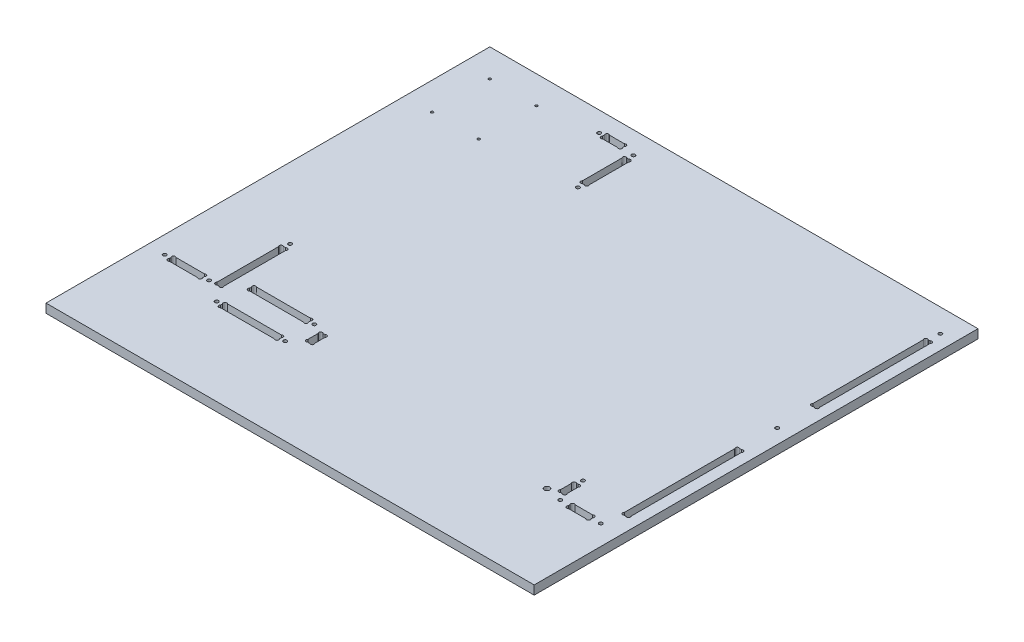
ISO-10303-21;
HEADER;
FILE_DESCRIPTION(('STEP AP214'),'2;1');
FILE_NAME('part.step','',(''),(''),'','','');
FILE_SCHEMA(('AUTOMOTIVE_DESIGN { 1 0 10303 214 1 1 1 1 }'));
ENDSEC;
DATA;
#1=APPLICATION_CONTEXT('core data for automotive mechanical design processes');
#2=APPLICATION_PROTOCOL_DEFINITION('international standard','automotive_design',2000,#1);
#3=PRODUCT_CONTEXT('',#1,'mechanical');
#4=PRODUCT('Part','Part','',(#3));
#5=PRODUCT_RELATED_PRODUCT_CATEGORY('part','',(#4));
#6=PRODUCT_DEFINITION_FORMATION('','',#4);
#7=PRODUCT_DEFINITION_CONTEXT('part definition',#1,'design');
#8=PRODUCT_DEFINITION('design','',#6,#7);
#9=PRODUCT_DEFINITION_SHAPE('','',#8);
#10=(LENGTH_UNIT() NAMED_UNIT(*) SI_UNIT(.MILLI.,.METRE.));
#11=(NAMED_UNIT(*) PLANE_ANGLE_UNIT() SI_UNIT($,.RADIAN.));
#12=(NAMED_UNIT(*) SI_UNIT($,.STERADIAN.) SOLID_ANGLE_UNIT());
#13=UNCERTAINTY_MEASURE_WITH_UNIT(LENGTH_MEASURE(1.E-05),#10,'distance_accuracy_value','');
#14=(GEOMETRIC_REPRESENTATION_CONTEXT(3) GLOBAL_UNCERTAINTY_ASSIGNED_CONTEXT((#13)) GLOBAL_UNIT_ASSIGNED_CONTEXT((#10,
#11,#12)) REPRESENTATION_CONTEXT('',''));
#15=CARTESIAN_POINT('',(0.,0.,0.));
#16=DIRECTION('',(0.,0.,1.));
#17=DIRECTION('',(1.,0.,0.));
#18=AXIS2_PLACEMENT_3D('',#15,#16,#17);
#19=CARTESIAN_POINT('',(-4.99999999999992,8.,-400.));
#20=DIRECTION('',(0.,-1.,0.));
#21=DIRECTION('',(0.,0.,-1.));
#22=AXIS2_PLACEMENT_3D('',#19,#20,#21);
#23=PLANE('',#22);
#24=CARTESIAN_POINT('',(62.0000000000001,8.,-323.));
#25=DIRECTION('',(0.,1.,0.));
#26=DIRECTION('',(0.,0.,1.));
#27=AXIS2_PLACEMENT_3D('',#24,#25,#26);
#28=CIRCLE('',#27,1.09999999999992);
#29=CARTESIAN_POINT('',(62.0000000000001,8.,-321.9));
#30=VERTEX_POINT('',#29);
#31=EDGE_CURVE('E1846',#30,#30,#28,.T.);
#32=ORIENTED_EDGE('',*,*,#31,.F.);
#33=EDGE_LOOP('',(#32));
#34=FACE_BOUND('',#33,.T.);
#35=CARTESIAN_POINT('',(20.,8.,-375.));
#36=DIRECTION('',(0.,1.,0.));
#37=DIRECTION('',(0.,0.,1.));
#38=AXIS2_PLACEMENT_3D('',#35,#36,#37);
#39=CIRCLE('',#38,1.1);
#40=CARTESIAN_POINT('',(20.,8.,-373.9));
#41=VERTEX_POINT('',#40);
#42=EDGE_CURVE('E1858',#41,#41,#39,.T.);
#43=ORIENTED_EDGE('',*,*,#42,.F.);
#44=EDGE_LOOP('',(#43));
#45=FACE_BOUND('',#44,.T.);
#46=CARTESIAN_POINT('',(146.3686291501,8.,-100.068629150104));
#47=DIRECTION('',(0.,1.,0.));
#48=DIRECTION('',(0.,0.,-1.));
#49=AXIS2_PLACEMENT_3D('',#46,#47,#48);
#50=CIRCLE('',#49,1.59999999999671);
#51=CARTESIAN_POINT('',(147.499999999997,8.,-98.9372583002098));
#52=VERTEX_POINT('',#51);
#53=CARTESIAN_POINT('',(145.237258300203,8.,-101.2));
#54=VERTEX_POINT('',#53);
#55=EDGE_CURVE('E586',#52,#54,#50,.T.);
#56=ORIENTED_EDGE('',*,*,#55,.F.);
#57=DIRECTION('',(0.,0.,-1.));
#58=VECTOR('',#57,1.);
#59=CARTESIAN_POINT('',(147.499999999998,8.,-89.6627416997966));
#60=LINE('',#59,#58);
#61=CARTESIAN_POINT('',(147.499999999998,8.,-89.6627416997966));
#62=VERTEX_POINT('',#61);
#63=EDGE_CURVE('E621',#62,#52,#60,.T.);
#64=ORIENTED_EDGE('',*,*,#63,.F.);
#65=CARTESIAN_POINT('',(146.368629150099,8.,-88.5313708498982));
#66=DIRECTION('',(0.,1.,0.));
#67=DIRECTION('',(0.,0.,1.));
#68=AXIS2_PLACEMENT_3D('',#65,#66,#67);
#69=CIRCLE('',#68,1.60000000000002);
#70=CARTESIAN_POINT('',(145.237258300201,8.,-87.3999999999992));
#71=VERTEX_POINT('',#70);
#72=EDGE_CURVE('E619',#71,#62,#69,.T.);
#73=ORIENTED_EDGE('',*,*,#72,.F.);
#74=DIRECTION('',(1.,0.,4.64107741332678E-13));
#75=VECTOR('',#74,1.);
#76=CARTESIAN_POINT('',(143.562741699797,8.,-87.4));
#77=LINE('',#76,#75);
#78=CARTESIAN_POINT('',(143.562741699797,8.,-87.3999999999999));
#79=VERTEX_POINT('',#78);
#80=EDGE_CURVE('E617',#79,#71,#77,.T.);
#81=ORIENTED_EDGE('',*,*,#80,.F.);
#82=CARTESIAN_POINT('',(142.431370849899,8.,-88.5313708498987));
#83=DIRECTION('',(0.,1.,0.));
#84=DIRECTION('',(0.,0.,-1.));
#85=AXIS2_PLACEMENT_3D('',#82,#83,#84);
#86=CIRCLE('',#85,1.60000000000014);
#87=CARTESIAN_POINT('',(141.3,8.,-89.6627416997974));
#88=VERTEX_POINT('',#87);
#89=EDGE_CURVE('E615',#88,#79,#86,.T.);
#90=ORIENTED_EDGE('',*,*,#89,.F.);
#91=DIRECTION('',(0.,0.,1.));
#92=VECTOR('',#91,1.);
#93=CARTESIAN_POINT('',(141.3,8.,-98.9372583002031));
#94=LINE('',#93,#92);
#95=CARTESIAN_POINT('',(141.3,8.,-98.9372583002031));
#96=VERTEX_POINT('',#95);
#97=EDGE_CURVE('E610',#96,#88,#94,.T.);
#98=ORIENTED_EDGE('',*,*,#97,.F.);
#99=CARTESIAN_POINT('',(142.431370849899,8.,-100.068629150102));
#100=DIRECTION('',(0.,1.,0.));
#101=DIRECTION('',(0.,0.,1.));
#102=AXIS2_PLACEMENT_3D('',#99,#100,#101);
#103=CIRCLE('',#102,1.60000000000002);
#104=CARTESIAN_POINT('',(143.562741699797,8.,-101.2));
#105=VERTEX_POINT('',#104);
#106=EDGE_CURVE('E608',#105,#96,#103,.T.);
#107=ORIENTED_EDGE('',*,*,#106,.F.);
#108=DIRECTION('',(-1.,0.,0.));
#109=VECTOR('',#108,1.);
#110=CARTESIAN_POINT('',(145.237258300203,8.,-101.2));
#111=LINE('',#110,#109);
#112=EDGE_CURVE('E594',#54,#105,#111,.T.);
#113=ORIENTED_EDGE('',*,*,#112,.F.);
#114=EDGE_LOOP('',(#56,#64,#73,#81,#90,#98,#107,#113));
#115=FACE_BOUND('',#114,.T.);
#116=CARTESIAN_POINT('',(132.5,8.,-78.1));
#117=DIRECTION('',(0.,1.,0.));
#118=DIRECTION('',(0.,0.,-1.));
#119=AXIS2_PLACEMENT_3D('',#116,#117,#118);
#120=CIRCLE('',#119,1.59999999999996);
#121=CARTESIAN_POINT('',(132.5,8.,-79.7));
#122=VERTEX_POINT('',#121);
#123=EDGE_CURVE('E713',#122,#122,#120,.T.);
#124=ORIENTED_EDGE('',*,*,#123,.F.);
#125=EDGE_LOOP('',(#124));
#126=FACE_BOUND('',#125,.T.);
#127=CARTESIAN_POINT('',(126.968629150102,8.,-106.268629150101));
#128=DIRECTION('',(0.,1.,0.));
#129=DIRECTION('',(0.,0.,1.));
#130=AXIS2_PLACEMENT_3D('',#127,#128,#129);
#131=CIRCLE('',#130,1.60000000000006);
#132=CARTESIAN_POINT('',(128.1,8.,-105.137258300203));
#133=VERTEX_POINT('',#132);
#134=CARTESIAN_POINT('',(125.837258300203,8.,-107.4));
#135=VERTEX_POINT('',#134);
#136=EDGE_CURVE('E725',#133,#135,#131,.T.);
#137=ORIENTED_EDGE('',*,*,#136,.F.);
#138=DIRECTION('',(0.,0.,-1.));
#139=VECTOR('',#138,1.);
#140=CARTESIAN_POINT('',(128.1,8.,-105.137258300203));
#141=LINE('',#140,#139);
#142=CARTESIAN_POINT('',(128.1,8.,-103.462741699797));
#143=VERTEX_POINT('',#142);
#144=EDGE_CURVE('E741',#143,#133,#141,.T.);
#145=ORIENTED_EDGE('',*,*,#144,.F.);
#146=CARTESIAN_POINT('',(126.968629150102,8.,-102.331370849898));
#147=DIRECTION('',(0.,1.,0.));
#148=DIRECTION('',(0.,0.,-1.));
#149=AXIS2_PLACEMENT_3D('',#146,#147,#148);
#150=CIRCLE('',#149,1.59999999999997);
#151=CARTESIAN_POINT('',(125.837258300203,8.,-101.2));
#152=VERTEX_POINT('',#151);
#153=EDGE_CURVE('E738',#152,#143,#150,.T.);
#154=ORIENTED_EDGE('',*,*,#153,.F.);
#155=DIRECTION('',(1.,0.,0.));
#156=VECTOR('',#155,1.);
#157=CARTESIAN_POINT('',(125.837258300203,8.,-101.2));
#158=LINE('',#157,#156);
#159=CARTESIAN_POINT('',(77.4127416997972,8.,-101.2));
#160=VERTEX_POINT('',#159);
#161=EDGE_CURVE('E736',#160,#152,#158,.T.);
#162=ORIENTED_EDGE('',*,*,#161,.F.);
#163=CARTESIAN_POINT('',(76.2813708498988,8.,-102.331370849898));
#164=DIRECTION('',(0.,1.,0.));
#165=DIRECTION('',(0.,0.,1.));
#166=AXIS2_PLACEMENT_3D('',#163,#164,#165);
#167=CIRCLE('',#166,1.59999999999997);
#168=CARTESIAN_POINT('',(75.1500000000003,8.,-103.462741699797));
#169=VERTEX_POINT('',#168);
#170=EDGE_CURVE('E734',#169,#160,#167,.T.);
#171=ORIENTED_EDGE('',*,*,#170,.F.);
#172=DIRECTION('',(0.,0.,1.));
#173=VECTOR('',#172,1.);
#174=CARTESIAN_POINT('',(75.1500000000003,8.,-103.462741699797));
#175=LINE('',#174,#173);
#176=CARTESIAN_POINT('',(75.1500000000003,8.,-105.137258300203));
#177=VERTEX_POINT('',#176);
#178=EDGE_CURVE('E732',#177,#169,#175,.T.);
#179=ORIENTED_EDGE('',*,*,#178,.F.);
#180=CARTESIAN_POINT('',(76.2813708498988,8.,-106.268629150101));
#181=DIRECTION('',(0.,1.,0.));
#182=DIRECTION('',(0.,0.,-1.));
#183=AXIS2_PLACEMENT_3D('',#180,#181,#182);
#184=CIRCLE('',#183,1.59999999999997);
#185=CARTESIAN_POINT('',(77.4127416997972,8.,-107.4));
#186=VERTEX_POINT('',#185);
#187=EDGE_CURVE('E730',#186,#177,#184,.T.);
#188=ORIENTED_EDGE('',*,*,#187,.F.);
#189=DIRECTION('',(-1.,0.,0.));
#190=VECTOR('',#189,1.);
#191=CARTESIAN_POINT('',(77.4127416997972,8.,-107.4));
#192=LINE('',#191,#190);
#193=EDGE_CURVE('E727',#135,#186,#192,.T.);
#194=ORIENTED_EDGE('',*,*,#193,.F.);
#195=EDGE_LOOP('',(#137,#145,#154,#162,#171,#179,#188,#194));
#196=FACE_BOUND('',#195,.T.);
#197=CARTESIAN_POINT('',(56.8813708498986,8.,-92.3313708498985));
#198=DIRECTION('',(0.,1.,0.));
#199=DIRECTION('',(0.,0.,-1.));
#200=AXIS2_PLACEMENT_3D('',#197,#198,#199);
#201=CIRCLE('',#200,1.60000000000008);
#202=CARTESIAN_POINT('',(55.7500000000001,8.,-93.4627416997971));
#203=VERTEX_POINT('',#202);
#204=CARTESIAN_POINT('',(58.0127416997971,8.,-91.1999999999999));
#205=VERTEX_POINT('',#204);
#206=EDGE_CURVE('E790',#203,#205,#201,.T.);
#207=ORIENTED_EDGE('',*,*,#206,.F.);
#208=DIRECTION('',(0.,0.,1.));
#209=VECTOR('',#208,1.);
#210=CARTESIAN_POINT('',(55.7500000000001,8.,-93.4627416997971));
#211=LINE('',#210,#209);
#212=CARTESIAN_POINT('',(55.7500000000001,8.,-148.937258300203));
#213=VERTEX_POINT('',#212);
#214=EDGE_CURVE('E806',#213,#203,#211,.T.);
#215=ORIENTED_EDGE('',*,*,#214,.F.);
#216=CARTESIAN_POINT('',(56.8813708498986,8.,-150.068629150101));
#217=DIRECTION('',(0.,1.,0.));
#218=DIRECTION('',(0.,0.,1.));
#219=AXIS2_PLACEMENT_3D('',#216,#217,#218);
#220=CIRCLE('',#219,1.60000000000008);
#221=CARTESIAN_POINT('',(58.0127416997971,8.,-151.2));
#222=VERTEX_POINT('',#221);
#223=EDGE_CURVE('E803',#222,#213,#220,.T.);
#224=ORIENTED_EDGE('',*,*,#223,.F.);
#225=DIRECTION('',(-1.,0.,0.));
#226=VECTOR('',#225,1.);
#227=CARTESIAN_POINT('',(59.687258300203,8.,-151.2));
#228=LINE('',#227,#226);
#229=CARTESIAN_POINT('',(59.687258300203,8.,-151.2));
#230=VERTEX_POINT('',#229);
#231=EDGE_CURVE('E801',#230,#222,#228,.T.);
#232=ORIENTED_EDGE('',*,*,#231,.F.);
#233=CARTESIAN_POINT('',(60.8186291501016,8.,-150.068629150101));
#234=DIRECTION('',(0.,1.,0.));
#235=DIRECTION('',(0.,0.,-1.));
#236=AXIS2_PLACEMENT_3D('',#233,#234,#235);
#237=CIRCLE('',#236,1.60000000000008);
#238=CARTESIAN_POINT('',(61.9500000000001,8.,-148.937258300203));
#239=VERTEX_POINT('',#238);
#240=EDGE_CURVE('E799',#239,#230,#237,.T.);
#241=ORIENTED_EDGE('',*,*,#240,.F.);
#242=DIRECTION('',(0.,0.,-1.));
#243=VECTOR('',#242,1.);
#244=CARTESIAN_POINT('',(61.9500000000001,8.,-148.937258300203));
#245=LINE('',#244,#243);
#246=CARTESIAN_POINT('',(61.9500000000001,8.,-93.4627416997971));
#247=VERTEX_POINT('',#246);
#248=EDGE_CURVE('E797',#247,#239,#245,.T.);
#249=ORIENTED_EDGE('',*,*,#248,.F.);
#250=CARTESIAN_POINT('',(60.8186291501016,8.,-92.3313708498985));
#251=DIRECTION('',(0.,1.,0.));
#252=DIRECTION('',(0.,0.,1.));
#253=AXIS2_PLACEMENT_3D('',#250,#251,#252);
#254=CIRCLE('',#253,1.60000000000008);
#255=CARTESIAN_POINT('',(59.687258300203,8.,-91.1999999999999));
#256=VERTEX_POINT('',#255);
#257=EDGE_CURVE('E795',#256,#247,#254,.T.);
#258=ORIENTED_EDGE('',*,*,#257,.F.);
#259=DIRECTION('',(1.,0.,0.));
#260=VECTOR('',#259,1.);
#261=CARTESIAN_POINT('',(59.687258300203,8.,-91.1999999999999));
#262=LINE('',#261,#260);
#263=EDGE_CURVE('E792',#205,#256,#262,.T.);
#264=ORIENTED_EDGE('',*,*,#263,.F.);
#265=EDGE_LOOP('',(#207,#215,#224,#232,#241,#249,#258,#264));
#266=FACE_BOUND('',#265,.T.);
#267=CARTESIAN_POINT('',(50.7500000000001,8.,-91.2));
#268=DIRECTION('',(0.,1.,0.));
#269=DIRECTION('',(0.,0.,-1.));
#270=AXIS2_PLACEMENT_3D('',#267,#268,#269);
#271=CIRCLE('',#270,1.59999999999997);
#272=CARTESIAN_POINT('',(50.7500000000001,8.,-92.8));
#273=VERTEX_POINT('',#272);
#274=EDGE_CURVE('E855',#273,#273,#271,.T.);
#275=ORIENTED_EDGE('',*,*,#274,.F.);
#276=EDGE_LOOP('',(#275));
#277=FACE_BOUND('',#276,.T.);
#278=CARTESIAN_POINT('',(10.75,8.,-91.2));
#279=DIRECTION('',(0.,1.,0.));
#280=DIRECTION('',(0.,0.,1.));
#281=AXIS2_PLACEMENT_3D('',#278,#279,#280);
#282=CIRCLE('',#281,1.59999999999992);
#283=CARTESIAN_POINT('',(10.75,8.,-89.6000000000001));
#284=VERTEX_POINT('',#283);
#285=EDGE_CURVE('E920',#284,#284,#282,.T.);
#286=ORIENTED_EDGE('',*,*,#285,.F.);
#287=EDGE_LOOP('',(#286));
#288=FACE_BOUND('',#287,.T.);
#289=CARTESIAN_POINT('',(144.4,8.,-330.));
#290=DIRECTION('',(0.,1.,0.));
#291=DIRECTION('',(0.,0.,1.));
#292=AXIS2_PLACEMENT_3D('',#289,#290,#291);
#293=CIRCLE('',#292,1.59999999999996);
#294=CARTESIAN_POINT('',(144.4,8.,-328.4));
#295=VERTEX_POINT('',#294);
#296=EDGE_CURVE('E932',#295,#295,#293,.T.);
#297=ORIENTED_EDGE('',*,*,#296,.F.);
#298=EDGE_LOOP('',(#297));
#299=FACE_BOUND('',#298,.T.);
#300=CARTESIAN_POINT('',(111.5,8.,-382.));
#301=DIRECTION('',(0.,1.,0.));
#302=DIRECTION('',(0.,0.,-1.));
#303=AXIS2_PLACEMENT_3D('',#300,#301,#302);
#304=CIRCLE('',#303,1.59999999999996);
#305=CARTESIAN_POINT('',(111.5,8.,-383.6));
#306=VERTEX_POINT('',#305);
#307=EDGE_CURVE('E997',#306,#306,#304,.T.);
#308=ORIENTED_EDGE('',*,*,#307,.F.);
#309=EDGE_LOOP('',(#308));
#310=FACE_BOUND('',#309,.T.);
#311=CARTESIAN_POINT('',(377.368629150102,8.,-97.2686291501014));
#312=DIRECTION('',(0.,1.,0.));
#313=DIRECTION('',(0.,0.,1.));
#314=AXIS2_PLACEMENT_3D('',#311,#312,#313);
#315=CIRCLE('',#314,1.59999999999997);
#316=CARTESIAN_POINT('',(378.5,8.,-96.137258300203));
#317=VERTEX_POINT('',#316);
#318=CARTESIAN_POINT('',(376.237258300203,8.,-98.3999999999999));
#319=VERTEX_POINT('',#318);
#320=EDGE_CURVE('E1062',#317,#319,#315,.T.);
#321=ORIENTED_EDGE('',*,*,#320,.F.);
#322=DIRECTION('',(0.,0.,-1.));
#323=VECTOR('',#322,1.);
#324=CARTESIAN_POINT('',(378.5,8.,-86.2627416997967));
#325=LINE('',#324,#323);
#326=CARTESIAN_POINT('',(378.5,8.,-86.2627416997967));
#327=VERTEX_POINT('',#326);
#328=EDGE_CURVE('E1078',#327,#317,#325,.T.);
#329=ORIENTED_EDGE('',*,*,#328,.F.);
#330=CARTESIAN_POINT('',(377.368629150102,8.,-85.1313708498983));
#331=DIRECTION('',(0.,1.,0.));
#332=DIRECTION('',(0.,0.,-1.));
#333=AXIS2_PLACEMENT_3D('',#330,#331,#332);
#334=CIRCLE('',#333,1.59999999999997);
#335=CARTESIAN_POINT('',(376.237258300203,8.,-83.9999999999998));
#336=VERTEX_POINT('',#335);
#337=EDGE_CURVE('E1075',#336,#327,#334,.T.);
#338=ORIENTED_EDGE('',*,*,#337,.F.);
#339=DIRECTION('',(1.,0.,0.));
#340=VECTOR('',#339,1.);
#341=CARTESIAN_POINT('',(374.762741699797,8.,-83.9999999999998));
#342=LINE('',#341,#340);
#343=CARTESIAN_POINT('',(374.762741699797,8.,-83.9999999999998));
#344=VERTEX_POINT('',#343);
#345=EDGE_CURVE('E1073',#344,#336,#342,.T.);
#346=ORIENTED_EDGE('',*,*,#345,.F.);
#347=CARTESIAN_POINT('',(373.631370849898,8.,-85.1313708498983));
#348=DIRECTION('',(0.,1.,0.));
#349=DIRECTION('',(0.,0.,1.));
#350=AXIS2_PLACEMENT_3D('',#347,#348,#349);
#351=CIRCLE('',#350,1.59999999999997);
#352=CARTESIAN_POINT('',(372.5,8.,-86.2627416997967));
#353=VERTEX_POINT('',#352);
#354=EDGE_CURVE('E1071',#353,#344,#351,.T.);
#355=ORIENTED_EDGE('',*,*,#354,.F.);
#356=DIRECTION('',(0.,0.,1.));
#357=VECTOR('',#356,1.);
#358=CARTESIAN_POINT('',(372.5,8.,-96.137258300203));
#359=LINE('',#358,#357);
#360=CARTESIAN_POINT('',(372.5,8.,-96.137258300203));
#361=VERTEX_POINT('',#360);
#362=EDGE_CURVE('E1069',#361,#353,#359,.T.);
#363=ORIENTED_EDGE('',*,*,#362,.F.);
#364=CARTESIAN_POINT('',(373.631370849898,8.,-97.2686291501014));
#365=DIRECTION('',(0.,1.,0.));
#366=DIRECTION('',(0.,0.,-1.));
#367=AXIS2_PLACEMENT_3D('',#364,#365,#366);
#368=CIRCLE('',#367,1.59999999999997);
#369=CARTESIAN_POINT('',(374.762741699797,8.,-98.3999999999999));
#370=VERTEX_POINT('',#369);
#371=EDGE_CURVE('E1067',#370,#361,#368,.T.);
#372=ORIENTED_EDGE('',*,*,#371,.F.);
#373=DIRECTION('',(-1.,0.,0.));
#374=VECTOR('',#373,1.);
#375=CARTESIAN_POINT('',(376.237258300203,8.,-98.3999999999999));
#376=LINE('',#375,#374);
#377=EDGE_CURVE('E1064',#319,#370,#376,.T.);
#378=ORIENTED_EDGE('',*,*,#377,.F.);
#379=EDGE_LOOP('',(#321,#329,#338,#346,#355,#363,#372,#378));
#380=FACE_BOUND('',#379,.T.);
#381=CARTESIAN_POINT('',(422.,8.,-232.));
#382=DIRECTION('',(0.,1.,0.));
#383=DIRECTION('',(0.,0.,1.));
#384=AXIS2_PLACEMENT_3D('',#381,#382,#383);
#385=CIRCLE('',#384,1.59999999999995);
#386=CARTESIAN_POINT('',(422.,8.,-230.4));
#387=VERTEX_POINT('',#386);
#388=EDGE_CURVE('E1180',#387,#387,#385,.T.);
#389=ORIENTED_EDGE('',*,*,#388,.F.);
#390=EDGE_LOOP('',(#389));
#391=FACE_BOUND('',#390,.T.);
#392=CARTESIAN_POINT('',(422.,8.,-379.));
#393=DIRECTION('',(0.,1.,0.));
#394=DIRECTION('',(0.,0.,1.));
#395=AXIS2_PLACEMENT_3D('',#392,#393,#394);
#396=CIRCLE('',#395,1.59999999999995);
#397=CARTESIAN_POINT('',(422.,8.,-377.4));
#398=VERTEX_POINT('',#397);
#399=EDGE_CURVE('E1245',#398,#398,#396,.T.);
#400=ORIENTED_EDGE('',*,*,#399,.F.);
#401=EDGE_LOOP('',(#400));
#402=FACE_BOUND('',#401,.T.);
#403=CARTESIAN_POINT('',(375.5,8.,-103.4));
#404=DIRECTION('',(0.,1.,0.));
#405=DIRECTION('',(0.,0.,1.));
#406=AXIS2_PLACEMENT_3D('',#403,#404,#405);
#407=CIRCLE('',#406,1.59999999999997);
#408=CARTESIAN_POINT('',(375.5,8.,-101.8));
#409=VERTEX_POINT('',#408);
#410=EDGE_CURVE('E1257',#409,#409,#407,.T.);
#411=ORIENTED_EDGE('',*,*,#410,.F.);
#412=EDGE_LOOP('',(#411));
#413=FACE_BOUND('',#412,.T.);
#414=CARTESIAN_POINT('',(417.,8.,-78.));
#415=DIRECTION('',(0.,1.,0.));
#416=DIRECTION('',(0.,0.,-1.));
#417=AXIS2_PLACEMENT_3D('',#414,#415,#416);
#418=CIRCLE('',#417,1.59999999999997);
#419=CARTESIAN_POINT('',(417.,8.,-79.6));
#420=VERTEX_POINT('',#419);
#421=EDGE_CURVE('E1322',#420,#420,#418,.T.);
#422=ORIENTED_EDGE('',*,*,#421,.F.);
#423=EDGE_LOOP('',(#422));
#424=FACE_BOUND('',#423,.T.);
#425=DIRECTION('',(0.,0.,1.));
#426=VECTOR('',#425,1.);
#427=CARTESIAN_POINT('',(-4.99999999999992,8.,0.));
#428=LINE('',#427,#426);
#429=CARTESIAN_POINT('',(-4.99999999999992,8.,-400.));
#430=VERTEX_POINT('',#429);
#431=CARTESIAN_POINT('',(-4.99999999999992,8.,0.));
#432=VERTEX_POINT('',#431);
#433=EDGE_CURVE('E1328',#430,#432,#428,.T.);
#434=ORIENTED_EDGE('',*,*,#433,.T.);
#435=DIRECTION('',(1.,0.,0.));
#436=VECTOR('',#435,1.);
#437=CARTESIAN_POINT('',(-4.99999999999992,8.,0.));
#438=LINE('',#437,#436);
#439=CARTESIAN_POINT('',(435.,8.,0.));
#440=VERTEX_POINT('',#439);
#441=EDGE_CURVE('E1331',#432,#440,#438,.T.);
#442=ORIENTED_EDGE('',*,*,#441,.T.);
#443=DIRECTION('',(0.,0.,-1.));
#444=VECTOR('',#443,1.);
#445=CARTESIAN_POINT('',(435.,8.,0.));
#446=LINE('',#445,#444);
#447=CARTESIAN_POINT('',(435.,8.,-400.));
#448=VERTEX_POINT('',#447);
#449=EDGE_CURVE('E1334',#440,#448,#446,.T.);
#450=ORIENTED_EDGE('',*,*,#449,.T.);
#451=DIRECTION('',(-1.,0.,0.));
#452=VECTOR('',#451,1.);
#453=CARTESIAN_POINT('',(-4.99999999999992,8.,-400.));
#454=LINE('',#453,#452);
#455=EDGE_CURVE('E1336',#448,#430,#454,.T.);
#456=ORIENTED_EDGE('',*,*,#455,.T.);
#457=EDGE_LOOP('',(#434,#442,#450,#456));
#458=FACE_BOUND('',#457,.T.);
#459=CARTESIAN_POINT('',(407.868629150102,8.,-79.8686291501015));
#460=DIRECTION('',(0.,1.,0.));
#461=DIRECTION('',(0.,0.,1.));
#462=AXIS2_PLACEMENT_3D('',#459,#460,#461);
#463=CIRCLE('',#462,1.59999999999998);
#464=CARTESIAN_POINT('',(409.,8.,-78.7372583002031));
#465=VERTEX_POINT('',#464);
#466=CARTESIAN_POINT('',(406.737258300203,8.,-81.));
#467=VERTEX_POINT('',#466);
#468=EDGE_CURVE('E1263',#465,#467,#463,.T.);
#469=ORIENTED_EDGE('',*,*,#468,.F.);
#470=DIRECTION('',(0.,0.,-1.));
#471=VECTOR('',#470,1.);
#472=CARTESIAN_POINT('',(409.,8.,-78.7372583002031));
#473=LINE('',#472,#471);
#474=CARTESIAN_POINT('',(409.,8.,-77.2627416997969));
#475=VERTEX_POINT('',#474);
#476=EDGE_CURVE('E1279',#475,#465,#473,.T.);
#477=ORIENTED_EDGE('',*,*,#476,.F.);
#478=CARTESIAN_POINT('',(407.868629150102,8.,-76.1313708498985));
#479=DIRECTION('',(0.,1.,0.));
#480=DIRECTION('',(0.,0.,-1.));
#481=AXIS2_PLACEMENT_3D('',#478,#479,#480);
#482=CIRCLE('',#481,1.59999999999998);
#483=CARTESIAN_POINT('',(406.737258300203,8.,-75.));
#484=VERTEX_POINT('',#483);
#485=EDGE_CURVE('E1276',#484,#475,#482,.T.);
#486=ORIENTED_EDGE('',*,*,#485,.F.);
#487=DIRECTION('',(1.,0.,0.));
#488=VECTOR('',#487,1.);
#489=CARTESIAN_POINT('',(390.762741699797,8.,-75.));
#490=LINE('',#489,#488);
#491=CARTESIAN_POINT('',(390.762741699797,8.,-75.));
#492=VERTEX_POINT('',#491);
#493=EDGE_CURVE('E1274',#492,#484,#490,.T.);
#494=ORIENTED_EDGE('',*,*,#493,.F.);
#495=CARTESIAN_POINT('',(389.631370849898,8.,-76.1313708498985));
#496=DIRECTION('',(0.,1.,0.));
#497=DIRECTION('',(0.,0.,1.));
#498=AXIS2_PLACEMENT_3D('',#495,#496,#497);
#499=CIRCLE('',#498,1.59999999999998);
#500=CARTESIAN_POINT('',(388.5,8.,-77.2627416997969));
#501=VERTEX_POINT('',#500);
#502=EDGE_CURVE('E1272',#501,#492,#499,.T.);
#503=ORIENTED_EDGE('',*,*,#502,.F.);
#504=DIRECTION('',(0.,0.,1.));
#505=VECTOR('',#504,1.);
#506=CARTESIAN_POINT('',(388.5,8.,-78.7372583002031));
#507=LINE('',#506,#505);
#508=CARTESIAN_POINT('',(388.5,8.,-78.7372583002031));
#509=VERTEX_POINT('',#508);
#510=EDGE_CURVE('E1270',#509,#501,#507,.T.);
#511=ORIENTED_EDGE('',*,*,#510,.F.);
#512=CARTESIAN_POINT('',(389.631370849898,8.,-79.8686291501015));
#513=DIRECTION('',(0.,1.,0.));
#514=DIRECTION('',(0.,0.,-1.));
#515=AXIS2_PLACEMENT_3D('',#512,#513,#514);
#516=CIRCLE('',#515,1.59999999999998);
#517=CARTESIAN_POINT('',(390.762741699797,8.,-81.));
#518=VERTEX_POINT('',#517);
#519=EDGE_CURVE('E1268',#518,#509,#516,.T.);
#520=ORIENTED_EDGE('',*,*,#519,.F.);
#521=DIRECTION('',(-1.,0.,0.));
#522=VECTOR('',#521,1.);
#523=CARTESIAN_POINT('',(406.737258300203,8.,-81.));
#524=LINE('',#523,#522);
#525=EDGE_CURVE('E1265',#467,#518,#524,.T.);
#526=ORIENTED_EDGE('',*,*,#525,.F.);
#527=EDGE_LOOP('',(#469,#477,#486,#494,#503,#511,#520,#526));
#528=FACE_BOUND('',#527,.T.);
#529=CARTESIAN_POINT('',(380.5,8.,-78.));
#530=DIRECTION('',(0.,1.,0.));
#531=DIRECTION('',(0.,0.,1.));
#532=AXIS2_PLACEMENT_3D('',#529,#530,#531);
#533=CIRCLE('',#532,1.59999999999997);
#534=CARTESIAN_POINT('',(380.5,8.,-76.4));
#535=VERTEX_POINT('',#534);
#536=EDGE_CURVE('E1251',#535,#535,#533,.T.);
#537=ORIENTED_EDGE('',*,*,#536,.F.);
#538=EDGE_LOOP('',(#537));
#539=FACE_BOUND('',#538,.T.);
#540=CARTESIAN_POINT('',(420.131370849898,8.,-367.868629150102));
#541=DIRECTION('',(0.,1.,0.));
#542=DIRECTION('',(0.,0.,1.));
#543=AXIS2_PLACEMENT_3D('',#540,#541,#542);
#544=CIRCLE('',#543,1.59999999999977);
#545=CARTESIAN_POINT('',(421.262741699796,8.,-369.));
#546=VERTEX_POINT('',#545);
#547=CARTESIAN_POINT('',(419.,8.,-366.737258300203));
#548=VERTEX_POINT('',#547);
#549=EDGE_CURVE('E1186',#546,#548,#544,.T.);
#550=ORIENTED_EDGE('',*,*,#549,.F.);
#551=DIRECTION('',(-1.,0.,0.));
#552=VECTOR('',#551,1.);
#553=CARTESIAN_POINT('',(421.262741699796,8.,-369.));
#554=LINE('',#553,#552);
#555=CARTESIAN_POINT('',(422.737258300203,8.,-369.));
#556=VERTEX_POINT('',#555);
#557=EDGE_CURVE('E1202',#556,#546,#554,.T.);
#558=ORIENTED_EDGE('',*,*,#557,.F.);
#559=CARTESIAN_POINT('',(423.868629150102,8.,-367.868629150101));
#560=DIRECTION('',(0.,1.,0.));
#561=DIRECTION('',(0.,0.,-1.));
#562=AXIS2_PLACEMENT_3D('',#559,#560,#561);
#563=CIRCLE('',#562,1.60000000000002);
#564=CARTESIAN_POINT('',(425.,8.,-366.737258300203));
#565=VERTEX_POINT('',#564);
#566=EDGE_CURVE('E1199',#565,#556,#563,.T.);
#567=ORIENTED_EDGE('',*,*,#566,.F.);
#568=DIRECTION('',(0.,0.,-1.));
#569=VECTOR('',#568,1.);
#570=CARTESIAN_POINT('',(425.,8.,-267.262741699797));
#571=LINE('',#570,#569);
#572=CARTESIAN_POINT('',(425.,8.,-267.262741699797));
#573=VERTEX_POINT('',#572);
#574=EDGE_CURVE('E1197',#573,#565,#571,.T.);
#575=ORIENTED_EDGE('',*,*,#574,.F.);
#576=CARTESIAN_POINT('',(423.868629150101,8.,-266.131370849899));
#577=DIRECTION('',(0.,1.,0.));
#578=DIRECTION('',(0.,0.,1.));
#579=AXIS2_PLACEMENT_3D('',#576,#577,#578);
#580=CIRCLE('',#579,1.60000000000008);
#581=CARTESIAN_POINT('',(422.737258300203,8.,-265.));
#582=VERTEX_POINT('',#581);
#583=EDGE_CURVE('E1195',#582,#573,#580,.T.);
#584=ORIENTED_EDGE('',*,*,#583,.F.);
#585=DIRECTION('',(1.,0.,0.));
#586=VECTOR('',#585,1.);
#587=CARTESIAN_POINT('',(421.262741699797,8.,-265.));
#588=LINE('',#587,#586);
#589=CARTESIAN_POINT('',(421.262741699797,8.,-265.));
#590=VERTEX_POINT('',#589);
#591=EDGE_CURVE('E1193',#590,#582,#588,.T.);
#592=ORIENTED_EDGE('',*,*,#591,.F.);
#593=CARTESIAN_POINT('',(420.131370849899,8.,-266.131370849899));
#594=DIRECTION('',(0.,1.,0.));
#595=DIRECTION('',(0.,0.,-1.));
#596=AXIS2_PLACEMENT_3D('',#593,#594,#595);
#597=CIRCLE('',#596,1.60000000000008);
#598=CARTESIAN_POINT('',(419.,8.,-267.262741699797));
#599=VERTEX_POINT('',#598);
#600=EDGE_CURVE('E1191',#599,#590,#597,.T.);
#601=ORIENTED_EDGE('',*,*,#600,.F.);
#602=DIRECTION('',(0.,0.,1.));
#603=VECTOR('',#602,1.);
#604=CARTESIAN_POINT('',(419.,8.,-366.737258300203));
#605=LINE('',#604,#603);
#606=EDGE_CURVE('E1188',#548,#599,#605,.T.);
#607=ORIENTED_EDGE('',*,*,#606,.F.);
#608=EDGE_LOOP('',(#550,#558,#567,#575,#584,#592,#601,#607));
#609=FACE_BOUND('',#608,.T.);
#610=CARTESIAN_POINT('',(420.131370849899,8.,-197.868629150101));
#611=DIRECTION('',(0.,1.,0.));
#612=DIRECTION('',(0.,0.,1.));
#613=AXIS2_PLACEMENT_3D('',#610,#611,#612);
#614=CIRCLE('',#613,1.60000000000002);
#615=CARTESIAN_POINT('',(421.262741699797,8.,-199.));
#616=VERTEX_POINT('',#615);
#617=CARTESIAN_POINT('',(419.,8.,-196.737258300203));
#618=VERTEX_POINT('',#617);
#619=EDGE_CURVE('E1121',#616,#618,#614,.T.);
#620=ORIENTED_EDGE('',*,*,#619,.F.);
#621=DIRECTION('',(-1.,0.,0.));
#622=VECTOR('',#621,1.);
#623=CARTESIAN_POINT('',(421.262741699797,8.,-199.));
#624=LINE('',#623,#622);
#625=CARTESIAN_POINT('',(422.737258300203,8.,-199.));
#626=VERTEX_POINT('',#625);
#627=EDGE_CURVE('E1137',#626,#616,#624,.T.);
#628=ORIENTED_EDGE('',*,*,#627,.F.);
#629=CARTESIAN_POINT('',(423.868629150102,8.,-197.868629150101));
#630=DIRECTION('',(0.,1.,0.));
#631=DIRECTION('',(0.,0.,-1.));
#632=AXIS2_PLACEMENT_3D('',#629,#630,#631);
#633=CIRCLE('',#632,1.60000000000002);
#634=CARTESIAN_POINT('',(425.,8.,-196.737258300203));
#635=VERTEX_POINT('',#634);
#636=EDGE_CURVE('E1134',#635,#626,#633,.T.);
#637=ORIENTED_EDGE('',*,*,#636,.F.);
#638=DIRECTION('',(0.,0.,-1.));
#639=VECTOR('',#638,1.);
#640=CARTESIAN_POINT('',(425.,8.,-196.737258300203));
#641=LINE('',#640,#639);
#642=CARTESIAN_POINT('',(425.,8.,-97.2627416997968));
#643=VERTEX_POINT('',#642);
#644=EDGE_CURVE('E1132',#643,#635,#641,.T.);
#645=ORIENTED_EDGE('',*,*,#644,.F.);
#646=CARTESIAN_POINT('',(423.868629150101,8.,-96.1313708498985));
#647=DIRECTION('',(0.,1.,0.));
#648=DIRECTION('',(0.,0.,1.));
#649=AXIS2_PLACEMENT_3D('',#646,#647,#648);
#650=CIRCLE('',#649,1.60000000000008);
#651=CARTESIAN_POINT('',(422.737258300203,8.,-95.));
#652=VERTEX_POINT('',#651);
#653=EDGE_CURVE('E1130',#652,#643,#650,.T.);
#654=ORIENTED_EDGE('',*,*,#653,.F.);
#655=DIRECTION('',(1.,0.,0.));
#656=VECTOR('',#655,1.);
#657=CARTESIAN_POINT('',(421.262741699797,8.,-95.));
#658=LINE('',#657,#656);
#659=CARTESIAN_POINT('',(421.262741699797,8.,-95.));
#660=VERTEX_POINT('',#659);
#661=EDGE_CURVE('E1128',#660,#652,#658,.T.);
#662=ORIENTED_EDGE('',*,*,#661,.F.);
#663=CARTESIAN_POINT('',(420.131370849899,8.,-96.1313708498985));
#664=DIRECTION('',(0.,1.,0.));
#665=DIRECTION('',(0.,0.,-1.));
#666=AXIS2_PLACEMENT_3D('',#663,#664,#665);
#667=CIRCLE('',#666,1.60000000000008);
#668=CARTESIAN_POINT('',(419.,8.,-97.2627416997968));
#669=VERTEX_POINT('',#668);
#670=EDGE_CURVE('E1126',#669,#660,#667,.T.);
#671=ORIENTED_EDGE('',*,*,#670,.F.);
#672=DIRECTION('',(0.,0.,1.));
#673=VECTOR('',#672,1.);
#674=CARTESIAN_POINT('',(419.,8.,-97.2627416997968));
#675=LINE('',#674,#673);
#676=EDGE_CURVE('E1123',#618,#669,#675,.T.);
#677=ORIENTED_EDGE('',*,*,#676,.F.);
#678=EDGE_LOOP('',(#620,#628,#637,#645,#654,#662,#671,#677));
#679=FACE_BOUND('',#678,.T.);
#680=CARTESIAN_POINT('',(116.631370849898,8.,-380.131370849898));
#681=DIRECTION('',(0.,1.,0.));
#682=DIRECTION('',(0.,0.,1.));
#683=AXIS2_PLACEMENT_3D('',#680,#681,#682);
#684=CIRCLE('',#683,1.59999999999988);
#685=CARTESIAN_POINT('',(115.5,8.,-381.262741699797));
#686=VERTEX_POINT('',#685);
#687=CARTESIAN_POINT('',(117.762741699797,8.,-379.));
#688=VERTEX_POINT('',#687);
#689=EDGE_CURVE('E1003',#686,#688,#684,.T.);
#690=ORIENTED_EDGE('',*,*,#689,.F.);
#691=DIRECTION('',(0.,0.,1.));
#692=VECTOR('',#691,1.);
#693=CARTESIAN_POINT('',(115.5,8.,-381.262741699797));
#694=LINE('',#693,#692);
#695=CARTESIAN_POINT('',(115.5,8.,-382.737258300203));
#696=VERTEX_POINT('',#695);
#697=EDGE_CURVE('E1019',#696,#686,#694,.T.);
#698=ORIENTED_EDGE('',*,*,#697,.F.);
#699=CARTESIAN_POINT('',(116.631370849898,8.,-383.868629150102));
#700=DIRECTION('',(0.,1.,0.));
#701=DIRECTION('',(0.,0.,-1.));
#702=AXIS2_PLACEMENT_3D('',#699,#700,#701);
#703=CIRCLE('',#702,1.59999999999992);
#704=CARTESIAN_POINT('',(117.762741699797,8.,-385.));
#705=VERTEX_POINT('',#704);
#706=EDGE_CURVE('E1016',#705,#696,#703,.T.);
#707=ORIENTED_EDGE('',*,*,#706,.F.);
#708=DIRECTION('',(-1.,0.,0.));
#709=VECTOR('',#708,1.);
#710=CARTESIAN_POINT('',(117.762741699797,8.,-385.));
#711=LINE('',#710,#709);
#712=CARTESIAN_POINT('',(131.237258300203,8.,-385.));
#713=VERTEX_POINT('',#712);
#714=EDGE_CURVE('E1014',#713,#705,#711,.T.);
#715=ORIENTED_EDGE('',*,*,#714,.F.);
#716=CARTESIAN_POINT('',(132.368629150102,8.,-383.868629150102));
#717=DIRECTION('',(0.,1.,0.));
#718=DIRECTION('',(0.,0.,1.));
#719=AXIS2_PLACEMENT_3D('',#716,#717,#718);
#720=CIRCLE('',#719,1.59999999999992);
#721=CARTESIAN_POINT('',(133.5,8.,-382.737258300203));
#722=VERTEX_POINT('',#721);
#723=EDGE_CURVE('E1012',#722,#713,#720,.T.);
#724=ORIENTED_EDGE('',*,*,#723,.F.);
#725=DIRECTION('',(0.,0.,-1.));
#726=VECTOR('',#725,1.);
#727=CARTESIAN_POINT('',(133.5,8.,-382.737258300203));
#728=LINE('',#727,#726);
#729=CARTESIAN_POINT('',(133.5,8.,-381.262741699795));
#730=VERTEX_POINT('',#729);
#731=EDGE_CURVE('E1010',#730,#722,#728,.T.);
#732=ORIENTED_EDGE('',*,*,#731,.F.);
#733=CARTESIAN_POINT('',(132.368629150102,8.,-380.131370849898));
#734=DIRECTION('',(0.,1.,0.));
#735=DIRECTION('',(0.,0.,-1.));
#736=AXIS2_PLACEMENT_3D('',#733,#734,#735);
#737=CIRCLE('',#736,1.59999999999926);
#738=CARTESIAN_POINT('',(131.237258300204,8.,-379.));
#739=VERTEX_POINT('',#738);
#740=EDGE_CURVE('E1008',#739,#730,#737,.T.);
#741=ORIENTED_EDGE('',*,*,#740,.F.);
#742=DIRECTION('',(1.,0.,0.));
#743=VECTOR('',#742,1.);
#744=CARTESIAN_POINT('',(131.237258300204,8.,-379.));
#745=LINE('',#744,#743);
#746=EDGE_CURVE('E1005',#688,#739,#745,.T.);
#747=ORIENTED_EDGE('',*,*,#746,.F.);
#748=EDGE_LOOP('',(#690,#698,#707,#715,#724,#732,#741,#747));
#749=FACE_BOUND('',#748,.T.);
#750=CARTESIAN_POINT('',(142.431370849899,8.,-336.131370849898));
#751=DIRECTION('',(0.,1.,0.));
#752=DIRECTION('',(0.,0.,-1.));
#753=AXIS2_PLACEMENT_3D('',#750,#751,#752);
#754=CIRCLE('',#753,1.59999999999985);
#755=CARTESIAN_POINT('',(141.3,8.,-337.262741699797));
#756=VERTEX_POINT('',#755);
#757=CARTESIAN_POINT('',(143.562741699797,8.,-335.));
#758=VERTEX_POINT('',#757);
#759=EDGE_CURVE('E938',#756,#758,#754,.T.);
#760=ORIENTED_EDGE('',*,*,#759,.F.);
#761=DIRECTION('',(0.,0.,1.));
#762=VECTOR('',#761,1.);
#763=CARTESIAN_POINT('',(141.3,8.,-372.737258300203));
#764=LINE('',#763,#762);
#765=CARTESIAN_POINT('',(141.3,8.,-372.737258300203));
#766=VERTEX_POINT('',#765);
#767=EDGE_CURVE('E954',#766,#756,#764,.T.);
#768=ORIENTED_EDGE('',*,*,#767,.F.);
#769=CARTESIAN_POINT('',(142.431370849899,8.,-373.868629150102));
#770=DIRECTION('',(0.,1.,0.));
#771=DIRECTION('',(0.,0.,1.));
#772=AXIS2_PLACEMENT_3D('',#769,#770,#771);
#773=CIRCLE('',#772,1.59999999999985);
#774=CARTESIAN_POINT('',(143.562741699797,8.,-375.));
#775=VERTEX_POINT('',#774);
#776=EDGE_CURVE('E951',#775,#766,#773,.T.);
#777=ORIENTED_EDGE('',*,*,#776,.F.);
#778=DIRECTION('',(-1.,0.,0.));
#779=VECTOR('',#778,1.);
#780=CARTESIAN_POINT('',(145.237258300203,8.,-375.));
#781=LINE('',#780,#779);
#782=CARTESIAN_POINT('',(145.237258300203,8.,-375.));
#783=VERTEX_POINT('',#782);
#784=EDGE_CURVE('E949',#783,#775,#781,.T.);
#785=ORIENTED_EDGE('',*,*,#784,.F.);
#786=CARTESIAN_POINT('',(146.368629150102,8.,-373.868629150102));
#787=DIRECTION('',(0.,1.,0.));
#788=DIRECTION('',(0.,0.,-1.));
#789=AXIS2_PLACEMENT_3D('',#786,#787,#788);
#790=CIRCLE('',#789,1.59999999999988);
#791=CARTESIAN_POINT('',(147.5,8.,-372.737258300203));
#792=VERTEX_POINT('',#791);
#793=EDGE_CURVE('E947',#792,#783,#790,.T.);
#794=ORIENTED_EDGE('',*,*,#793,.F.);
#795=DIRECTION('',(0.,0.,-1.));
#796=VECTOR('',#795,1.);
#797=CARTESIAN_POINT('',(147.5,8.,-337.262741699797));
#798=LINE('',#797,#796);
#799=CARTESIAN_POINT('',(147.5,8.,-337.262741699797));
#800=VERTEX_POINT('',#799);
#801=EDGE_CURVE('E945',#800,#792,#798,.T.);
#802=ORIENTED_EDGE('',*,*,#801,.F.);
#803=CARTESIAN_POINT('',(146.368629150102,8.,-336.131370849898));
#804=DIRECTION('',(0.,1.,0.));
#805=DIRECTION('',(0.,0.,1.));
#806=AXIS2_PLACEMENT_3D('',#803,#804,#805);
#807=CIRCLE('',#806,1.59999999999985);
#808=CARTESIAN_POINT('',(145.237258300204,8.,-335.));
#809=VERTEX_POINT('',#808);
#810=EDGE_CURVE('E943',#809,#800,#807,.T.);
#811=ORIENTED_EDGE('',*,*,#810,.F.);
#812=DIRECTION('',(1.,0.,0.));
#813=VECTOR('',#812,1.);
#814=CARTESIAN_POINT('',(143.562741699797,8.,-335.));
#815=LINE('',#814,#813);
#816=EDGE_CURVE('E940',#758,#809,#815,.T.);
#817=ORIENTED_EDGE('',*,*,#816,.F.);
#818=EDGE_LOOP('',(#760,#768,#777,#785,#794,#802,#811,#817));
#819=FACE_BOUND('',#818,.T.);
#820=CARTESIAN_POINT('',(144.4,8.,-380.));
#821=DIRECTION('',(0.,1.,0.));
#822=DIRECTION('',(0.,0.,-1.));
#823=AXIS2_PLACEMENT_3D('',#820,#821,#822);
#824=CIRCLE('',#823,1.59999999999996);
#825=CARTESIAN_POINT('',(144.4,8.,-381.6));
#826=VERTEX_POINT('',#825);
#827=EDGE_CURVE('E926',#826,#826,#824,.T.);
#828=ORIENTED_EDGE('',*,*,#827,.F.);
#829=EDGE_LOOP('',(#828));
#830=FACE_BOUND('',#829,.T.);
#831=CARTESIAN_POINT('',(16.8813708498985,8.,-89.3313708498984));
#832=DIRECTION('',(0.,1.,0.));
#833=DIRECTION('',(0.,0.,1.));
#834=AXIS2_PLACEMENT_3D('',#831,#832,#833);
#835=CIRCLE('',#834,1.59999999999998);
#836=CARTESIAN_POINT('',(15.7499999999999,8.,-90.4627416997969));
#837=VERTEX_POINT('',#836);
#838=CARTESIAN_POINT('',(18.0127416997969,8.,-88.2));
#839=VERTEX_POINT('',#838);
#840=EDGE_CURVE('E861',#837,#839,#835,.T.);
#841=ORIENTED_EDGE('',*,*,#840,.F.);
#842=DIRECTION('',(0.,0.,1.));
#843=VECTOR('',#842,1.);
#844=CARTESIAN_POINT('',(15.7499999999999,8.,-91.9372583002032));
#845=LINE('',#844,#843);
#846=CARTESIAN_POINT('',(15.7499999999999,8.,-91.9372583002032));
#847=VERTEX_POINT('',#846);
#848=EDGE_CURVE('E877',#847,#837,#845,.T.);
#849=ORIENTED_EDGE('',*,*,#848,.F.);
#850=CARTESIAN_POINT('',(16.8813708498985,8.,-93.0686291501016));
#851=DIRECTION('',(0.,1.,0.));
#852=DIRECTION('',(0.,0.,-1.));
#853=AXIS2_PLACEMENT_3D('',#850,#851,#852);
#854=CIRCLE('',#853,1.59999999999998);
#855=CARTESIAN_POINT('',(18.0127416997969,8.,-94.2000000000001));
#856=VERTEX_POINT('',#855);
#857=EDGE_CURVE('E874',#856,#847,#854,.T.);
#858=ORIENTED_EDGE('',*,*,#857,.F.);
#859=DIRECTION('',(-1.,0.,0.));
#860=VECTOR('',#859,1.);
#861=CARTESIAN_POINT('',(43.4872583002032,8.,-94.2));
#862=LINE('',#861,#860);
#863=CARTESIAN_POINT('',(43.4872583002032,8.,-94.2));
#864=VERTEX_POINT('',#863);
#865=EDGE_CURVE('E872',#864,#856,#862,.T.);
#866=ORIENTED_EDGE('',*,*,#865,.F.);
#867=CARTESIAN_POINT('',(44.6186291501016,8.,-93.0686291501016));
#868=DIRECTION('',(0.,1.,0.));
#869=DIRECTION('',(0.,0.,1.));
#870=AXIS2_PLACEMENT_3D('',#867,#868,#869);
#871=CIRCLE('',#870,1.59999999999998);
#872=CARTESIAN_POINT('',(45.7500000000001,8.,-91.9372583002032));
#873=VERTEX_POINT('',#872);
#874=EDGE_CURVE('E870',#873,#864,#871,.T.);
#875=ORIENTED_EDGE('',*,*,#874,.F.);
#876=DIRECTION('',(0.,0.,-1.));
#877=VECTOR('',#876,1.);
#878=CARTESIAN_POINT('',(45.7500000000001,8.,-90.4627416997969));
#879=LINE('',#878,#877);
#880=CARTESIAN_POINT('',(45.7500000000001,8.,-90.4627416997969));
#881=VERTEX_POINT('',#880);
#882=EDGE_CURVE('E868',#881,#873,#879,.T.);
#883=ORIENTED_EDGE('',*,*,#882,.F.);
#884=CARTESIAN_POINT('',(44.6186291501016,8.,-89.3313708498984));
#885=DIRECTION('',(0.,1.,0.));
#886=DIRECTION('',(0.,0.,-1.));
#887=AXIS2_PLACEMENT_3D('',#884,#885,#886);
#888=CIRCLE('',#887,1.59999999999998);
#889=CARTESIAN_POINT('',(43.4872583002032,8.,-88.2));
#890=VERTEX_POINT('',#889);
#891=EDGE_CURVE('E866',#890,#881,#888,.T.);
#892=ORIENTED_EDGE('',*,*,#891,.F.);
#893=DIRECTION('',(1.,0.,0.));
#894=VECTOR('',#893,1.);
#895=CARTESIAN_POINT('',(18.0127416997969,8.,-88.2));
#896=LINE('',#895,#894);
#897=EDGE_CURVE('E863',#839,#890,#896,.T.);
#898=ORIENTED_EDGE('',*,*,#897,.F.);
#899=EDGE_LOOP('',(#841,#849,#858,#866,#875,#883,#892,#898));
#900=FACE_BOUND('',#899,.T.);
#901=CARTESIAN_POINT('',(58.8500000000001,8.,-156.2));
#902=DIRECTION('',(0.,1.,0.));
#903=DIRECTION('',(0.,0.,-1.));
#904=AXIS2_PLACEMENT_3D('',#901,#902,#903);
#905=CIRCLE('',#904,1.59999999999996);
#906=CARTESIAN_POINT('',(58.8500000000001,8.,-157.8));
#907=VERTEX_POINT('',#906);
#908=EDGE_CURVE('E849',#907,#907,#905,.T.);
#909=ORIENTED_EDGE('',*,*,#908,.F.);
#910=EDGE_LOOP('',(#909));
#911=FACE_BOUND('',#910,.T.);
#912=CARTESIAN_POINT('',(132.5,8.,-104.3));
#913=DIRECTION('',(0.,1.,0.));
#914=DIRECTION('',(0.,0.,1.));
#915=AXIS2_PLACEMENT_3D('',#912,#913,#914);
#916=CIRCLE('',#915,1.59999999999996);
#917=CARTESIAN_POINT('',(132.5,8.,-102.7));
#918=VERTEX_POINT('',#917);
#919=EDGE_CURVE('E784',#918,#918,#916,.T.);
#920=ORIENTED_EDGE('',*,*,#919,.F.);
#921=EDGE_LOOP('',(#920));
#922=FACE_BOUND('',#921,.T.);
#923=CARTESIAN_POINT('',(70.7500000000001,8.,-78.1));
#924=DIRECTION('',(0.,1.,0.));
#925=DIRECTION('',(0.,0.,1.));
#926=AXIS2_PLACEMENT_3D('',#923,#924,#925);
#927=CIRCLE('',#926,1.59999999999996);
#928=CARTESIAN_POINT('',(70.7500000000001,8.,-76.5000000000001));
#929=VERTEX_POINT('',#928);
#930=EDGE_CURVE('E719',#929,#929,#927,.T.);
#931=ORIENTED_EDGE('',*,*,#930,.F.);
#932=EDGE_LOOP('',(#931));
#933=FACE_BOUND('',#932,.T.);
#934=CARTESIAN_POINT('',(76.2813708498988,8.,-76.1313708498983));
#935=DIRECTION('',(0.,1.,0.));
#936=DIRECTION('',(0.,0.,1.));
#937=AXIS2_PLACEMENT_3D('',#934,#935,#936);
#938=CIRCLE('',#937,1.59999999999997);
#939=CARTESIAN_POINT('',(75.1500000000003,8.,-77.2627416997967));
#940=VERTEX_POINT('',#939);
#941=CARTESIAN_POINT('',(77.4127416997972,8.,-74.9999999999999));
#942=VERTEX_POINT('',#941);
#943=EDGE_CURVE('E654',#940,#942,#938,.T.);
#944=ORIENTED_EDGE('',*,*,#943,.F.);
#945=DIRECTION('',(0.,0.,1.));
#946=VECTOR('',#945,1.);
#947=CARTESIAN_POINT('',(75.1500000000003,8.,-78.937258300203));
#948=LINE('',#947,#946);
#949=CARTESIAN_POINT('',(75.1500000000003,8.,-78.9372583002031));
#950=VERTEX_POINT('',#949);
#951=EDGE_CURVE('E670',#950,#940,#948,.T.);
#952=ORIENTED_EDGE('',*,*,#951,.F.);
#953=CARTESIAN_POINT('',(76.2813708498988,8.,-80.0686291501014));
#954=DIRECTION('',(0.,1.,0.));
#955=DIRECTION('',(0.,0.,-1.));
#956=AXIS2_PLACEMENT_3D('',#953,#954,#955);
#957=CIRCLE('',#956,1.59999999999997);
#958=CARTESIAN_POINT('',(77.4127416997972,8.,-81.1999999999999));
#959=VERTEX_POINT('',#958);
#960=EDGE_CURVE('E667',#959,#950,#957,.T.);
#961=ORIENTED_EDGE('',*,*,#960,.F.);
#962=DIRECTION('',(-1.,0.,0.));
#963=VECTOR('',#962,1.);
#964=CARTESIAN_POINT('',(125.837258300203,8.,-81.1999999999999));
#965=LINE('',#964,#963);
#966=CARTESIAN_POINT('',(125.837258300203,8.,-81.1999999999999));
#967=VERTEX_POINT('',#966);
#968=EDGE_CURVE('E665',#967,#959,#965,.T.);
#969=ORIENTED_EDGE('',*,*,#968,.F.);
#970=CARTESIAN_POINT('',(126.968629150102,8.,-80.0686291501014));
#971=DIRECTION('',(0.,1.,0.));
#972=DIRECTION('',(0.,0.,1.));
#973=AXIS2_PLACEMENT_3D('',#970,#971,#972);
#974=CIRCLE('',#973,1.59999999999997);
#975=CARTESIAN_POINT('',(128.1,8.,-78.937258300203));
#976=VERTEX_POINT('',#975);
#977=EDGE_CURVE('E663',#976,#967,#974,.T.);
#978=ORIENTED_EDGE('',*,*,#977,.F.);
#979=DIRECTION('',(0.,0.,-1.));
#980=VECTOR('',#979,1.);
#981=CARTESIAN_POINT('',(128.1,8.,-77.2627416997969));
#982=LINE('',#981,#980);
#983=CARTESIAN_POINT('',(128.1,8.,-77.2627416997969));
#984=VERTEX_POINT('',#983);
#985=EDGE_CURVE('E661',#984,#976,#982,.T.);
#986=ORIENTED_EDGE('',*,*,#985,.F.);
#987=CARTESIAN_POINT('',(126.968629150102,8.,-76.1313708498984));
#988=DIRECTION('',(0.,1.,0.));
#989=DIRECTION('',(0.,0.,-1.));
#990=AXIS2_PLACEMENT_3D('',#987,#988,#989);
#991=CIRCLE('',#990,1.60000000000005);
#992=CARTESIAN_POINT('',(125.837258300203,8.,-74.9999999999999));
#993=VERTEX_POINT('',#992);
#994=EDGE_CURVE('E659',#993,#984,#991,.T.);
#995=ORIENTED_EDGE('',*,*,#994,.F.);
#996=DIRECTION('',(1.,0.,0.));
#997=VECTOR('',#996,1.);
#998=CARTESIAN_POINT('',(77.4127416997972,8.,-74.9999999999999));
#999=LINE('',#998,#997);
#1000=EDGE_CURVE('E656',#942,#993,#999,.T.);
#1001=ORIENTED_EDGE('',*,*,#1000,.F.);
#1002=EDGE_LOOP('',(#944,#952,#961,#969,#978,#986,#995,#1001));
#1003=FACE_BOUND('',#1002,.T.);
#1004=CARTESIAN_POINT('',(365.5,8.,-81.));
#1005=DIRECTION('',(0.,1.,0.));
#1006=DIRECTION('',(0.,0.,1.));
#1007=AXIS2_PLACEMENT_3D('',#1004,#1005,#1006);
#1008=CIRCLE('',#1007,2.45);
#1009=CARTESIAN_POINT('',(365.5,8.,-78.55));
#1010=VERTEX_POINT('',#1009);
#1011=EDGE_CURVE('E624',#1010,#1010,#1008,.T.);
#1012=ORIENTED_EDGE('',*,*,#1011,.F.);
#1013=EDGE_LOOP('',(#1012));
#1014=FACE_BOUND('',#1013,.T.);
#1015=CARTESIAN_POINT('',(62.,8.,-375.));
#1016=DIRECTION('',(0.,1.,0.));
#1017=DIRECTION('',(0.,0.,1.));
#1018=AXIS2_PLACEMENT_3D('',#1015,#1016,#1017);
#1019=CIRCLE('',#1018,1.1);
#1020=CARTESIAN_POINT('',(62.,8.,-373.9));
#1021=VERTEX_POINT('',#1020);
#1022=EDGE_CURVE('E1852',#1021,#1021,#1019,.T.);
#1023=ORIENTED_EDGE('',*,*,#1022,.F.);
#1024=EDGE_LOOP('',(#1023));
#1025=FACE_BOUND('',#1024,.T.);
#1026=CARTESIAN_POINT('',(20.0000000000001,8.,-323.));
#1027=DIRECTION('',(0.,1.,0.));
#1028=DIRECTION('',(0.,0.,1.));
#1029=AXIS2_PLACEMENT_3D('',#1026,#1027,#1028);
#1030=CIRCLE('',#1029,1.09999999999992);
#1031=CARTESIAN_POINT('',(20.0000000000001,8.,-321.9));
#1032=VERTEX_POINT('',#1031);
#1033=EDGE_CURVE('E1837',#1032,#1032,#1030,.T.);
#1034=ORIENTED_EDGE('',*,*,#1033,.F.);
#1035=EDGE_LOOP('',(#1034));
#1036=FACE_BOUND('',#1035,.T.);
#1037=ADVANCED_FACE('F17',(#34,#45,#115,#126,#196,#266,#277,#288,#299,#310,#380,#391,#402,#413,
#424,#458,#528,#539,#609,#679,#749,#819,#830,#900,#911,#922,#933,#1003,#1014,#1025,#1036),#23,.F.);
#1038=CARTESIAN_POINT('',(-4.99999999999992,0.,-400.));
#1039=DIRECTION('',(0.,-1.,0.));
#1040=DIRECTION('',(0.,0.,-1.));
#1041=AXIS2_PLACEMENT_3D('',#1038,#1039,#1040);
#1042=PLANE('',#1041);
#1043=CARTESIAN_POINT('',(62.0000000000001,0.,-323.));
#1044=DIRECTION('',(0.,1.,0.));
#1045=DIRECTION('',(0.,0.,1.));
#1046=AXIS2_PLACEMENT_3D('',#1043,#1044,#1045);
#1047=CIRCLE('',#1046,1.09999999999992);
#1048=CARTESIAN_POINT('',(62.0000000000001,0.,-321.9));
#1049=VERTEX_POINT('',#1048);
#1050=EDGE_CURVE('E1843',#1049,#1049,#1047,.T.);
#1051=ORIENTED_EDGE('',*,*,#1050,.T.);
#1052=EDGE_LOOP('',(#1051));
#1053=FACE_BOUND('',#1052,.T.);
#1054=CARTESIAN_POINT('',(20.,0.,-375.));
#1055=DIRECTION('',(0.,1.,0.));
#1056=DIRECTION('',(0.,0.,1.));
#1057=AXIS2_PLACEMENT_3D('',#1054,#1055,#1056);
#1058=CIRCLE('',#1057,1.1);
#1059=CARTESIAN_POINT('',(20.,0.,-373.9));
#1060=VERTEX_POINT('',#1059);
#1061=EDGE_CURVE('E1855',#1060,#1060,#1058,.T.);
#1062=ORIENTED_EDGE('',*,*,#1061,.T.);
#1063=EDGE_LOOP('',(#1062));
#1064=FACE_BOUND('',#1063,.T.);
#1065=DIRECTION('',(0.,0.,-1.));
#1066=VECTOR('',#1065,1.);
#1067=CARTESIAN_POINT('',(147.499999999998,0.,-89.6627416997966));
#1068=LINE('',#1067,#1066);
#1069=CARTESIAN_POINT('',(147.499999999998,0.,-89.6627416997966));
#1070=VERTEX_POINT('',#1069);
#1071=CARTESIAN_POINT('',(147.499999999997,0.,-98.9372583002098));
#1072=VERTEX_POINT('',#1071);
#1073=EDGE_CURVE('E595',#1070,#1072,#1068,.T.);
#1074=ORIENTED_EDGE('',*,*,#1073,.T.);
#1075=CARTESIAN_POINT('',(146.3686291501,0.,-100.068629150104));
#1076=DIRECTION('',(0.,1.,0.));
#1077=DIRECTION('',(0.,0.,-1.));
#1078=AXIS2_PLACEMENT_3D('',#1075,#1076,#1077);
#1079=CIRCLE('',#1078,1.59999999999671);
#1080=CARTESIAN_POINT('',(145.237258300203,0.,-101.2));
#1081=VERTEX_POINT('',#1080);
#1082=EDGE_CURVE('E40',#1072,#1081,#1079,.T.);
#1083=ORIENTED_EDGE('',*,*,#1082,.T.);
#1084=DIRECTION('',(-1.,0.,0.));
#1085=VECTOR('',#1084,1.);
#1086=CARTESIAN_POINT('',(145.237258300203,0.,-101.2));
#1087=LINE('',#1086,#1085);
#1088=CARTESIAN_POINT('',(143.562741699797,0.,-101.2));
#1089=VERTEX_POINT('',#1088);
#1090=EDGE_CURVE('E601',#1081,#1089,#1087,.T.);
#1091=ORIENTED_EDGE('',*,*,#1090,.T.);
#1092=CARTESIAN_POINT('',(142.431370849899,0.,-100.068629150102));
#1093=DIRECTION('',(0.,1.,0.));
#1094=DIRECTION('',(0.,0.,1.));
#1095=AXIS2_PLACEMENT_3D('',#1092,#1093,#1094);
#1096=CIRCLE('',#1095,1.60000000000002);
#1097=CARTESIAN_POINT('',(141.3,0.,-98.9372583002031));
#1098=VERTEX_POINT('',#1097);
#1099=EDGE_CURVE('E626',#1089,#1098,#1096,.T.);
#1100=ORIENTED_EDGE('',*,*,#1099,.T.);
#1101=DIRECTION('',(0.,0.,1.));
#1102=VECTOR('',#1101,1.);
#1103=CARTESIAN_POINT('',(141.3,0.,-98.9372583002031));
#1104=LINE('',#1103,#1102);
#1105=CARTESIAN_POINT('',(141.3,0.,-89.6627416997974));
#1106=VERTEX_POINT('',#1105);
#1107=EDGE_CURVE('E629',#1098,#1106,#1104,.T.);
#1108=ORIENTED_EDGE('',*,*,#1107,.T.);
#1109=CARTESIAN_POINT('',(142.431370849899,0.,-88.5313708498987));
#1110=DIRECTION('',(0.,1.,0.));
#1111=DIRECTION('',(0.,0.,-1.));
#1112=AXIS2_PLACEMENT_3D('',#1109,#1110,#1111);
#1113=CIRCLE('',#1112,1.60000000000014);
#1114=CARTESIAN_POINT('',(143.562741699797,0.,-87.3999999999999));
#1115=VERTEX_POINT('',#1114);
#1116=EDGE_CURVE('E632',#1106,#1115,#1113,.T.);
#1117=ORIENTED_EDGE('',*,*,#1116,.T.);
#1118=DIRECTION('',(1.,0.,4.64107741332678E-13));
#1119=VECTOR('',#1118,1.);
#1120=CARTESIAN_POINT('',(143.562741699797,0.,-87.4));
#1121=LINE('',#1120,#1119);
#1122=CARTESIAN_POINT('',(145.237258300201,0.,-87.3999999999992));
#1123=VERTEX_POINT('',#1122);
#1124=EDGE_CURVE('E635',#1115,#1123,#1121,.T.);
#1125=ORIENTED_EDGE('',*,*,#1124,.T.);
#1126=CARTESIAN_POINT('',(146.368629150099,0.,-88.5313708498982));
#1127=DIRECTION('',(0.,1.,0.));
#1128=DIRECTION('',(0.,0.,1.));
#1129=AXIS2_PLACEMENT_3D('',#1126,#1127,#1128);
#1130=CIRCLE('',#1129,1.60000000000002);
#1131=EDGE_CURVE('E638',#1123,#1070,#1130,.T.);
#1132=ORIENTED_EDGE('',*,*,#1131,.T.);
#1133=EDGE_LOOP('',(#1074,#1083,#1091,#1100,#1108,#1117,#1125,#1132));
#1134=FACE_BOUND('',#1133,.T.);
#1135=CARTESIAN_POINT('',(132.5,0.,-78.1));
#1136=DIRECTION('',(0.,1.,0.));
#1137=DIRECTION('',(0.,0.,-1.));
#1138=AXIS2_PLACEMENT_3D('',#1135,#1136,#1137);
#1139=CIRCLE('',#1138,1.59999999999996);
#1140=CARTESIAN_POINT('',(132.5,0.,-79.7));
#1141=VERTEX_POINT('',#1140);
#1142=EDGE_CURVE('E712',#1141,#1141,#1139,.T.);
#1143=ORIENTED_EDGE('',*,*,#1142,.T.);
#1144=EDGE_LOOP('',(#1143));
#1145=FACE_BOUND('',#1144,.T.);
#1146=DIRECTION('',(0.,0.,-1.));
#1147=VECTOR('',#1146,1.);
#1148=CARTESIAN_POINT('',(128.1,0.,-105.137258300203));
#1149=LINE('',#1148,#1147);
#1150=CARTESIAN_POINT('',(128.1,0.,-103.462741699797));
#1151=VERTEX_POINT('',#1150);
#1152=CARTESIAN_POINT('',(128.1,0.,-105.137258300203));
#1153=VERTEX_POINT('',#1152);
#1154=EDGE_CURVE('E728',#1151,#1153,#1149,.T.);
#1155=ORIENTED_EDGE('',*,*,#1154,.T.);
#1156=CARTESIAN_POINT('',(126.968629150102,0.,-106.268629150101));
#1157=DIRECTION('',(0.,1.,0.));
#1158=DIRECTION('',(0.,0.,1.));
#1159=AXIS2_PLACEMENT_3D('',#1156,#1157,#1158);
#1160=CIRCLE('',#1159,1.60000000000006);
#1161=CARTESIAN_POINT('',(125.837258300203,0.,-107.4));
#1162=VERTEX_POINT('',#1161);
#1163=EDGE_CURVE('E722',#1153,#1162,#1160,.T.);
#1164=ORIENTED_EDGE('',*,*,#1163,.T.);
#1165=DIRECTION('',(-1.,0.,0.));
#1166=VECTOR('',#1165,1.);
#1167=CARTESIAN_POINT('',(77.4127416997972,0.,-107.4));
#1168=LINE('',#1167,#1166);
#1169=CARTESIAN_POINT('',(77.4127416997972,0.,-107.4));
#1170=VERTEX_POINT('',#1169);
#1171=EDGE_CURVE('E746',#1162,#1170,#1168,.T.);
#1172=ORIENTED_EDGE('',*,*,#1171,.T.);
#1173=CARTESIAN_POINT('',(76.2813708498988,0.,-106.268629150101));
#1174=DIRECTION('',(0.,1.,0.));
#1175=DIRECTION('',(0.,0.,-1.));
#1176=AXIS2_PLACEMENT_3D('',#1173,#1174,#1175);
#1177=CIRCLE('',#1176,1.59999999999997);
#1178=CARTESIAN_POINT('',(75.1500000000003,0.,-105.137258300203));
#1179=VERTEX_POINT('',#1178);
#1180=EDGE_CURVE('E749',#1170,#1179,#1177,.T.);
#1181=ORIENTED_EDGE('',*,*,#1180,.T.);
#1182=DIRECTION('',(0.,0.,1.));
#1183=VECTOR('',#1182,1.);
#1184=CARTESIAN_POINT('',(75.1500000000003,0.,-103.462741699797));
#1185=LINE('',#1184,#1183);
#1186=CARTESIAN_POINT('',(75.1500000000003,0.,-103.462741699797));
#1187=VERTEX_POINT('',#1186);
#1188=EDGE_CURVE('E752',#1179,#1187,#1185,.T.);
#1189=ORIENTED_EDGE('',*,*,#1188,.T.);
#1190=CARTESIAN_POINT('',(76.2813708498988,0.,-102.331370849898));
#1191=DIRECTION('',(0.,1.,0.));
#1192=DIRECTION('',(0.,0.,1.));
#1193=AXIS2_PLACEMENT_3D('',#1190,#1191,#1192);
#1194=CIRCLE('',#1193,1.59999999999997);
#1195=CARTESIAN_POINT('',(77.4127416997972,0.,-101.2));
#1196=VERTEX_POINT('',#1195);
#1197=EDGE_CURVE('E755',#1187,#1196,#1194,.T.);
#1198=ORIENTED_EDGE('',*,*,#1197,.T.);
#1199=DIRECTION('',(1.,0.,0.));
#1200=VECTOR('',#1199,1.);
#1201=CARTESIAN_POINT('',(125.837258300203,0.,-101.2));
#1202=LINE('',#1201,#1200);
#1203=CARTESIAN_POINT('',(125.837258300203,0.,-101.2));
#1204=VERTEX_POINT('',#1203);
#1205=EDGE_CURVE('E758',#1196,#1204,#1202,.T.);
#1206=ORIENTED_EDGE('',*,*,#1205,.T.);
#1207=CARTESIAN_POINT('',(126.968629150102,0.,-102.331370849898));
#1208=DIRECTION('',(0.,1.,0.));
#1209=DIRECTION('',(0.,0.,-1.));
#1210=AXIS2_PLACEMENT_3D('',#1207,#1208,#1209);
#1211=CIRCLE('',#1210,1.59999999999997);
#1212=EDGE_CURVE('E761',#1204,#1151,#1211,.T.);
#1213=ORIENTED_EDGE('',*,*,#1212,.T.);
#1214=EDGE_LOOP('',(#1155,#1164,#1172,#1181,#1189,#1198,#1206,#1213));
#1215=FACE_BOUND('',#1214,.T.);
#1216=DIRECTION('',(0.,0.,1.));
#1217=VECTOR('',#1216,1.);
#1218=CARTESIAN_POINT('',(55.7500000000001,0.,-93.4627416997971));
#1219=LINE('',#1218,#1217);
#1220=CARTESIAN_POINT('',(55.7500000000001,0.,-148.937258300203));
#1221=VERTEX_POINT('',#1220);
#1222=CARTESIAN_POINT('',(55.7500000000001,0.,-93.462741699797));
#1223=VERTEX_POINT('',#1222);
#1224=EDGE_CURVE('E793',#1221,#1223,#1219,.T.);
#1225=ORIENTED_EDGE('',*,*,#1224,.T.);
#1226=CARTESIAN_POINT('',(56.8813708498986,0.,-92.3313708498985));
#1227=DIRECTION('',(0.,1.,0.));
#1228=DIRECTION('',(0.,0.,-1.));
#1229=AXIS2_PLACEMENT_3D('',#1226,#1227,#1228);
#1230=CIRCLE('',#1229,1.60000000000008);
#1231=CARTESIAN_POINT('',(58.0127416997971,0.,-91.1999999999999));
#1232=VERTEX_POINT('',#1231);
#1233=EDGE_CURVE('E787',#1223,#1232,#1230,.T.);
#1234=ORIENTED_EDGE('',*,*,#1233,.T.);
#1235=DIRECTION('',(1.,0.,0.));
#1236=VECTOR('',#1235,1.);
#1237=CARTESIAN_POINT('',(59.687258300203,0.,-91.1999999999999));
#1238=LINE('',#1237,#1236);
#1239=CARTESIAN_POINT('',(59.687258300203,0.,-91.1999999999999));
#1240=VERTEX_POINT('',#1239);
#1241=EDGE_CURVE('E811',#1232,#1240,#1238,.T.);
#1242=ORIENTED_EDGE('',*,*,#1241,.T.);
#1243=CARTESIAN_POINT('',(60.8186291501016,0.,-92.3313708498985));
#1244=DIRECTION('',(0.,1.,0.));
#1245=DIRECTION('',(0.,0.,1.));
#1246=AXIS2_PLACEMENT_3D('',#1243,#1244,#1245);
#1247=CIRCLE('',#1246,1.60000000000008);
#1248=CARTESIAN_POINT('',(61.9500000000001,0.,-93.4627416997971));
#1249=VERTEX_POINT('',#1248);
#1250=EDGE_CURVE('E814',#1240,#1249,#1247,.T.);
#1251=ORIENTED_EDGE('',*,*,#1250,.T.);
#1252=DIRECTION('',(0.,0.,-1.));
#1253=VECTOR('',#1252,1.);
#1254=CARTESIAN_POINT('',(61.9500000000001,0.,-148.937258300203));
#1255=LINE('',#1254,#1253);
#1256=CARTESIAN_POINT('',(61.9500000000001,0.,-148.937258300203));
#1257=VERTEX_POINT('',#1256);
#1258=EDGE_CURVE('E817',#1249,#1257,#1255,.T.);
#1259=ORIENTED_EDGE('',*,*,#1258,.T.);
#1260=CARTESIAN_POINT('',(60.8186291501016,0.,-150.068629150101));
#1261=DIRECTION('',(0.,1.,0.));
#1262=DIRECTION('',(0.,0.,-1.));
#1263=AXIS2_PLACEMENT_3D('',#1260,#1261,#1262);
#1264=CIRCLE('',#1263,1.60000000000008);
#1265=CARTESIAN_POINT('',(59.687258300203,0.,-151.2));
#1266=VERTEX_POINT('',#1265);
#1267=EDGE_CURVE('E820',#1257,#1266,#1264,.T.);
#1268=ORIENTED_EDGE('',*,*,#1267,.T.);
#1269=DIRECTION('',(-1.,0.,0.));
#1270=VECTOR('',#1269,1.);
#1271=CARTESIAN_POINT('',(59.687258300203,0.,-151.2));
#1272=LINE('',#1271,#1270);
#1273=CARTESIAN_POINT('',(58.0127416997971,0.,-151.2));
#1274=VERTEX_POINT('',#1273);
#1275=EDGE_CURVE('E823',#1266,#1274,#1272,.T.);
#1276=ORIENTED_EDGE('',*,*,#1275,.T.);
#1277=CARTESIAN_POINT('',(56.8813708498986,0.,-150.068629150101));
#1278=DIRECTION('',(0.,1.,0.));
#1279=DIRECTION('',(0.,0.,1.));
#1280=AXIS2_PLACEMENT_3D('',#1277,#1278,#1279);
#1281=CIRCLE('',#1280,1.60000000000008);
#1282=EDGE_CURVE('E826',#1274,#1221,#1281,.T.);
#1283=ORIENTED_EDGE('',*,*,#1282,.T.);
#1284=EDGE_LOOP('',(#1225,#1234,#1242,#1251,#1259,#1268,#1276,#1283));
#1285=FACE_BOUND('',#1284,.T.);
#1286=CARTESIAN_POINT('',(50.7500000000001,0.,-91.2));
#1287=DIRECTION('',(0.,1.,0.));
#1288=DIRECTION('',(0.,0.,-1.));
#1289=AXIS2_PLACEMENT_3D('',#1286,#1287,#1288);
#1290=CIRCLE('',#1289,1.59999999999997);
#1291=CARTESIAN_POINT('',(50.7500000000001,0.,-92.8));
#1292=VERTEX_POINT('',#1291);
#1293=EDGE_CURVE('E852',#1292,#1292,#1290,.T.);
#1294=ORIENTED_EDGE('',*,*,#1293,.T.);
#1295=EDGE_LOOP('',(#1294));
#1296=FACE_BOUND('',#1295,.T.);
#1297=CARTESIAN_POINT('',(10.75,0.,-91.2));
#1298=DIRECTION('',(0.,1.,0.));
#1299=DIRECTION('',(0.,0.,1.));
#1300=AXIS2_PLACEMENT_3D('',#1297,#1298,#1299);
#1301=CIRCLE('',#1300,1.59999999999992);
#1302=CARTESIAN_POINT('',(10.75,0.,-89.6000000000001));
#1303=VERTEX_POINT('',#1302);
#1304=EDGE_CURVE('E919',#1303,#1303,#1301,.T.);
#1305=ORIENTED_EDGE('',*,*,#1304,.T.);
#1306=EDGE_LOOP('',(#1305));
#1307=FACE_BOUND('',#1306,.T.);
#1308=CARTESIAN_POINT('',(144.4,0.,-330.));
#1309=DIRECTION('',(0.,1.,0.));
#1310=DIRECTION('',(0.,0.,1.));
#1311=AXIS2_PLACEMENT_3D('',#1308,#1309,#1310);
#1312=CIRCLE('',#1311,1.59999999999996);
#1313=CARTESIAN_POINT('',(144.4,0.,-328.4));
#1314=VERTEX_POINT('',#1313);
#1315=EDGE_CURVE('E929',#1314,#1314,#1312,.T.);
#1316=ORIENTED_EDGE('',*,*,#1315,.T.);
#1317=EDGE_LOOP('',(#1316));
#1318=FACE_BOUND('',#1317,.T.);
#1319=CARTESIAN_POINT('',(111.5,0.,-382.));
#1320=DIRECTION('',(0.,1.,0.));
#1321=DIRECTION('',(0.,0.,-1.));
#1322=AXIS2_PLACEMENT_3D('',#1319,#1320,#1321);
#1323=CIRCLE('',#1322,1.59999999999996);
#1324=CARTESIAN_POINT('',(111.5,0.,-383.6));
#1325=VERTEX_POINT('',#1324);
#1326=EDGE_CURVE('E996',#1325,#1325,#1323,.T.);
#1327=ORIENTED_EDGE('',*,*,#1326,.T.);
#1328=EDGE_LOOP('',(#1327));
#1329=FACE_BOUND('',#1328,.T.);
#1330=DIRECTION('',(0.,0.,-1.));
#1331=VECTOR('',#1330,1.);
#1332=CARTESIAN_POINT('',(378.5,0.,-86.2627416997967));
#1333=LINE('',#1332,#1331);
#1334=CARTESIAN_POINT('',(378.5,0.,-86.2627416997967));
#1335=VERTEX_POINT('',#1334);
#1336=CARTESIAN_POINT('',(378.5,0.,-96.137258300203));
#1337=VERTEX_POINT('',#1336);
#1338=EDGE_CURVE('E1065',#1335,#1337,#1333,.T.);
#1339=ORIENTED_EDGE('',*,*,#1338,.T.);
#1340=CARTESIAN_POINT('',(377.368629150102,0.,-97.2686291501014));
#1341=DIRECTION('',(0.,1.,0.));
#1342=DIRECTION('',(0.,0.,1.));
#1343=AXIS2_PLACEMENT_3D('',#1340,#1341,#1342);
#1344=CIRCLE('',#1343,1.59999999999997);
#1345=CARTESIAN_POINT('',(376.237258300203,0.,-98.3999999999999));
#1346=VERTEX_POINT('',#1345);
#1347=EDGE_CURVE('E1061',#1337,#1346,#1344,.T.);
#1348=ORIENTED_EDGE('',*,*,#1347,.T.);
#1349=DIRECTION('',(-1.,0.,0.));
#1350=VECTOR('',#1349,1.);
#1351=CARTESIAN_POINT('',(376.237258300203,0.,-98.3999999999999));
#1352=LINE('',#1351,#1350);
#1353=CARTESIAN_POINT('',(374.762741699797,0.,-98.3999999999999));
#1354=VERTEX_POINT('',#1353);
#1355=EDGE_CURVE('E1083',#1346,#1354,#1352,.T.);
#1356=ORIENTED_EDGE('',*,*,#1355,.T.);
#1357=CARTESIAN_POINT('',(373.631370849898,0.,-97.2686291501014));
#1358=DIRECTION('',(0.,1.,0.));
#1359=DIRECTION('',(0.,0.,-1.));
#1360=AXIS2_PLACEMENT_3D('',#1357,#1358,#1359);
#1361=CIRCLE('',#1360,1.59999999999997);
#1362=CARTESIAN_POINT('',(372.5,0.,-96.137258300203));
#1363=VERTEX_POINT('',#1362);
#1364=EDGE_CURVE('E1086',#1354,#1363,#1361,.T.);
#1365=ORIENTED_EDGE('',*,*,#1364,.T.);
#1366=DIRECTION('',(0.,0.,1.));
#1367=VECTOR('',#1366,1.);
#1368=CARTESIAN_POINT('',(372.5,0.,-96.137258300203));
#1369=LINE('',#1368,#1367);
#1370=CARTESIAN_POINT('',(372.5,0.,-86.2627416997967));
#1371=VERTEX_POINT('',#1370);
#1372=EDGE_CURVE('E1089',#1363,#1371,#1369,.T.);
#1373=ORIENTED_EDGE('',*,*,#1372,.T.);
#1374=CARTESIAN_POINT('',(373.631370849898,0.,-85.1313708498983));
#1375=DIRECTION('',(0.,1.,0.));
#1376=DIRECTION('',(0.,0.,1.));
#1377=AXIS2_PLACEMENT_3D('',#1374,#1375,#1376);
#1378=CIRCLE('',#1377,1.59999999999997);
#1379=CARTESIAN_POINT('',(374.762741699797,0.,-83.9999999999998));
#1380=VERTEX_POINT('',#1379);
#1381=EDGE_CURVE('E1092',#1371,#1380,#1378,.T.);
#1382=ORIENTED_EDGE('',*,*,#1381,.T.);
#1383=DIRECTION('',(1.,0.,0.));
#1384=VECTOR('',#1383,1.);
#1385=CARTESIAN_POINT('',(374.762741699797,0.,-83.9999999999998));
#1386=LINE('',#1385,#1384);
#1387=CARTESIAN_POINT('',(376.237258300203,0.,-83.9999999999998));
#1388=VERTEX_POINT('',#1387);
#1389=EDGE_CURVE('E1095',#1380,#1388,#1386,.T.);
#1390=ORIENTED_EDGE('',*,*,#1389,.T.);
#1391=CARTESIAN_POINT('',(377.368629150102,0.,-85.1313708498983));
#1392=DIRECTION('',(0.,1.,0.));
#1393=DIRECTION('',(0.,0.,-1.));
#1394=AXIS2_PLACEMENT_3D('',#1391,#1392,#1393);
#1395=CIRCLE('',#1394,1.59999999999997);
#1396=EDGE_CURVE('E1098',#1388,#1335,#1395,.T.);
#1397=ORIENTED_EDGE('',*,*,#1396,.T.);
#1398=EDGE_LOOP('',(#1339,#1348,#1356,#1365,#1373,#1382,#1390,#1397));
#1399=FACE_BOUND('',#1398,.T.);
#1400=CARTESIAN_POINT('',(422.,0.,-232.));
#1401=DIRECTION('',(0.,1.,0.));
#1402=DIRECTION('',(0.,0.,1.));
#1403=AXIS2_PLACEMENT_3D('',#1400,#1401,#1402);
#1404=CIRCLE('',#1403,1.59999999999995);
#1405=CARTESIAN_POINT('',(422.,0.,-230.4));
#1406=VERTEX_POINT('',#1405);
#1407=EDGE_CURVE('E1179',#1406,#1406,#1404,.T.);
#1408=ORIENTED_EDGE('',*,*,#1407,.T.);
#1409=EDGE_LOOP('',(#1408));
#1410=FACE_BOUND('',#1409,.T.);
#1411=CARTESIAN_POINT('',(422.,0.,-379.));
#1412=DIRECTION('',(0.,1.,0.));
#1413=DIRECTION('',(0.,0.,1.));
#1414=AXIS2_PLACEMENT_3D('',#1411,#1412,#1413);
#1415=CIRCLE('',#1414,1.59999999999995);
#1416=CARTESIAN_POINT('',(422.,0.,-377.4));
#1417=VERTEX_POINT('',#1416);
#1418=EDGE_CURVE('E1244',#1417,#1417,#1415,.T.);
#1419=ORIENTED_EDGE('',*,*,#1418,.T.);
#1420=EDGE_LOOP('',(#1419));
#1421=FACE_BOUND('',#1420,.T.);
#1422=CARTESIAN_POINT('',(375.5,0.,-103.4));
#1423=DIRECTION('',(0.,1.,0.));
#1424=DIRECTION('',(0.,0.,1.));
#1425=AXIS2_PLACEMENT_3D('',#1422,#1423,#1424);
#1426=CIRCLE('',#1425,1.59999999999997);
#1427=CARTESIAN_POINT('',(375.5,0.,-101.8));
#1428=VERTEX_POINT('',#1427);
#1429=EDGE_CURVE('E1254',#1428,#1428,#1426,.T.);
#1430=ORIENTED_EDGE('',*,*,#1429,.T.);
#1431=EDGE_LOOP('',(#1430));
#1432=FACE_BOUND('',#1431,.T.);
#1433=CARTESIAN_POINT('',(417.,0.,-78.));
#1434=DIRECTION('',(0.,1.,0.));
#1435=DIRECTION('',(0.,0.,-1.));
#1436=AXIS2_PLACEMENT_3D('',#1433,#1434,#1435);
#1437=CIRCLE('',#1436,1.59999999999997);
#1438=CARTESIAN_POINT('',(417.,0.,-79.6));
#1439=VERTEX_POINT('',#1438);
#1440=EDGE_CURVE('E1321',#1439,#1439,#1437,.T.);
#1441=ORIENTED_EDGE('',*,*,#1440,.T.);
#1442=EDGE_LOOP('',(#1441));
#1443=FACE_BOUND('',#1442,.T.);
#1444=DIRECTION('',(0.,0.,1.));
#1445=VECTOR('',#1444,1.);
#1446=CARTESIAN_POINT('',(-4.99999999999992,0.,0.));
#1447=LINE('',#1446,#1445);
#1448=CARTESIAN_POINT('',(-4.99999999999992,0.,-400.));
#1449=VERTEX_POINT('',#1448);
#1450=CARTESIAN_POINT('',(-4.99999999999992,0.,0.));
#1451=VERTEX_POINT('',#1450);
#1452=EDGE_CURVE('E1325',#1449,#1451,#1447,.T.);
#1453=ORIENTED_EDGE('',*,*,#1452,.F.);
#1454=DIRECTION('',(-1.,0.,0.));
#1455=VECTOR('',#1454,1.);
#1456=CARTESIAN_POINT('',(-4.99999999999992,0.,-400.));
#1457=LINE('',#1456,#1455);
#1458=CARTESIAN_POINT('',(435.,0.,-400.));
#1459=VERTEX_POINT('',#1458);
#1460=EDGE_CURVE('E1332',#1459,#1449,#1457,.T.);
#1461=ORIENTED_EDGE('',*,*,#1460,.F.);
#1462=DIRECTION('',(0.,0.,-1.));
#1463=VECTOR('',#1462,1.);
#1464=CARTESIAN_POINT('',(435.,0.,0.));
#1465=LINE('',#1464,#1463);
#1466=CARTESIAN_POINT('',(435.,0.,0.));
#1467=VERTEX_POINT('',#1466);
#1468=EDGE_CURVE('E1343',#1467,#1459,#1465,.T.);
#1469=ORIENTED_EDGE('',*,*,#1468,.F.);
#1470=DIRECTION('',(1.,0.,0.));
#1471=VECTOR('',#1470,1.);
#1472=CARTESIAN_POINT('',(-4.99999999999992,0.,0.));
#1473=LINE('',#1472,#1471);
#1474=EDGE_CURVE('E1341',#1451,#1467,#1473,.T.);
#1475=ORIENTED_EDGE('',*,*,#1474,.F.);
#1476=EDGE_LOOP('',(#1453,#1461,#1469,#1475));
#1477=FACE_BOUND('',#1476,.T.);
#1478=DIRECTION('',(0.,0.,-1.));
#1479=VECTOR('',#1478,1.);
#1480=CARTESIAN_POINT('',(409.,0.,-78.7372583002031));
#1481=LINE('',#1480,#1479);
#1482=CARTESIAN_POINT('',(409.,0.,-77.2627416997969));
#1483=VERTEX_POINT('',#1482);
#1484=CARTESIAN_POINT('',(409.,0.,-78.7372583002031));
#1485=VERTEX_POINT('',#1484);
#1486=EDGE_CURVE('E1266',#1483,#1485,#1481,.T.);
#1487=ORIENTED_EDGE('',*,*,#1486,.T.);
#1488=CARTESIAN_POINT('',(407.868629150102,0.,-79.8686291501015));
#1489=DIRECTION('',(0.,1.,0.));
#1490=DIRECTION('',(0.,0.,1.));
#1491=AXIS2_PLACEMENT_3D('',#1488,#1489,#1490);
#1492=CIRCLE('',#1491,1.59999999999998);
#1493=CARTESIAN_POINT('',(406.737258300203,0.,-81.));
#1494=VERTEX_POINT('',#1493);
#1495=EDGE_CURVE('E1260',#1485,#1494,#1492,.T.);
#1496=ORIENTED_EDGE('',*,*,#1495,.T.);
#1497=DIRECTION('',(-1.,0.,0.));
#1498=VECTOR('',#1497,1.);
#1499=CARTESIAN_POINT('',(406.737258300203,0.,-81.));
#1500=LINE('',#1499,#1498);
#1501=CARTESIAN_POINT('',(390.762741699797,0.,-81.));
#1502=VERTEX_POINT('',#1501);
#1503=EDGE_CURVE('E1284',#1494,#1502,#1500,.T.);
#1504=ORIENTED_EDGE('',*,*,#1503,.T.);
#1505=CARTESIAN_POINT('',(389.631370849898,0.,-79.8686291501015));
#1506=DIRECTION('',(0.,1.,0.));
#1507=DIRECTION('',(0.,0.,-1.));
#1508=AXIS2_PLACEMENT_3D('',#1505,#1506,#1507);
#1509=CIRCLE('',#1508,1.59999999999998);
#1510=CARTESIAN_POINT('',(388.5,0.,-78.7372583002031));
#1511=VERTEX_POINT('',#1510);
#1512=EDGE_CURVE('E1287',#1502,#1511,#1509,.T.);
#1513=ORIENTED_EDGE('',*,*,#1512,.T.);
#1514=DIRECTION('',(0.,0.,1.));
#1515=VECTOR('',#1514,1.);
#1516=CARTESIAN_POINT('',(388.5,0.,-78.7372583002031));
#1517=LINE('',#1516,#1515);
#1518=CARTESIAN_POINT('',(388.5,0.,-77.2627416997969));
#1519=VERTEX_POINT('',#1518);
#1520=EDGE_CURVE('E1290',#1511,#1519,#1517,.T.);
#1521=ORIENTED_EDGE('',*,*,#1520,.T.);
#1522=CARTESIAN_POINT('',(389.631370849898,0.,-76.1313708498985));
#1523=DIRECTION('',(0.,1.,0.));
#1524=DIRECTION('',(0.,0.,1.));
#1525=AXIS2_PLACEMENT_3D('',#1522,#1523,#1524);
#1526=CIRCLE('',#1525,1.59999999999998);
#1527=CARTESIAN_POINT('',(390.762741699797,0.,-75.));
#1528=VERTEX_POINT('',#1527);
#1529=EDGE_CURVE('E1293',#1519,#1528,#1526,.T.);
#1530=ORIENTED_EDGE('',*,*,#1529,.T.);
#1531=DIRECTION('',(1.,0.,0.));
#1532=VECTOR('',#1531,1.);
#1533=CARTESIAN_POINT('',(390.762741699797,0.,-75.));
#1534=LINE('',#1533,#1532);
#1535=CARTESIAN_POINT('',(406.737258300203,0.,-75.));
#1536=VERTEX_POINT('',#1535);
#1537=EDGE_CURVE('E1296',#1528,#1536,#1534,.T.);
#1538=ORIENTED_EDGE('',*,*,#1537,.T.);
#1539=CARTESIAN_POINT('',(407.868629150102,0.,-76.1313708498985));
#1540=DIRECTION('',(0.,1.,0.));
#1541=DIRECTION('',(0.,0.,-1.));
#1542=AXIS2_PLACEMENT_3D('',#1539,#1540,#1541);
#1543=CIRCLE('',#1542,1.59999999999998);
#1544=EDGE_CURVE('E1299',#1536,#1483,#1543,.T.);
#1545=ORIENTED_EDGE('',*,*,#1544,.T.);
#1546=EDGE_LOOP('',(#1487,#1496,#1504,#1513,#1521,#1530,#1538,#1545));
#1547=FACE_BOUND('',#1546,.T.);
#1548=CARTESIAN_POINT('',(380.5,0.,-78.));
#1549=DIRECTION('',(0.,1.,0.));
#1550=DIRECTION('',(0.,0.,1.));
#1551=AXIS2_PLACEMENT_3D('',#1548,#1549,#1550);
#1552=CIRCLE('',#1551,1.59999999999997);
#1553=CARTESIAN_POINT('',(380.5,0.,-76.4));
#1554=VERTEX_POINT('',#1553);
#1555=EDGE_CURVE('E1248',#1554,#1554,#1552,.T.);
#1556=ORIENTED_EDGE('',*,*,#1555,.T.);
#1557=EDGE_LOOP('',(#1556));
#1558=FACE_BOUND('',#1557,.T.);
#1559=DIRECTION('',(-1.,0.,0.));
#1560=VECTOR('',#1559,1.);
#1561=CARTESIAN_POINT('',(421.262741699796,0.,-369.));
#1562=LINE('',#1561,#1560);
#1563=CARTESIAN_POINT('',(422.737258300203,0.,-369.));
#1564=VERTEX_POINT('',#1563);
#1565=CARTESIAN_POINT('',(421.262741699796,0.,-369.));
#1566=VERTEX_POINT('',#1565);
#1567=EDGE_CURVE('E1189',#1564,#1566,#1562,.T.);
#1568=ORIENTED_EDGE('',*,*,#1567,.T.);
#1569=CARTESIAN_POINT('',(420.131370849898,0.,-367.868629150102));
#1570=DIRECTION('',(0.,1.,0.));
#1571=DIRECTION('',(0.,0.,1.));
#1572=AXIS2_PLACEMENT_3D('',#1569,#1570,#1571);
#1573=CIRCLE('',#1572,1.59999999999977);
#1574=CARTESIAN_POINT('',(419.,0.,-366.737258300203));
#1575=VERTEX_POINT('',#1574);
#1576=EDGE_CURVE('E1183',#1566,#1575,#1573,.T.);
#1577=ORIENTED_EDGE('',*,*,#1576,.T.);
#1578=DIRECTION('',(0.,0.,1.));
#1579=VECTOR('',#1578,1.);
#1580=CARTESIAN_POINT('',(419.,0.,-366.737258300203));
#1581=LINE('',#1580,#1579);
#1582=CARTESIAN_POINT('',(419.,0.,-267.262741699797));
#1583=VERTEX_POINT('',#1582);
#1584=EDGE_CURVE('E1207',#1575,#1583,#1581,.T.);
#1585=ORIENTED_EDGE('',*,*,#1584,.T.);
#1586=CARTESIAN_POINT('',(420.131370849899,0.,-266.131370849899));
#1587=DIRECTION('',(0.,1.,0.));
#1588=DIRECTION('',(0.,0.,-1.));
#1589=AXIS2_PLACEMENT_3D('',#1586,#1587,#1588);
#1590=CIRCLE('',#1589,1.60000000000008);
#1591=CARTESIAN_POINT('',(421.262741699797,0.,-265.));
#1592=VERTEX_POINT('',#1591);
#1593=EDGE_CURVE('E1210',#1583,#1592,#1590,.T.);
#1594=ORIENTED_EDGE('',*,*,#1593,.T.);
#1595=DIRECTION('',(1.,0.,0.));
#1596=VECTOR('',#1595,1.);
#1597=CARTESIAN_POINT('',(421.262741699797,0.,-265.));
#1598=LINE('',#1597,#1596);
#1599=CARTESIAN_POINT('',(422.737258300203,0.,-265.));
#1600=VERTEX_POINT('',#1599);
#1601=EDGE_CURVE('E1213',#1592,#1600,#1598,.T.);
#1602=ORIENTED_EDGE('',*,*,#1601,.T.);
#1603=CARTESIAN_POINT('',(423.868629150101,0.,-266.131370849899));
#1604=DIRECTION('',(0.,1.,0.));
#1605=DIRECTION('',(0.,0.,1.));
#1606=AXIS2_PLACEMENT_3D('',#1603,#1604,#1605);
#1607=CIRCLE('',#1606,1.60000000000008);
#1608=CARTESIAN_POINT('',(425.,0.,-267.262741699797));
#1609=VERTEX_POINT('',#1608);
#1610=EDGE_CURVE('E1216',#1600,#1609,#1607,.T.);
#1611=ORIENTED_EDGE('',*,*,#1610,.T.);
#1612=DIRECTION('',(0.,0.,-1.));
#1613=VECTOR('',#1612,1.);
#1614=CARTESIAN_POINT('',(425.,0.,-267.262741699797));
#1615=LINE('',#1614,#1613);
#1616=CARTESIAN_POINT('',(425.,0.,-366.737258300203));
#1617=VERTEX_POINT('',#1616);
#1618=EDGE_CURVE('E1219',#1609,#1617,#1615,.T.);
#1619=ORIENTED_EDGE('',*,*,#1618,.T.);
#1620=CARTESIAN_POINT('',(423.868629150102,0.,-367.868629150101));
#1621=DIRECTION('',(0.,1.,0.));
#1622=DIRECTION('',(0.,0.,-1.));
#1623=AXIS2_PLACEMENT_3D('',#1620,#1621,#1622);
#1624=CIRCLE('',#1623,1.60000000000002);
#1625=EDGE_CURVE('E1222',#1617,#1564,#1624,.T.);
#1626=ORIENTED_EDGE('',*,*,#1625,.T.);
#1627=EDGE_LOOP('',(#1568,#1577,#1585,#1594,#1602,#1611,#1619,#1626));
#1628=FACE_BOUND('',#1627,.T.);
#1629=DIRECTION('',(-1.,0.,0.));
#1630=VECTOR('',#1629,1.);
#1631=CARTESIAN_POINT('',(421.262741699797,0.,-199.));
#1632=LINE('',#1631,#1630);
#1633=CARTESIAN_POINT('',(422.737258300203,0.,-199.));
#1634=VERTEX_POINT('',#1633);
#1635=CARTESIAN_POINT('',(421.262741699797,0.,-199.));
#1636=VERTEX_POINT('',#1635);
#1637=EDGE_CURVE('E1124',#1634,#1636,#1632,.T.);
#1638=ORIENTED_EDGE('',*,*,#1637,.T.);
#1639=CARTESIAN_POINT('',(420.131370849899,0.,-197.868629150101));
#1640=DIRECTION('',(0.,1.,0.));
#1641=DIRECTION('',(0.,0.,1.));
#1642=AXIS2_PLACEMENT_3D('',#1639,#1640,#1641);
#1643=CIRCLE('',#1642,1.60000000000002);
#1644=CARTESIAN_POINT('',(419.,0.,-196.737258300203));
#1645=VERTEX_POINT('',#1644);
#1646=EDGE_CURVE('E1120',#1636,#1645,#1643,.T.);
#1647=ORIENTED_EDGE('',*,*,#1646,.T.);
#1648=DIRECTION('',(0.,0.,1.));
#1649=VECTOR('',#1648,1.);
#1650=CARTESIAN_POINT('',(419.,0.,-97.2627416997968));
#1651=LINE('',#1650,#1649);
#1652=CARTESIAN_POINT('',(419.,0.,-97.2627416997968));
#1653=VERTEX_POINT('',#1652);
#1654=EDGE_CURVE('E1142',#1645,#1653,#1651,.T.);
#1655=ORIENTED_EDGE('',*,*,#1654,.T.);
#1656=CARTESIAN_POINT('',(420.131370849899,0.,-96.1313708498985));
#1657=DIRECTION('',(0.,1.,0.));
#1658=DIRECTION('',(0.,0.,-1.));
#1659=AXIS2_PLACEMENT_3D('',#1656,#1657,#1658);
#1660=CIRCLE('',#1659,1.60000000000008);
#1661=CARTESIAN_POINT('',(421.262741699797,0.,-95.));
#1662=VERTEX_POINT('',#1661);
#1663=EDGE_CURVE('E1145',#1653,#1662,#1660,.T.);
#1664=ORIENTED_EDGE('',*,*,#1663,.T.);
#1665=DIRECTION('',(1.,0.,0.));
#1666=VECTOR('',#1665,1.);
#1667=CARTESIAN_POINT('',(421.262741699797,0.,-95.));
#1668=LINE('',#1667,#1666);
#1669=CARTESIAN_POINT('',(422.737258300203,0.,-95.));
#1670=VERTEX_POINT('',#1669);
#1671=EDGE_CURVE('E1148',#1662,#1670,#1668,.T.);
#1672=ORIENTED_EDGE('',*,*,#1671,.T.);
#1673=CARTESIAN_POINT('',(423.868629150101,0.,-96.1313708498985));
#1674=DIRECTION('',(0.,1.,0.));
#1675=DIRECTION('',(0.,0.,1.));
#1676=AXIS2_PLACEMENT_3D('',#1673,#1674,#1675);
#1677=CIRCLE('',#1676,1.60000000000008);
#1678=CARTESIAN_POINT('',(425.,0.,-97.2627416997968));
#1679=VERTEX_POINT('',#1678);
#1680=EDGE_CURVE('E1151',#1670,#1679,#1677,.T.);
#1681=ORIENTED_EDGE('',*,*,#1680,.T.);
#1682=DIRECTION('',(0.,0.,-1.));
#1683=VECTOR('',#1682,1.);
#1684=CARTESIAN_POINT('',(425.,0.,-196.737258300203));
#1685=LINE('',#1684,#1683);
#1686=CARTESIAN_POINT('',(425.,0.,-196.737258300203));
#1687=VERTEX_POINT('',#1686);
#1688=EDGE_CURVE('E1154',#1679,#1687,#1685,.T.);
#1689=ORIENTED_EDGE('',*,*,#1688,.T.);
#1690=CARTESIAN_POINT('',(423.868629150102,0.,-197.868629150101));
#1691=DIRECTION('',(0.,1.,0.));
#1692=DIRECTION('',(0.,0.,-1.));
#1693=AXIS2_PLACEMENT_3D('',#1690,#1691,#1692);
#1694=CIRCLE('',#1693,1.60000000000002);
#1695=EDGE_CURVE('E1157',#1687,#1634,#1694,.T.);
#1696=ORIENTED_EDGE('',*,*,#1695,.T.);
#1697=EDGE_LOOP('',(#1638,#1647,#1655,#1664,#1672,#1681,#1689,#1696));
#1698=FACE_BOUND('',#1697,.T.);
#1699=DIRECTION('',(0.,0.,1.));
#1700=VECTOR('',#1699,1.);
#1701=CARTESIAN_POINT('',(115.5,0.,-381.262741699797));
#1702=LINE('',#1701,#1700);
#1703=CARTESIAN_POINT('',(115.5,0.,-382.737258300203));
#1704=VERTEX_POINT('',#1703);
#1705=CARTESIAN_POINT('',(115.5,0.,-381.262741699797));
#1706=VERTEX_POINT('',#1705);
#1707=EDGE_CURVE('E1006',#1704,#1706,#1702,.T.);
#1708=ORIENTED_EDGE('',*,*,#1707,.T.);
#1709=CARTESIAN_POINT('',(116.631370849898,0.,-380.131370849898));
#1710=DIRECTION('',(0.,1.,0.));
#1711=DIRECTION('',(0.,0.,1.));
#1712=AXIS2_PLACEMENT_3D('',#1709,#1710,#1711);
#1713=CIRCLE('',#1712,1.59999999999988);
#1714=CARTESIAN_POINT('',(117.762741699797,0.,-379.));
#1715=VERTEX_POINT('',#1714);
#1716=EDGE_CURVE('E1000',#1706,#1715,#1713,.T.);
#1717=ORIENTED_EDGE('',*,*,#1716,.T.);
#1718=DIRECTION('',(1.,0.,0.));
#1719=VECTOR('',#1718,1.);
#1720=CARTESIAN_POINT('',(131.237258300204,0.,-379.));
#1721=LINE('',#1720,#1719);
#1722=CARTESIAN_POINT('',(131.237258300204,0.,-379.));
#1723=VERTEX_POINT('',#1722);
#1724=EDGE_CURVE('E1024',#1715,#1723,#1721,.T.);
#1725=ORIENTED_EDGE('',*,*,#1724,.T.);
#1726=CARTESIAN_POINT('',(132.368629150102,0.,-380.131370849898));
#1727=DIRECTION('',(0.,1.,0.));
#1728=DIRECTION('',(0.,0.,-1.));
#1729=AXIS2_PLACEMENT_3D('',#1726,#1727,#1728);
#1730=CIRCLE('',#1729,1.59999999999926);
#1731=CARTESIAN_POINT('',(133.5,0.,-381.262741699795));
#1732=VERTEX_POINT('',#1731);
#1733=EDGE_CURVE('E1027',#1723,#1732,#1730,.T.);
#1734=ORIENTED_EDGE('',*,*,#1733,.T.);
#1735=DIRECTION('',(0.,0.,-1.));
#1736=VECTOR('',#1735,1.);
#1737=CARTESIAN_POINT('',(133.5,0.,-382.737258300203));
#1738=LINE('',#1737,#1736);
#1739=CARTESIAN_POINT('',(133.5,0.,-382.737258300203));
#1740=VERTEX_POINT('',#1739);
#1741=EDGE_CURVE('E1030',#1732,#1740,#1738,.T.);
#1742=ORIENTED_EDGE('',*,*,#1741,.T.);
#1743=CARTESIAN_POINT('',(132.368629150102,0.,-383.868629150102));
#1744=DIRECTION('',(0.,1.,0.));
#1745=DIRECTION('',(0.,0.,1.));
#1746=AXIS2_PLACEMENT_3D('',#1743,#1744,#1745);
#1747=CIRCLE('',#1746,1.59999999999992);
#1748=CARTESIAN_POINT('',(131.237258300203,0.,-385.));
#1749=VERTEX_POINT('',#1748);
#1750=EDGE_CURVE('E1033',#1740,#1749,#1747,.T.);
#1751=ORIENTED_EDGE('',*,*,#1750,.T.);
#1752=DIRECTION('',(-1.,0.,0.));
#1753=VECTOR('',#1752,1.);
#1754=CARTESIAN_POINT('',(117.762741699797,0.,-385.));
#1755=LINE('',#1754,#1753);
#1756=CARTESIAN_POINT('',(117.762741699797,0.,-385.));
#1757=VERTEX_POINT('',#1756);
#1758=EDGE_CURVE('E1036',#1749,#1757,#1755,.T.);
#1759=ORIENTED_EDGE('',*,*,#1758,.T.);
#1760=CARTESIAN_POINT('',(116.631370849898,0.,-383.868629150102));
#1761=DIRECTION('',(0.,1.,0.));
#1762=DIRECTION('',(0.,0.,-1.));
#1763=AXIS2_PLACEMENT_3D('',#1760,#1761,#1762);
#1764=CIRCLE('',#1763,1.59999999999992);
#1765=EDGE_CURVE('E1039',#1757,#1704,#1764,.T.);
#1766=ORIENTED_EDGE('',*,*,#1765,.T.);
#1767=EDGE_LOOP('',(#1708,#1717,#1725,#1734,#1742,#1751,#1759,#1766));
#1768=FACE_BOUND('',#1767,.T.);
#1769=DIRECTION('',(0.,0.,1.));
#1770=VECTOR('',#1769,1.);
#1771=CARTESIAN_POINT('',(141.3,0.,-372.737258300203));
#1772=LINE('',#1771,#1770);
#1773=CARTESIAN_POINT('',(141.3,0.,-372.737258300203));
#1774=VERTEX_POINT('',#1773);
#1775=CARTESIAN_POINT('',(141.3,0.,-337.262741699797));
#1776=VERTEX_POINT('',#1775);
#1777=EDGE_CURVE('E941',#1774,#1776,#1772,.T.);
#1778=ORIENTED_EDGE('',*,*,#1777,.T.);
#1779=CARTESIAN_POINT('',(142.431370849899,0.,-336.131370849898));
#1780=DIRECTION('',(0.,1.,0.));
#1781=DIRECTION('',(0.,0.,-1.));
#1782=AXIS2_PLACEMENT_3D('',#1779,#1780,#1781);
#1783=CIRCLE('',#1782,1.59999999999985);
#1784=CARTESIAN_POINT('',(143.562741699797,0.,-335.));
#1785=VERTEX_POINT('',#1784);
#1786=EDGE_CURVE('E935',#1776,#1785,#1783,.T.);
#1787=ORIENTED_EDGE('',*,*,#1786,.T.);
#1788=DIRECTION('',(1.,0.,0.));
#1789=VECTOR('',#1788,1.);
#1790=CARTESIAN_POINT('',(143.562741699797,0.,-335.));
#1791=LINE('',#1790,#1789);
#1792=CARTESIAN_POINT('',(145.237258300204,0.,-335.));
#1793=VERTEX_POINT('',#1792);
#1794=EDGE_CURVE('E959',#1785,#1793,#1791,.T.);
#1795=ORIENTED_EDGE('',*,*,#1794,.T.);
#1796=CARTESIAN_POINT('',(146.368629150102,0.,-336.131370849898));
#1797=DIRECTION('',(0.,1.,0.));
#1798=DIRECTION('',(0.,0.,1.));
#1799=AXIS2_PLACEMENT_3D('',#1796,#1797,#1798);
#1800=CIRCLE('',#1799,1.59999999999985);
#1801=CARTESIAN_POINT('',(147.5,0.,-337.262741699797));
#1802=VERTEX_POINT('',#1801);
#1803=EDGE_CURVE('E962',#1793,#1802,#1800,.T.);
#1804=ORIENTED_EDGE('',*,*,#1803,.T.);
#1805=DIRECTION('',(0.,0.,-1.));
#1806=VECTOR('',#1805,1.);
#1807=CARTESIAN_POINT('',(147.5,0.,-337.262741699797));
#1808=LINE('',#1807,#1806);
#1809=CARTESIAN_POINT('',(147.5,0.,-372.737258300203));
#1810=VERTEX_POINT('',#1809);
#1811=EDGE_CURVE('E965',#1802,#1810,#1808,.T.);
#1812=ORIENTED_EDGE('',*,*,#1811,.T.);
#1813=CARTESIAN_POINT('',(146.368629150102,0.,-373.868629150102));
#1814=DIRECTION('',(0.,1.,0.));
#1815=DIRECTION('',(0.,0.,-1.));
#1816=AXIS2_PLACEMENT_3D('',#1813,#1814,#1815);
#1817=CIRCLE('',#1816,1.59999999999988);
#1818=CARTESIAN_POINT('',(145.237258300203,0.,-375.));
#1819=VERTEX_POINT('',#1818);
#1820=EDGE_CURVE('E968',#1810,#1819,#1817,.T.);
#1821=ORIENTED_EDGE('',*,*,#1820,.T.);
#1822=DIRECTION('',(-1.,0.,0.));
#1823=VECTOR('',#1822,1.);
#1824=CARTESIAN_POINT('',(145.237258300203,0.,-375.));
#1825=LINE('',#1824,#1823);
#1826=CARTESIAN_POINT('',(143.562741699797,0.,-375.));
#1827=VERTEX_POINT('',#1826);
#1828=EDGE_CURVE('E971',#1819,#1827,#1825,.T.);
#1829=ORIENTED_EDGE('',*,*,#1828,.T.);
#1830=CARTESIAN_POINT('',(142.431370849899,0.,-373.868629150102));
#1831=DIRECTION('',(0.,1.,0.));
#1832=DIRECTION('',(0.,0.,1.));
#1833=AXIS2_PLACEMENT_3D('',#1830,#1831,#1832);
#1834=CIRCLE('',#1833,1.59999999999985);
#1835=EDGE_CURVE('E974',#1827,#1774,#1834,.T.);
#1836=ORIENTED_EDGE('',*,*,#1835,.T.);
#1837=EDGE_LOOP('',(#1778,#1787,#1795,#1804,#1812,#1821,#1829,#1836));
#1838=FACE_BOUND('',#1837,.T.);
#1839=CARTESIAN_POINT('',(144.4,0.,-380.));
#1840=DIRECTION('',(0.,1.,0.));
#1841=DIRECTION('',(0.,0.,-1.));
#1842=AXIS2_PLACEMENT_3D('',#1839,#1840,#1841);
#1843=CIRCLE('',#1842,1.59999999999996);
#1844=CARTESIAN_POINT('',(144.4,0.,-381.6));
#1845=VERTEX_POINT('',#1844);
#1846=EDGE_CURVE('E923',#1845,#1845,#1843,.T.);
#1847=ORIENTED_EDGE('',*,*,#1846,.T.);
#1848=EDGE_LOOP('',(#1847));
#1849=FACE_BOUND('',#1848,.T.);
#1850=DIRECTION('',(0.,0.,1.));
#1851=VECTOR('',#1850,1.);
#1852=CARTESIAN_POINT('',(15.7499999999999,0.,-91.9372583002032));
#1853=LINE('',#1852,#1851);
#1854=CARTESIAN_POINT('',(15.7499999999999,0.,-91.9372583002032));
#1855=VERTEX_POINT('',#1854);
#1856=CARTESIAN_POINT('',(15.7499999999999,0.,-90.4627416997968));
#1857=VERTEX_POINT('',#1856);
#1858=EDGE_CURVE('E864',#1855,#1857,#1853,.T.);
#1859=ORIENTED_EDGE('',*,*,#1858,.T.);
#1860=CARTESIAN_POINT('',(16.8813708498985,0.,-89.3313708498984));
#1861=DIRECTION('',(0.,1.,0.));
#1862=DIRECTION('',(0.,0.,1.));
#1863=AXIS2_PLACEMENT_3D('',#1860,#1861,#1862);
#1864=CIRCLE('',#1863,1.59999999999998);
#1865=CARTESIAN_POINT('',(18.0127416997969,0.,-88.2));
#1866=VERTEX_POINT('',#1865);
#1867=EDGE_CURVE('E858',#1857,#1866,#1864,.T.);
#1868=ORIENTED_EDGE('',*,*,#1867,.T.);
#1869=DIRECTION('',(1.,0.,0.));
#1870=VECTOR('',#1869,1.);
#1871=CARTESIAN_POINT('',(18.0127416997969,0.,-88.2));
#1872=LINE('',#1871,#1870);
#1873=CARTESIAN_POINT('',(43.4872583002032,0.,-88.2));
#1874=VERTEX_POINT('',#1873);
#1875=EDGE_CURVE('E882',#1866,#1874,#1872,.T.);
#1876=ORIENTED_EDGE('',*,*,#1875,.T.);
#1877=CARTESIAN_POINT('',(44.6186291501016,0.,-89.3313708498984));
#1878=DIRECTION('',(0.,1.,0.));
#1879=DIRECTION('',(0.,0.,-1.));
#1880=AXIS2_PLACEMENT_3D('',#1877,#1878,#1879);
#1881=CIRCLE('',#1880,1.59999999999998);
#1882=CARTESIAN_POINT('',(45.7500000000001,0.,-90.4627416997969));
#1883=VERTEX_POINT('',#1882);
#1884=EDGE_CURVE('E885',#1874,#1883,#1881,.T.);
#1885=ORIENTED_EDGE('',*,*,#1884,.T.);
#1886=DIRECTION('',(0.,0.,-1.));
#1887=VECTOR('',#1886,1.);
#1888=CARTESIAN_POINT('',(45.7500000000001,0.,-90.4627416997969));
#1889=LINE('',#1888,#1887);
#1890=CARTESIAN_POINT('',(45.7500000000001,0.,-91.9372583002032));
#1891=VERTEX_POINT('',#1890);
#1892=EDGE_CURVE('E888',#1883,#1891,#1889,.T.);
#1893=ORIENTED_EDGE('',*,*,#1892,.T.);
#1894=CARTESIAN_POINT('',(44.6186291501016,0.,-93.0686291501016));
#1895=DIRECTION('',(0.,1.,0.));
#1896=DIRECTION('',(0.,0.,1.));
#1897=AXIS2_PLACEMENT_3D('',#1894,#1895,#1896);
#1898=CIRCLE('',#1897,1.59999999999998);
#1899=CARTESIAN_POINT('',(43.4872583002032,0.,-94.2));
#1900=VERTEX_POINT('',#1899);
#1901=EDGE_CURVE('E891',#1891,#1900,#1898,.T.);
#1902=ORIENTED_EDGE('',*,*,#1901,.T.);
#1903=DIRECTION('',(-1.,0.,0.));
#1904=VECTOR('',#1903,1.);
#1905=CARTESIAN_POINT('',(43.4872583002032,0.,-94.2));
#1906=LINE('',#1905,#1904);
#1907=CARTESIAN_POINT('',(18.0127416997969,0.,-94.2000000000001));
#1908=VERTEX_POINT('',#1907);
#1909=EDGE_CURVE('E894',#1900,#1908,#1906,.T.);
#1910=ORIENTED_EDGE('',*,*,#1909,.T.);
#1911=CARTESIAN_POINT('',(16.8813708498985,0.,-93.0686291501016));
#1912=DIRECTION('',(0.,1.,0.));
#1913=DIRECTION('',(0.,0.,-1.));
#1914=AXIS2_PLACEMENT_3D('',#1911,#1912,#1913);
#1915=CIRCLE('',#1914,1.59999999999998);
#1916=EDGE_CURVE('E897',#1908,#1855,#1915,.T.);
#1917=ORIENTED_EDGE('',*,*,#1916,.T.);
#1918=EDGE_LOOP('',(#1859,#1868,#1876,#1885,#1893,#1902,#1910,#1917));
#1919=FACE_BOUND('',#1918,.T.);
#1920=CARTESIAN_POINT('',(58.8500000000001,0.,-156.2));
#1921=DIRECTION('',(0.,1.,0.));
#1922=DIRECTION('',(0.,0.,-1.));
#1923=AXIS2_PLACEMENT_3D('',#1920,#1921,#1922);
#1924=CIRCLE('',#1923,1.59999999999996);
#1925=CARTESIAN_POINT('',(58.8500000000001,0.,-157.8));
#1926=VERTEX_POINT('',#1925);
#1927=EDGE_CURVE('E848',#1926,#1926,#1924,.T.);
#1928=ORIENTED_EDGE('',*,*,#1927,.T.);
#1929=EDGE_LOOP('',(#1928));
#1930=FACE_BOUND('',#1929,.T.);
#1931=CARTESIAN_POINT('',(132.5,0.,-104.3));
#1932=DIRECTION('',(0.,1.,0.));
#1933=DIRECTION('',(0.,0.,1.));
#1934=AXIS2_PLACEMENT_3D('',#1931,#1932,#1933);
#1935=CIRCLE('',#1934,1.59999999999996);
#1936=CARTESIAN_POINT('',(132.5,0.,-102.7));
#1937=VERTEX_POINT('',#1936);
#1938=EDGE_CURVE('E783',#1937,#1937,#1935,.T.);
#1939=ORIENTED_EDGE('',*,*,#1938,.T.);
#1940=EDGE_LOOP('',(#1939));
#1941=FACE_BOUND('',#1940,.T.);
#1942=CARTESIAN_POINT('',(70.7500000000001,0.,-78.1));
#1943=DIRECTION('',(0.,1.,0.));
#1944=DIRECTION('',(0.,0.,1.));
#1945=AXIS2_PLACEMENT_3D('',#1942,#1943,#1944);
#1946=CIRCLE('',#1945,1.59999999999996);
#1947=CARTESIAN_POINT('',(70.7500000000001,0.,-76.5000000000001));
#1948=VERTEX_POINT('',#1947);
#1949=EDGE_CURVE('E716',#1948,#1948,#1946,.T.);
#1950=ORIENTED_EDGE('',*,*,#1949,.T.);
#1951=EDGE_LOOP('',(#1950));
#1952=FACE_BOUND('',#1951,.T.);
#1953=DIRECTION('',(0.,0.,1.));
#1954=VECTOR('',#1953,1.);
#1955=CARTESIAN_POINT('',(75.1500000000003,0.,-78.937258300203));
#1956=LINE('',#1955,#1954);
#1957=CARTESIAN_POINT('',(75.1500000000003,0.,-78.937258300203));
#1958=VERTEX_POINT('',#1957);
#1959=CARTESIAN_POINT('',(75.1500000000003,0.,-77.2627416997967));
#1960=VERTEX_POINT('',#1959);
#1961=EDGE_CURVE('E657',#1958,#1960,#1956,.T.);
#1962=ORIENTED_EDGE('',*,*,#1961,.T.);
#1963=CARTESIAN_POINT('',(76.2813708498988,0.,-76.1313708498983));
#1964=DIRECTION('',(0.,1.,0.));
#1965=DIRECTION('',(0.,0.,1.));
#1966=AXIS2_PLACEMENT_3D('',#1963,#1964,#1965);
#1967=CIRCLE('',#1966,1.59999999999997);
#1968=CARTESIAN_POINT('',(77.4127416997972,0.,-74.9999999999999));
#1969=VERTEX_POINT('',#1968);
#1970=EDGE_CURVE('E602',#1960,#1969,#1967,.T.);
#1971=ORIENTED_EDGE('',*,*,#1970,.T.);
#1972=DIRECTION('',(1.,0.,0.));
#1973=VECTOR('',#1972,1.);
#1974=CARTESIAN_POINT('',(77.4127416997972,0.,-74.9999999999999));
#1975=LINE('',#1974,#1973);
#1976=CARTESIAN_POINT('',(125.837258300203,0.,-74.9999999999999));
#1977=VERTEX_POINT('',#1976);
#1978=EDGE_CURVE('E675',#1969,#1977,#1975,.T.);
#1979=ORIENTED_EDGE('',*,*,#1978,.T.);
#1980=CARTESIAN_POINT('',(126.968629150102,0.,-76.1313708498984));
#1981=DIRECTION('',(0.,1.,0.));
#1982=DIRECTION('',(0.,0.,-1.));
#1983=AXIS2_PLACEMENT_3D('',#1980,#1981,#1982);
#1984=CIRCLE('',#1983,1.60000000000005);
#1985=CARTESIAN_POINT('',(128.1,0.,-77.2627416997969));
#1986=VERTEX_POINT('',#1985);
#1987=EDGE_CURVE('E678',#1977,#1986,#1984,.T.);
#1988=ORIENTED_EDGE('',*,*,#1987,.T.);
#1989=DIRECTION('',(0.,0.,-1.));
#1990=VECTOR('',#1989,1.);
#1991=CARTESIAN_POINT('',(128.1,0.,-77.2627416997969));
#1992=LINE('',#1991,#1990);
#1993=CARTESIAN_POINT('',(128.1,0.,-78.937258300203));
#1994=VERTEX_POINT('',#1993);
#1995=EDGE_CURVE('E681',#1986,#1994,#1992,.T.);
#1996=ORIENTED_EDGE('',*,*,#1995,.T.);
#1997=CARTESIAN_POINT('',(126.968629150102,0.,-80.0686291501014));
#1998=DIRECTION('',(0.,1.,0.));
#1999=DIRECTION('',(0.,0.,1.));
#2000=AXIS2_PLACEMENT_3D('',#1997,#1998,#1999);
#2001=CIRCLE('',#2000,1.59999999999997);
#2002=CARTESIAN_POINT('',(125.837258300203,0.,-81.1999999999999));
#2003=VERTEX_POINT('',#2002);
#2004=EDGE_CURVE('E684',#1994,#2003,#2001,.T.);
#2005=ORIENTED_EDGE('',*,*,#2004,.T.);
#2006=DIRECTION('',(-1.,0.,0.));
#2007=VECTOR('',#2006,1.);
#2008=CARTESIAN_POINT('',(125.837258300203,0.,-81.1999999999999));
#2009=LINE('',#2008,#2007);
#2010=CARTESIAN_POINT('',(77.4127416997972,0.,-81.1999999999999));
#2011=VERTEX_POINT('',#2010);
#2012=EDGE_CURVE('E687',#2003,#2011,#2009,.T.);
#2013=ORIENTED_EDGE('',*,*,#2012,.T.);
#2014=CARTESIAN_POINT('',(76.2813708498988,0.,-80.0686291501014));
#2015=DIRECTION('',(0.,1.,0.));
#2016=DIRECTION('',(0.,0.,-1.));
#2017=AXIS2_PLACEMENT_3D('',#2014,#2015,#2016);
#2018=CIRCLE('',#2017,1.59999999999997);
#2019=EDGE_CURVE('E690',#2011,#1958,#2018,.T.);
#2020=ORIENTED_EDGE('',*,*,#2019,.T.);
#2021=EDGE_LOOP('',(#1962,#1971,#1979,#1988,#1996,#2005,#2013,#2020));
#2022=FACE_BOUND('',#2021,.T.);
#2023=CARTESIAN_POINT('',(365.5,0.,-81.));
#2024=DIRECTION('',(0.,1.,0.));
#2025=DIRECTION('',(0.,0.,1.));
#2026=AXIS2_PLACEMENT_3D('',#2023,#2024,#2025);
#2027=CIRCLE('',#2026,2.45);
#2028=CARTESIAN_POINT('',(365.5,0.,-78.55));
#2029=VERTEX_POINT('',#2028);
#2030=EDGE_CURVE('E1861',#2029,#2029,#2027,.T.);
#2031=ORIENTED_EDGE('',*,*,#2030,.T.);
#2032=EDGE_LOOP('',(#2031));
#2033=FACE_BOUND('',#2032,.T.);
#2034=CARTESIAN_POINT('',(62.,0.,-375.));
#2035=DIRECTION('',(0.,1.,0.));
#2036=DIRECTION('',(0.,0.,1.));
#2037=AXIS2_PLACEMENT_3D('',#2034,#2035,#2036);
#2038=CIRCLE('',#2037,1.1);
#2039=CARTESIAN_POINT('',(62.,0.,-373.9));
#2040=VERTEX_POINT('',#2039);
#2041=EDGE_CURVE('E1849',#2040,#2040,#2038,.T.);
#2042=ORIENTED_EDGE('',*,*,#2041,.T.);
#2043=EDGE_LOOP('',(#2042));
#2044=FACE_BOUND('',#2043,.T.);
#2045=CARTESIAN_POINT('',(20.0000000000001,0.,-323.));
#2046=DIRECTION('',(0.,1.,0.));
#2047=DIRECTION('',(0.,0.,1.));
#2048=AXIS2_PLACEMENT_3D('',#2045,#2046,#2047);
#2049=CIRCLE('',#2048,1.09999999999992);
#2050=CARTESIAN_POINT('',(20.0000000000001,0.,-321.9));
#2051=VERTEX_POINT('',#2050);
#2052=EDGE_CURVE('E1840',#2051,#2051,#2049,.T.);
#2053=ORIENTED_EDGE('',*,*,#2052,.T.);
#2054=EDGE_LOOP('',(#2053));
#2055=FACE_BOUND('',#2054,.T.);
#2056=ADVANCED_FACE('F1361',(#1053,#1064,#1134,#1145,#1215,#1285,#1296,#1307,#1318,#1329,#1399,
#1410,#1421,#1432,#1443,#1477,#1547,#1558,#1628,#1698,#1768,#1838,#1849,#1919,#1930,#1941,#1952,
#2022,#2033,#2044,#2055),#1042,.T.);
#2057=CARTESIAN_POINT('',(-4.99999999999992,8.,0.));
#2058=DIRECTION('',(1.,0.,0.));
#2059=DIRECTION('',(0.,0.,-1.));
#2060=AXIS2_PLACEMENT_3D('',#2057,#2058,#2059);
#2061=PLANE('',#2060);
#2062=ORIENTED_EDGE('',*,*,#1452,.T.);
#2063=DIRECTION('',(0.,-1.,0.));
#2064=VECTOR('',#2063,1.);
#2065=CARTESIAN_POINT('',(-4.99999999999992,8.,0.));
#2066=LINE('',#2065,#2064);
#2067=EDGE_CURVE('E11',#432,#1451,#2066,.T.);
#2068=ORIENTED_EDGE('',*,*,#2067,.F.);
#2069=ORIENTED_EDGE('',*,*,#433,.F.);
#2070=DIRECTION('',(0.,-1.,0.));
#2071=VECTOR('',#2070,1.);
#2072=CARTESIAN_POINT('',(-4.99999999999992,8.,-400.));
#2073=LINE('',#2072,#2071);
#2074=EDGE_CURVE('E1338',#430,#1449,#2073,.T.);
#2075=ORIENTED_EDGE('',*,*,#2074,.T.);
#2076=EDGE_LOOP('',(#2062,#2068,#2069,#2075));
#2077=FACE_BOUND('',#2076,.T.);
#2078=ADVANCED_FACE('F19',(#2077),#2061,.F.);
#2079=CARTESIAN_POINT('',(-4.99999999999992,8.,0.));
#2080=DIRECTION('',(0.,0.,-1.));
#2081=DIRECTION('',(-1.,0.,0.));
#2082=AXIS2_PLACEMENT_3D('',#2079,#2080,#2081);
#2083=PLANE('',#2082);
#2084=ORIENTED_EDGE('',*,*,#1474,.T.);
#2085=DIRECTION('',(0.,-1.,0.));
#2086=VECTOR('',#2085,1.);
#2087=CARTESIAN_POINT('',(435.,8.,0.));
#2088=LINE('',#2087,#2086);
#2089=EDGE_CURVE('E25',#440,#1467,#2088,.T.);
#2090=ORIENTED_EDGE('',*,*,#2089,.F.);
#2091=ORIENTED_EDGE('',*,*,#441,.F.);
#2092=ORIENTED_EDGE('',*,*,#2067,.T.);
#2093=EDGE_LOOP('',(#2084,#2090,#2091,#2092));
#2094=FACE_BOUND('',#2093,.T.);
#2095=ADVANCED_FACE('F1372',(#2094),#2083,.F.);
#2096=CARTESIAN_POINT('',(435.,8.,0.));
#2097=DIRECTION('',(-1.,0.,0.));
#2098=DIRECTION('',(0.,0.,1.));
#2099=AXIS2_PLACEMENT_3D('',#2096,#2097,#2098);
#2100=PLANE('',#2099);
#2101=ORIENTED_EDGE('',*,*,#1468,.T.);
#2102=DIRECTION('',(0.,-1.,0.));
#2103=VECTOR('',#2102,1.);
#2104=CARTESIAN_POINT('',(435.,8.,-400.));
#2105=LINE('',#2104,#2103);
#2106=EDGE_CURVE('E1348',#448,#1459,#2105,.T.);
#2107=ORIENTED_EDGE('',*,*,#2106,.F.);
#2108=ORIENTED_EDGE('',*,*,#449,.F.);
#2109=ORIENTED_EDGE('',*,*,#2089,.T.);
#2110=EDGE_LOOP('',(#2101,#2107,#2108,#2109));
#2111=FACE_BOUND('',#2110,.T.);
#2112=ADVANCED_FACE('F1355',(#2111),#2100,.F.);
#2113=CARTESIAN_POINT('',(-4.99999999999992,8.,-400.));
#2114=DIRECTION('',(0.,0.,1.));
#2115=DIRECTION('',(1.,0.,0.));
#2116=AXIS2_PLACEMENT_3D('',#2113,#2114,#2115);
#2117=PLANE('',#2116);
#2118=ORIENTED_EDGE('',*,*,#1460,.T.);
#2119=ORIENTED_EDGE('',*,*,#2074,.F.);
#2120=ORIENTED_EDGE('',*,*,#455,.F.);
#2121=ORIENTED_EDGE('',*,*,#2106,.T.);
#2122=EDGE_LOOP('',(#2118,#2119,#2120,#2121));
#2123=FACE_BOUND('',#2122,.T.);
#2124=ADVANCED_FACE('F1365',(#2123),#2117,.F.);
#2125=CARTESIAN_POINT('',(417.,8.,-78.));
#2126=DIRECTION('',(0.,-1.,0.));
#2127=DIRECTION('',(0.,0.,-1.));
#2128=AXIS2_PLACEMENT_3D('',#2125,#2126,#2127);
#2129=CYLINDRICAL_SURFACE('',#2128,1.59999999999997);
#2130=ORIENTED_EDGE('',*,*,#421,.T.);
#2131=EDGE_LOOP('',(#2130));
#2132=FACE_BOUND('',#2131,.T.);
#2133=ORIENTED_EDGE('',*,*,#1440,.F.);
#2134=EDGE_LOOP('',(#2133));
#2135=FACE_BOUND('',#2134,.T.);
#2136=ADVANCED_FACE('F1393',(#2132,#2135),#2129,.F.);
#2137=CARTESIAN_POINT('',(407.868629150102,8.,-79.8686291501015));
#2138=DIRECTION('',(0.,-1.,0.));
#2139=DIRECTION('',(0.,0.,-1.));
#2140=AXIS2_PLACEMENT_3D('',#2137,#2138,#2139);
#2141=CYLINDRICAL_SURFACE('',#2140,1.59999999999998);
#2142=ORIENTED_EDGE('',*,*,#1495,.F.);
#2143=DIRECTION('',(0.,-1.,0.));
#2144=VECTOR('',#2143,1.);
#2145=CARTESIAN_POINT('',(409.,8.,-78.7372583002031));
#2146=LINE('',#2145,#2144);
#2147=EDGE_CURVE('E1281',#465,#1485,#2146,.T.);
#2148=ORIENTED_EDGE('',*,*,#2147,.F.);
#2149=ORIENTED_EDGE('',*,*,#468,.T.);
#2150=DIRECTION('',(0.,-1.,0.));
#2151=VECTOR('',#2150,1.);
#2152=CARTESIAN_POINT('',(406.737258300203,8.,-81.));
#2153=LINE('',#2152,#2151);
#2154=EDGE_CURVE('E1318',#467,#1494,#2153,.T.);
#2155=ORIENTED_EDGE('',*,*,#2154,.T.);
#2156=EDGE_LOOP('',(#2142,#2148,#2149,#2155));
#2157=FACE_BOUND('',#2156,.T.);
#2158=ADVANCED_FACE('F1401',(#2157),#2141,.F.);
#2159=CARTESIAN_POINT('',(406.737258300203,8.,-81.));
#2160=DIRECTION('',(0.,0.,1.));
#2161=DIRECTION('',(1.,0.,0.));
#2162=AXIS2_PLACEMENT_3D('',#2159,#2160,#2161);
#2163=PLANE('',#2162);
#2164=ORIENTED_EDGE('',*,*,#1503,.F.);
#2165=ORIENTED_EDGE('',*,*,#2154,.F.);
#2166=ORIENTED_EDGE('',*,*,#525,.T.);
#2167=DIRECTION('',(0.,-1.,0.));
#2168=VECTOR('',#2167,1.);
#2169=CARTESIAN_POINT('',(390.762741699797,8.,-81.));
#2170=LINE('',#2169,#2168);
#2171=EDGE_CURVE('E1316',#518,#1502,#2170,.T.);
#2172=ORIENTED_EDGE('',*,*,#2171,.T.);
#2173=EDGE_LOOP('',(#2164,#2165,#2166,#2172));
#2174=FACE_BOUND('',#2173,.T.);
#2175=ADVANCED_FACE('F1407',(#2174),#2163,.T.);
#2176=CARTESIAN_POINT('',(389.631370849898,8.,-79.8686291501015));
#2177=DIRECTION('',(0.,-1.,0.));
#2178=DIRECTION('',(0.,0.,-1.));
#2179=AXIS2_PLACEMENT_3D('',#2176,#2177,#2178);
#2180=CYLINDRICAL_SURFACE('',#2179,1.59999999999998);
#2181=ORIENTED_EDGE('',*,*,#1512,.F.);
#2182=ORIENTED_EDGE('',*,*,#2171,.F.);
#2183=ORIENTED_EDGE('',*,*,#519,.T.);
#2184=DIRECTION('',(0.,-1.,0.));
#2185=VECTOR('',#2184,1.);
#2186=CARTESIAN_POINT('',(388.5,8.,-78.7372583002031));
#2187=LINE('',#2186,#2185);
#2188=EDGE_CURVE('E1314',#509,#1511,#2187,.T.);
#2189=ORIENTED_EDGE('',*,*,#2188,.T.);
#2190=EDGE_LOOP('',(#2181,#2182,#2183,#2189));
#2191=FACE_BOUND('',#2190,.T.);
#2192=ADVANCED_FACE('F1418',(#2191),#2180,.F.);
#2193=CARTESIAN_POINT('',(388.5,8.,-78.7372583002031));
#2194=DIRECTION('',(1.,0.,0.));
#2195=DIRECTION('',(0.,0.,-1.));
#2196=AXIS2_PLACEMENT_3D('',#2193,#2194,#2195);
#2197=PLANE('',#2196);
#2198=ORIENTED_EDGE('',*,*,#1520,.F.);
#2199=ORIENTED_EDGE('',*,*,#2188,.F.);
#2200=ORIENTED_EDGE('',*,*,#510,.T.);
#2201=DIRECTION('',(0.,-1.,0.));
#2202=VECTOR('',#2201,1.);
#2203=CARTESIAN_POINT('',(388.5,8.,-77.2627416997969));
#2204=LINE('',#2203,#2202);
#2205=EDGE_CURVE('E1312',#501,#1519,#2204,.T.);
#2206=ORIENTED_EDGE('',*,*,#2205,.T.);
#2207=EDGE_LOOP('',(#2198,#2199,#2200,#2206));
#2208=FACE_BOUND('',#2207,.T.);
#2209=ADVANCED_FACE('F1424',(#2208),#2197,.T.);
#2210=CARTESIAN_POINT('',(389.631370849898,8.,-76.1313708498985));
#2211=DIRECTION('',(0.,-1.,0.));
#2212=DIRECTION('',(0.,0.,-1.));
#2213=AXIS2_PLACEMENT_3D('',#2210,#2211,#2212);
#2214=CYLINDRICAL_SURFACE('',#2213,1.59999999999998);
#2215=ORIENTED_EDGE('',*,*,#1529,.F.);
#2216=ORIENTED_EDGE('',*,*,#2205,.F.);
#2217=ORIENTED_EDGE('',*,*,#502,.T.);
#2218=DIRECTION('',(0.,-1.,0.));
#2219=VECTOR('',#2218,1.);
#2220=CARTESIAN_POINT('',(390.762741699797,8.,-75.));
#2221=LINE('',#2220,#2219);
#2222=EDGE_CURVE('E1310',#492,#1528,#2221,.T.);
#2223=ORIENTED_EDGE('',*,*,#2222,.T.);
#2224=EDGE_LOOP('',(#2215,#2216,#2217,#2223));
#2225=FACE_BOUND('',#2224,.T.);
#2226=ADVANCED_FACE('F1428',(#2225),#2214,.F.);
#2227=CARTESIAN_POINT('',(390.762741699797,8.,-75.));
#2228=DIRECTION('',(0.,0.,-1.));
#2229=DIRECTION('',(-1.,0.,0.));
#2230=AXIS2_PLACEMENT_3D('',#2227,#2228,#2229);
#2231=PLANE('',#2230);
#2232=ORIENTED_EDGE('',*,*,#1537,.F.);
#2233=ORIENTED_EDGE('',*,*,#2222,.F.);
#2234=ORIENTED_EDGE('',*,*,#493,.T.);
#2235=DIRECTION('',(0.,-1.,0.));
#2236=VECTOR('',#2235,1.);
#2237=CARTESIAN_POINT('',(406.737258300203,8.,-75.));
#2238=LINE('',#2237,#2236);
#2239=EDGE_CURVE('E1308',#484,#1536,#2238,.T.);
#2240=ORIENTED_EDGE('',*,*,#2239,.T.);
#2241=EDGE_LOOP('',(#2232,#2233,#2234,#2240));
#2242=FACE_BOUND('',#2241,.T.);
#2243=ADVANCED_FACE('F1432',(#2242),#2231,.T.);
#2244=CARTESIAN_POINT('',(407.868629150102,8.,-76.1313708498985));
#2245=DIRECTION('',(0.,-1.,0.));
#2246=DIRECTION('',(0.,0.,-1.));
#2247=AXIS2_PLACEMENT_3D('',#2244,#2245,#2246);
#2248=CYLINDRICAL_SURFACE('',#2247,1.59999999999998);
#2249=ORIENTED_EDGE('',*,*,#1544,.F.);
#2250=ORIENTED_EDGE('',*,*,#2239,.F.);
#2251=ORIENTED_EDGE('',*,*,#485,.T.);
#2252=DIRECTION('',(0.,-1.,0.));
#2253=VECTOR('',#2252,1.);
#2254=CARTESIAN_POINT('',(409.,8.,-77.2627416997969));
#2255=LINE('',#2254,#2253);
#2256=EDGE_CURVE('E1306',#475,#1483,#2255,.T.);
#2257=ORIENTED_EDGE('',*,*,#2256,.T.);
#2258=EDGE_LOOP('',(#2249,#2250,#2251,#2257));
#2259=FACE_BOUND('',#2258,.T.);
#2260=ADVANCED_FACE('F1436',(#2259),#2248,.F.);
#2261=CARTESIAN_POINT('',(409.,8.,-78.7372583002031));
#2262=DIRECTION('',(-1.,0.,0.));
#2263=DIRECTION('',(0.,0.,1.));
#2264=AXIS2_PLACEMENT_3D('',#2261,#2262,#2263);
#2265=PLANE('',#2264);
#2266=ORIENTED_EDGE('',*,*,#1486,.F.);
#2267=ORIENTED_EDGE('',*,*,#2256,.F.);
#2268=ORIENTED_EDGE('',*,*,#476,.T.);
#2269=ORIENTED_EDGE('',*,*,#2147,.T.);
#2270=EDGE_LOOP('',(#2266,#2267,#2268,#2269));
#2271=FACE_BOUND('',#2270,.T.);
#2272=ADVANCED_FACE('F1440',(#2271),#2265,.T.);
#2273=CARTESIAN_POINT('',(375.5,8.,-103.4));
#2274=DIRECTION('',(0.,-1.,0.));
#2275=DIRECTION('',(0.,0.,-1.));
#2276=AXIS2_PLACEMENT_3D('',#2273,#2274,#2275);
#2277=CYLINDRICAL_SURFACE('',#2276,1.59999999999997);
#2278=ORIENTED_EDGE('',*,*,#410,.T.);
#2279=EDGE_LOOP('',(#2278));
#2280=FACE_BOUND('',#2279,.T.);
#2281=ORIENTED_EDGE('',*,*,#1429,.F.);
#2282=EDGE_LOOP('',(#2281));
#2283=FACE_BOUND('',#2282,.T.);
#2284=ADVANCED_FACE('F1444',(#2280,#2283),#2277,.F.);
#2285=CARTESIAN_POINT('',(380.5,8.,-78.));
#2286=DIRECTION('',(0.,-1.,0.));
#2287=DIRECTION('',(0.,0.,-1.));
#2288=AXIS2_PLACEMENT_3D('',#2285,#2286,#2287);
#2289=CYLINDRICAL_SURFACE('',#2288,1.59999999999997);
#2290=ORIENTED_EDGE('',*,*,#536,.T.);
#2291=EDGE_LOOP('',(#2290));
#2292=FACE_BOUND('',#2291,.T.);
#2293=ORIENTED_EDGE('',*,*,#1555,.F.);
#2294=EDGE_LOOP('',(#2293));
#2295=FACE_BOUND('',#2294,.T.);
#2296=ADVANCED_FACE('F1448',(#2292,#2295),#2289,.F.);
#2297=CARTESIAN_POINT('',(422.,8.,-379.));
#2298=DIRECTION('',(0.,-1.,0.));
#2299=DIRECTION('',(0.,0.,-1.));
#2300=AXIS2_PLACEMENT_3D('',#2297,#2298,#2299);
#2301=CYLINDRICAL_SURFACE('',#2300,1.59999999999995);
#2302=ORIENTED_EDGE('',*,*,#399,.T.);
#2303=EDGE_LOOP('',(#2302));
#2304=FACE_BOUND('',#2303,.T.);
#2305=ORIENTED_EDGE('',*,*,#1418,.F.);
#2306=EDGE_LOOP('',(#2305));
#2307=FACE_BOUND('',#2306,.T.);
#2308=ADVANCED_FACE('F1452',(#2304,#2307),#2301,.F.);
#2309=CARTESIAN_POINT('',(420.131370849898,8.,-367.868629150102));
#2310=DIRECTION('',(0.,-1.,0.));
#2311=DIRECTION('',(0.,0.,-1.));
#2312=AXIS2_PLACEMENT_3D('',#2309,#2310,#2311);
#2313=CYLINDRICAL_SURFACE('',#2312,1.59999999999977);
#2314=ORIENTED_EDGE('',*,*,#1576,.F.);
#2315=DIRECTION('',(0.,-1.,0.));
#2316=VECTOR('',#2315,1.);
#2317=CARTESIAN_POINT('',(421.262741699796,8.,-369.));
#2318=LINE('',#2317,#2316);
#2319=EDGE_CURVE('E1204',#546,#1566,#2318,.T.);
#2320=ORIENTED_EDGE('',*,*,#2319,.F.);
#2321=ORIENTED_EDGE('',*,*,#549,.T.);
#2322=DIRECTION('',(0.,-1.,0.));
#2323=VECTOR('',#2322,1.);
#2324=CARTESIAN_POINT('',(419.,8.,-366.737258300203));
#2325=LINE('',#2324,#2323);
#2326=EDGE_CURVE('E1241',#548,#1575,#2325,.T.);
#2327=ORIENTED_EDGE('',*,*,#2326,.T.);
#2328=EDGE_LOOP('',(#2314,#2320,#2321,#2327));
#2329=FACE_BOUND('',#2328,.T.);
#2330=ADVANCED_FACE('F1456',(#2329),#2313,.F.);
#2331=CARTESIAN_POINT('',(419.,8.,-366.737258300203));
#2332=DIRECTION('',(1.,0.,0.));
#2333=DIRECTION('',(0.,0.,-1.));
#2334=AXIS2_PLACEMENT_3D('',#2331,#2332,#2333);
#2335=PLANE('',#2334);
#2336=ORIENTED_EDGE('',*,*,#1584,.F.);
#2337=ORIENTED_EDGE('',*,*,#2326,.F.);
#2338=ORIENTED_EDGE('',*,*,#606,.T.);
#2339=DIRECTION('',(0.,-1.,0.));
#2340=VECTOR('',#2339,1.);
#2341=CARTESIAN_POINT('',(419.,8.,-267.262741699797));
#2342=LINE('',#2341,#2340);
#2343=EDGE_CURVE('E1239',#599,#1583,#2342,.T.);
#2344=ORIENTED_EDGE('',*,*,#2343,.T.);
#2345=EDGE_LOOP('',(#2336,#2337,#2338,#2344));
#2346=FACE_BOUND('',#2345,.T.);
#2347=ADVANCED_FACE('F1460',(#2346),#2335,.T.);
#2348=CARTESIAN_POINT('',(420.131370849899,8.,-266.131370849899));
#2349=DIRECTION('',(0.,-1.,0.));
#2350=DIRECTION('',(0.,0.,-1.));
#2351=AXIS2_PLACEMENT_3D('',#2348,#2349,#2350);
#2352=CYLINDRICAL_SURFACE('',#2351,1.60000000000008);
#2353=ORIENTED_EDGE('',*,*,#1593,.F.);
#2354=ORIENTED_EDGE('',*,*,#2343,.F.);
#2355=ORIENTED_EDGE('',*,*,#600,.T.);
#2356=DIRECTION('',(0.,-1.,0.));
#2357=VECTOR('',#2356,1.);
#2358=CARTESIAN_POINT('',(421.262741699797,8.,-265.));
#2359=LINE('',#2358,#2357);
#2360=EDGE_CURVE('E1237',#590,#1592,#2359,.T.);
#2361=ORIENTED_EDGE('',*,*,#2360,.T.);
#2362=EDGE_LOOP('',(#2353,#2354,#2355,#2361));
#2363=FACE_BOUND('',#2362,.T.);
#2364=ADVANCED_FACE('F1464',(#2363),#2352,.F.);
#2365=CARTESIAN_POINT('',(421.262741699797,8.,-265.));
#2366=DIRECTION('',(0.,0.,-1.));
#2367=DIRECTION('',(-1.,0.,0.));
#2368=AXIS2_PLACEMENT_3D('',#2365,#2366,#2367);
#2369=PLANE('',#2368);
#2370=ORIENTED_EDGE('',*,*,#1601,.F.);
#2371=ORIENTED_EDGE('',*,*,#2360,.F.);
#2372=ORIENTED_EDGE('',*,*,#591,.T.);
#2373=DIRECTION('',(0.,-1.,0.));
#2374=VECTOR('',#2373,1.);
#2375=CARTESIAN_POINT('',(422.737258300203,8.,-265.));
#2376=LINE('',#2375,#2374);
#2377=EDGE_CURVE('E1235',#582,#1600,#2376,.T.);
#2378=ORIENTED_EDGE('',*,*,#2377,.T.);
#2379=EDGE_LOOP('',(#2370,#2371,#2372,#2378));
#2380=FACE_BOUND('',#2379,.T.);
#2381=ADVANCED_FACE('F1468',(#2380),#2369,.T.);
#2382=CARTESIAN_POINT('',(423.868629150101,8.,-266.131370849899));
#2383=DIRECTION('',(0.,-1.,0.));
#2384=DIRECTION('',(0.,0.,-1.));
#2385=AXIS2_PLACEMENT_3D('',#2382,#2383,#2384);
#2386=CYLINDRICAL_SURFACE('',#2385,1.60000000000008);
#2387=ORIENTED_EDGE('',*,*,#1610,.F.);
#2388=ORIENTED_EDGE('',*,*,#2377,.F.);
#2389=ORIENTED_EDGE('',*,*,#583,.T.);
#2390=DIRECTION('',(0.,-1.,0.));
#2391=VECTOR('',#2390,1.);
#2392=CARTESIAN_POINT('',(425.,8.,-267.262741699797));
#2393=LINE('',#2392,#2391);
#2394=EDGE_CURVE('E1233',#573,#1609,#2393,.T.);
#2395=ORIENTED_EDGE('',*,*,#2394,.T.);
#2396=EDGE_LOOP('',(#2387,#2388,#2389,#2395));
#2397=FACE_BOUND('',#2396,.T.);
#2398=ADVANCED_FACE('F1472',(#2397),#2386,.F.);
#2399=CARTESIAN_POINT('',(425.,8.,-267.262741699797));
#2400=DIRECTION('',(-1.,0.,0.));
#2401=DIRECTION('',(0.,0.,1.));
#2402=AXIS2_PLACEMENT_3D('',#2399,#2400,#2401);
#2403=PLANE('',#2402);
#2404=ORIENTED_EDGE('',*,*,#1618,.F.);
#2405=ORIENTED_EDGE('',*,*,#2394,.F.);
#2406=ORIENTED_EDGE('',*,*,#574,.T.);
#2407=DIRECTION('',(0.,-1.,0.));
#2408=VECTOR('',#2407,1.);
#2409=CARTESIAN_POINT('',(425.,8.,-366.737258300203));
#2410=LINE('',#2409,#2408);
#2411=EDGE_CURVE('E1231',#565,#1617,#2410,.T.);
#2412=ORIENTED_EDGE('',*,*,#2411,.T.);
#2413=EDGE_LOOP('',(#2404,#2405,#2406,#2412));
#2414=FACE_BOUND('',#2413,.T.);
#2415=ADVANCED_FACE('F1476',(#2414),#2403,.T.);
#2416=CARTESIAN_POINT('',(423.868629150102,8.,-367.868629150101));
#2417=DIRECTION('',(0.,-1.,0.));
#2418=DIRECTION('',(0.,0.,-1.));
#2419=AXIS2_PLACEMENT_3D('',#2416,#2417,#2418);
#2420=CYLINDRICAL_SURFACE('',#2419,1.60000000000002);
#2421=ORIENTED_EDGE('',*,*,#1625,.F.);
#2422=ORIENTED_EDGE('',*,*,#2411,.F.);
#2423=ORIENTED_EDGE('',*,*,#566,.T.);
#2424=DIRECTION('',(0.,-1.,0.));
#2425=VECTOR('',#2424,1.);
#2426=CARTESIAN_POINT('',(422.737258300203,8.,-369.));
#2427=LINE('',#2426,#2425);
#2428=EDGE_CURVE('E1229',#556,#1564,#2427,.T.);
#2429=ORIENTED_EDGE('',*,*,#2428,.T.);
#2430=EDGE_LOOP('',(#2421,#2422,#2423,#2429));
#2431=FACE_BOUND('',#2430,.T.);
#2432=ADVANCED_FACE('F1480',(#2431),#2420,.F.);
#2433=CARTESIAN_POINT('',(421.262741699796,8.,-369.));
#2434=DIRECTION('',(0.,0.,1.));
#2435=DIRECTION('',(1.,0.,0.));
#2436=AXIS2_PLACEMENT_3D('',#2433,#2434,#2435);
#2437=PLANE('',#2436);
#2438=ORIENTED_EDGE('',*,*,#1567,.F.);
#2439=ORIENTED_EDGE('',*,*,#2428,.F.);
#2440=ORIENTED_EDGE('',*,*,#557,.T.);
#2441=ORIENTED_EDGE('',*,*,#2319,.T.);
#2442=EDGE_LOOP('',(#2438,#2439,#2440,#2441));
#2443=FACE_BOUND('',#2442,.T.);
#2444=ADVANCED_FACE('F1484',(#2443),#2437,.T.);
#2445=CARTESIAN_POINT('',(422.,8.,-232.));
#2446=DIRECTION('',(0.,-1.,0.));
#2447=DIRECTION('',(0.,0.,-1.));
#2448=AXIS2_PLACEMENT_3D('',#2445,#2446,#2447);
#2449=CYLINDRICAL_SURFACE('',#2448,1.59999999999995);
#2450=ORIENTED_EDGE('',*,*,#388,.T.);
#2451=EDGE_LOOP('',(#2450));
#2452=FACE_BOUND('',#2451,.T.);
#2453=ORIENTED_EDGE('',*,*,#1407,.F.);
#2454=EDGE_LOOP('',(#2453));
#2455=FACE_BOUND('',#2454,.T.);
#2456=ADVANCED_FACE('F1488',(#2452,#2455),#2449,.F.);
#2457=CARTESIAN_POINT('',(420.131370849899,8.,-197.868629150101));
#2458=DIRECTION('',(0.,-1.,0.));
#2459=DIRECTION('',(0.,0.,-1.));
#2460=AXIS2_PLACEMENT_3D('',#2457,#2458,#2459);
#2461=CYLINDRICAL_SURFACE('',#2460,1.60000000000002);
#2462=ORIENTED_EDGE('',*,*,#1646,.F.);
#2463=DIRECTION('',(0.,-1.,0.));
#2464=VECTOR('',#2463,1.);
#2465=CARTESIAN_POINT('',(421.262741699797,8.,-199.));
#2466=LINE('',#2465,#2464);
#2467=EDGE_CURVE('E1139',#616,#1636,#2466,.T.);
#2468=ORIENTED_EDGE('',*,*,#2467,.F.);
#2469=ORIENTED_EDGE('',*,*,#619,.T.);
#2470=DIRECTION('',(0.,-1.,0.));
#2471=VECTOR('',#2470,1.);
#2472=CARTESIAN_POINT('',(419.,8.,-196.737258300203));
#2473=LINE('',#2472,#2471);
#2474=EDGE_CURVE('E1176',#618,#1645,#2473,.T.);
#2475=ORIENTED_EDGE('',*,*,#2474,.T.);
#2476=EDGE_LOOP('',(#2462,#2468,#2469,#2475));
#2477=FACE_BOUND('',#2476,.T.);
#2478=ADVANCED_FACE('F1492',(#2477),#2461,.F.);
#2479=CARTESIAN_POINT('',(419.,8.,-97.2627416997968));
#2480=DIRECTION('',(1.,0.,0.));
#2481=DIRECTION('',(0.,0.,-1.));
#2482=AXIS2_PLACEMENT_3D('',#2479,#2480,#2481);
#2483=PLANE('',#2482);
#2484=ORIENTED_EDGE('',*,*,#1654,.F.);
#2485=ORIENTED_EDGE('',*,*,#2474,.F.);
#2486=ORIENTED_EDGE('',*,*,#676,.T.);
#2487=DIRECTION('',(0.,-1.,0.));
#2488=VECTOR('',#2487,1.);
#2489=CARTESIAN_POINT('',(419.,8.,-97.2627416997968));
#2490=LINE('',#2489,#2488);
#2491=EDGE_CURVE('E1174',#669,#1653,#2490,.T.);
#2492=ORIENTED_EDGE('',*,*,#2491,.T.);
#2493=EDGE_LOOP('',(#2484,#2485,#2486,#2492));
#2494=FACE_BOUND('',#2493,.T.);
#2495=ADVANCED_FACE('F1496',(#2494),#2483,.T.);
#2496=CARTESIAN_POINT('',(420.131370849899,8.,-96.1313708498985));
#2497=DIRECTION('',(0.,-1.,0.));
#2498=DIRECTION('',(0.,0.,-1.));
#2499=AXIS2_PLACEMENT_3D('',#2496,#2497,#2498);
#2500=CYLINDRICAL_SURFACE('',#2499,1.60000000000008);
#2501=ORIENTED_EDGE('',*,*,#1663,.F.);
#2502=ORIENTED_EDGE('',*,*,#2491,.F.);
#2503=ORIENTED_EDGE('',*,*,#670,.T.);
#2504=DIRECTION('',(0.,-1.,0.));
#2505=VECTOR('',#2504,1.);
#2506=CARTESIAN_POINT('',(421.262741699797,8.,-95.));
#2507=LINE('',#2506,#2505);
#2508=EDGE_CURVE('E1172',#660,#1662,#2507,.T.);
#2509=ORIENTED_EDGE('',*,*,#2508,.T.);
#2510=EDGE_LOOP('',(#2501,#2502,#2503,#2509));
#2511=FACE_BOUND('',#2510,.T.);
#2512=ADVANCED_FACE('F1500',(#2511),#2500,.F.);
#2513=CARTESIAN_POINT('',(421.262741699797,8.,-95.));
#2514=DIRECTION('',(0.,0.,-1.));
#2515=DIRECTION('',(-1.,0.,0.));
#2516=AXIS2_PLACEMENT_3D('',#2513,#2514,#2515);
#2517=PLANE('',#2516);
#2518=ORIENTED_EDGE('',*,*,#1671,.F.);
#2519=ORIENTED_EDGE('',*,*,#2508,.F.);
#2520=ORIENTED_EDGE('',*,*,#661,.T.);
#2521=DIRECTION('',(0.,-1.,0.));
#2522=VECTOR('',#2521,1.);
#2523=CARTESIAN_POINT('',(422.737258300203,8.,-95.));
#2524=LINE('',#2523,#2522);
#2525=EDGE_CURVE('E1170',#652,#1670,#2524,.T.);
#2526=ORIENTED_EDGE('',*,*,#2525,.T.);
#2527=EDGE_LOOP('',(#2518,#2519,#2520,#2526));
#2528=FACE_BOUND('',#2527,.T.);
#2529=ADVANCED_FACE('F1504',(#2528),#2517,.T.);
#2530=CARTESIAN_POINT('',(423.868629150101,8.,-96.1313708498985));
#2531=DIRECTION('',(0.,-1.,0.));
#2532=DIRECTION('',(0.,0.,-1.));
#2533=AXIS2_PLACEMENT_3D('',#2530,#2531,#2532);
#2534=CYLINDRICAL_SURFACE('',#2533,1.60000000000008);
#2535=ORIENTED_EDGE('',*,*,#1680,.F.);
#2536=ORIENTED_EDGE('',*,*,#2525,.F.);
#2537=ORIENTED_EDGE('',*,*,#653,.T.);
#2538=DIRECTION('',(0.,-1.,0.));
#2539=VECTOR('',#2538,1.);
#2540=CARTESIAN_POINT('',(425.,8.,-97.2627416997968));
#2541=LINE('',#2540,#2539);
#2542=EDGE_CURVE('E1168',#643,#1679,#2541,.T.);
#2543=ORIENTED_EDGE('',*,*,#2542,.T.);
#2544=EDGE_LOOP('',(#2535,#2536,#2537,#2543));
#2545=FACE_BOUND('',#2544,.T.);
#2546=ADVANCED_FACE('F1508',(#2545),#2534,.F.);
#2547=CARTESIAN_POINT('',(425.,8.,-196.737258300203));
#2548=DIRECTION('',(-1.,0.,0.));
#2549=DIRECTION('',(0.,0.,1.));
#2550=AXIS2_PLACEMENT_3D('',#2547,#2548,#2549);
#2551=PLANE('',#2550);
#2552=ORIENTED_EDGE('',*,*,#1688,.F.);
#2553=ORIENTED_EDGE('',*,*,#2542,.F.);
#2554=ORIENTED_EDGE('',*,*,#644,.T.);
#2555=DIRECTION('',(0.,-1.,0.));
#2556=VECTOR('',#2555,1.);
#2557=CARTESIAN_POINT('',(425.,8.,-196.737258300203));
#2558=LINE('',#2557,#2556);
#2559=EDGE_CURVE('E1166',#635,#1687,#2558,.T.);
#2560=ORIENTED_EDGE('',*,*,#2559,.T.);
#2561=EDGE_LOOP('',(#2552,#2553,#2554,#2560));
#2562=FACE_BOUND('',#2561,.T.);
#2563=ADVANCED_FACE('F1512',(#2562),#2551,.T.);
#2564=CARTESIAN_POINT('',(423.868629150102,8.,-197.868629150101));
#2565=DIRECTION('',(0.,-1.,0.));
#2566=DIRECTION('',(0.,0.,-1.));
#2567=AXIS2_PLACEMENT_3D('',#2564,#2565,#2566);
#2568=CYLINDRICAL_SURFACE('',#2567,1.60000000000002);
#2569=ORIENTED_EDGE('',*,*,#1695,.F.);
#2570=ORIENTED_EDGE('',*,*,#2559,.F.);
#2571=ORIENTED_EDGE('',*,*,#636,.T.);
#2572=DIRECTION('',(0.,-1.,0.));
#2573=VECTOR('',#2572,1.);
#2574=CARTESIAN_POINT('',(422.737258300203,8.,-199.));
#2575=LINE('',#2574,#2573);
#2576=EDGE_CURVE('E1164',#626,#1634,#2575,.T.);
#2577=ORIENTED_EDGE('',*,*,#2576,.T.);
#2578=EDGE_LOOP('',(#2569,#2570,#2571,#2577));
#2579=FACE_BOUND('',#2578,.T.);
#2580=ADVANCED_FACE('F1516',(#2579),#2568,.F.);
#2581=CARTESIAN_POINT('',(421.262741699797,8.,-199.));
#2582=DIRECTION('',(0.,0.,1.));
#2583=DIRECTION('',(1.,0.,0.));
#2584=AXIS2_PLACEMENT_3D('',#2581,#2582,#2583);
#2585=PLANE('',#2584);
#2586=ORIENTED_EDGE('',*,*,#1637,.F.);
#2587=ORIENTED_EDGE('',*,*,#2576,.F.);
#2588=ORIENTED_EDGE('',*,*,#627,.T.);
#2589=ORIENTED_EDGE('',*,*,#2467,.T.);
#2590=EDGE_LOOP('',(#2586,#2587,#2588,#2589));
#2591=FACE_BOUND('',#2590,.T.);
#2592=ADVANCED_FACE('F1520',(#2591),#2585,.T.);
#2593=CARTESIAN_POINT('',(377.368629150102,8.,-97.2686291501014));
#2594=DIRECTION('',(0.,-1.,0.));
#2595=DIRECTION('',(0.,0.,-1.));
#2596=AXIS2_PLACEMENT_3D('',#2593,#2594,#2595);
#2597=CYLINDRICAL_SURFACE('',#2596,1.59999999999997);
#2598=ORIENTED_EDGE('',*,*,#1347,.F.);
#2599=DIRECTION('',(0.,-1.,0.));
#2600=VECTOR('',#2599,1.);
#2601=CARTESIAN_POINT('',(378.5,8.,-96.137258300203));
#2602=LINE('',#2601,#2600);
#2603=EDGE_CURVE('E1080',#317,#1337,#2602,.T.);
#2604=ORIENTED_EDGE('',*,*,#2603,.F.);
#2605=ORIENTED_EDGE('',*,*,#320,.T.);
#2606=DIRECTION('',(0.,-1.,0.));
#2607=VECTOR('',#2606,1.);
#2608=CARTESIAN_POINT('',(376.237258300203,8.,-98.3999999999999));
#2609=LINE('',#2608,#2607);
#2610=EDGE_CURVE('E1117',#319,#1346,#2609,.T.);
#2611=ORIENTED_EDGE('',*,*,#2610,.T.);
#2612=EDGE_LOOP('',(#2598,#2604,#2605,#2611));
#2613=FACE_BOUND('',#2612,.T.);
#2614=ADVANCED_FACE('F1524',(#2613),#2597,.F.);
#2615=CARTESIAN_POINT('',(376.237258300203,8.,-98.3999999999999));
#2616=DIRECTION('',(0.,0.,1.));
#2617=DIRECTION('',(1.,0.,0.));
#2618=AXIS2_PLACEMENT_3D('',#2615,#2616,#2617);
#2619=PLANE('',#2618);
#2620=ORIENTED_EDGE('',*,*,#1355,.F.);
#2621=ORIENTED_EDGE('',*,*,#2610,.F.);
#2622=ORIENTED_EDGE('',*,*,#377,.T.);
#2623=DIRECTION('',(0.,-1.,0.));
#2624=VECTOR('',#2623,1.);
#2625=CARTESIAN_POINT('',(374.762741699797,8.,-98.3999999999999));
#2626=LINE('',#2625,#2624);
#2627=EDGE_CURVE('E1115',#370,#1354,#2626,.T.);
#2628=ORIENTED_EDGE('',*,*,#2627,.T.);
#2629=EDGE_LOOP('',(#2620,#2621,#2622,#2628));
#2630=FACE_BOUND('',#2629,.T.);
#2631=ADVANCED_FACE('F1528',(#2630),#2619,.T.);
#2632=CARTESIAN_POINT('',(373.631370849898,8.,-97.2686291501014));
#2633=DIRECTION('',(0.,-1.,0.));
#2634=DIRECTION('',(0.,0.,-1.));
#2635=AXIS2_PLACEMENT_3D('',#2632,#2633,#2634);
#2636=CYLINDRICAL_SURFACE('',#2635,1.59999999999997);
#2637=ORIENTED_EDGE('',*,*,#1364,.F.);
#2638=ORIENTED_EDGE('',*,*,#2627,.F.);
#2639=ORIENTED_EDGE('',*,*,#371,.T.);
#2640=DIRECTION('',(0.,-1.,0.));
#2641=VECTOR('',#2640,1.);
#2642=CARTESIAN_POINT('',(372.5,8.,-96.137258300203));
#2643=LINE('',#2642,#2641);
#2644=EDGE_CURVE('E1113',#361,#1363,#2643,.T.);
#2645=ORIENTED_EDGE('',*,*,#2644,.T.);
#2646=EDGE_LOOP('',(#2637,#2638,#2639,#2645));
#2647=FACE_BOUND('',#2646,.T.);
#2648=ADVANCED_FACE('F1532',(#2647),#2636,.F.);
#2649=CARTESIAN_POINT('',(372.5,8.,-96.137258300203));
#2650=DIRECTION('',(1.,0.,0.));
#2651=DIRECTION('',(0.,0.,-1.));
#2652=AXIS2_PLACEMENT_3D('',#2649,#2650,#2651);
#2653=PLANE('',#2652);
#2654=ORIENTED_EDGE('',*,*,#1372,.F.);
#2655=ORIENTED_EDGE('',*,*,#2644,.F.);
#2656=ORIENTED_EDGE('',*,*,#362,.T.);
#2657=DIRECTION('',(0.,-1.,0.));
#2658=VECTOR('',#2657,1.);
#2659=CARTESIAN_POINT('',(372.5,8.,-86.2627416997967));
#2660=LINE('',#2659,#2658);
#2661=EDGE_CURVE('E1111',#353,#1371,#2660,.T.);
#2662=ORIENTED_EDGE('',*,*,#2661,.T.);
#2663=EDGE_LOOP('',(#2654,#2655,#2656,#2662));
#2664=FACE_BOUND('',#2663,.T.);
#2665=ADVANCED_FACE('F1536',(#2664),#2653,.T.);
#2666=CARTESIAN_POINT('',(373.631370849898,8.,-85.1313708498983));
#2667=DIRECTION('',(0.,-1.,0.));
#2668=DIRECTION('',(0.,0.,-1.));
#2669=AXIS2_PLACEMENT_3D('',#2666,#2667,#2668);
#2670=CYLINDRICAL_SURFACE('',#2669,1.59999999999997);
#2671=ORIENTED_EDGE('',*,*,#1381,.F.);
#2672=ORIENTED_EDGE('',*,*,#2661,.F.);
#2673=ORIENTED_EDGE('',*,*,#354,.T.);
#2674=DIRECTION('',(0.,-1.,0.));
#2675=VECTOR('',#2674,1.);
#2676=CARTESIAN_POINT('',(374.762741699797,8.,-83.9999999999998));
#2677=LINE('',#2676,#2675);
#2678=EDGE_CURVE('E1109',#344,#1380,#2677,.T.);
#2679=ORIENTED_EDGE('',*,*,#2678,.T.);
#2680=EDGE_LOOP('',(#2671,#2672,#2673,#2679));
#2681=FACE_BOUND('',#2680,.T.);
#2682=ADVANCED_FACE('F1540',(#2681),#2670,.F.);
#2683=CARTESIAN_POINT('',(374.762741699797,8.,-83.9999999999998));
#2684=DIRECTION('',(0.,0.,-1.));
#2685=DIRECTION('',(-1.,0.,0.));
#2686=AXIS2_PLACEMENT_3D('',#2683,#2684,#2685);
#2687=PLANE('',#2686);
#2688=ORIENTED_EDGE('',*,*,#1389,.F.);
#2689=ORIENTED_EDGE('',*,*,#2678,.F.);
#2690=ORIENTED_EDGE('',*,*,#345,.T.);
#2691=DIRECTION('',(0.,-1.,0.));
#2692=VECTOR('',#2691,1.);
#2693=CARTESIAN_POINT('',(376.237258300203,8.,-83.9999999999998));
#2694=LINE('',#2693,#2692);
#2695=EDGE_CURVE('E1107',#336,#1388,#2694,.T.);
#2696=ORIENTED_EDGE('',*,*,#2695,.T.);
#2697=EDGE_LOOP('',(#2688,#2689,#2690,#2696));
#2698=FACE_BOUND('',#2697,.T.);
#2699=ADVANCED_FACE('F1544',(#2698),#2687,.T.);
#2700=CARTESIAN_POINT('',(377.368629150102,8.,-85.1313708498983));
#2701=DIRECTION('',(0.,-1.,0.));
#2702=DIRECTION('',(0.,0.,-1.));
#2703=AXIS2_PLACEMENT_3D('',#2700,#2701,#2702);
#2704=CYLINDRICAL_SURFACE('',#2703,1.59999999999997);
#2705=ORIENTED_EDGE('',*,*,#1396,.F.);
#2706=ORIENTED_EDGE('',*,*,#2695,.F.);
#2707=ORIENTED_EDGE('',*,*,#337,.T.);
#2708=DIRECTION('',(0.,-1.,0.));
#2709=VECTOR('',#2708,1.);
#2710=CARTESIAN_POINT('',(378.5,8.,-86.2627416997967));
#2711=LINE('',#2710,#2709);
#2712=EDGE_CURVE('E1105',#327,#1335,#2711,.T.);
#2713=ORIENTED_EDGE('',*,*,#2712,.T.);
#2714=EDGE_LOOP('',(#2705,#2706,#2707,#2713));
#2715=FACE_BOUND('',#2714,.T.);
#2716=ADVANCED_FACE('F1548',(#2715),#2704,.F.);
#2717=CARTESIAN_POINT('',(378.5,8.,-86.2627416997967));
#2718=DIRECTION('',(-1.,0.,0.));
#2719=DIRECTION('',(0.,0.,1.));
#2720=AXIS2_PLACEMENT_3D('',#2717,#2718,#2719);
#2721=PLANE('',#2720);
#2722=ORIENTED_EDGE('',*,*,#1338,.F.);
#2723=ORIENTED_EDGE('',*,*,#2712,.F.);
#2724=ORIENTED_EDGE('',*,*,#328,.T.);
#2725=ORIENTED_EDGE('',*,*,#2603,.T.);
#2726=EDGE_LOOP('',(#2722,#2723,#2724,#2725));
#2727=FACE_BOUND('',#2726,.T.);
#2728=ADVANCED_FACE('F1552',(#2727),#2721,.T.);
#2729=CARTESIAN_POINT('',(116.631370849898,8.,-380.131370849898));
#2730=DIRECTION('',(0.,-1.,0.));
#2731=DIRECTION('',(0.,0.,-1.));
#2732=AXIS2_PLACEMENT_3D('',#2729,#2730,#2731);
#2733=CYLINDRICAL_SURFACE('',#2732,1.59999999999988);
#2734=ORIENTED_EDGE('',*,*,#1716,.F.);
#2735=DIRECTION('',(0.,-1.,0.));
#2736=VECTOR('',#2735,1.);
#2737=CARTESIAN_POINT('',(115.5,8.,-381.262741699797));
#2738=LINE('',#2737,#2736);
#2739=EDGE_CURVE('E1021',#686,#1706,#2738,.T.);
#2740=ORIENTED_EDGE('',*,*,#2739,.F.);
#2741=ORIENTED_EDGE('',*,*,#689,.T.);
#2742=DIRECTION('',(0.,-1.,0.));
#2743=VECTOR('',#2742,1.);
#2744=CARTESIAN_POINT('',(117.762741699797,8.,-379.));
#2745=LINE('',#2744,#2743);
#2746=EDGE_CURVE('E1058',#688,#1715,#2745,.T.);
#2747=ORIENTED_EDGE('',*,*,#2746,.T.);
#2748=EDGE_LOOP('',(#2734,#2740,#2741,#2747));
#2749=FACE_BOUND('',#2748,.T.);
#2750=ADVANCED_FACE('F1556',(#2749),#2733,.F.);
#2751=CARTESIAN_POINT('',(131.237258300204,8.,-379.));
#2752=DIRECTION('',(0.,0.,-1.));
#2753=DIRECTION('',(-1.,0.,0.));
#2754=AXIS2_PLACEMENT_3D('',#2751,#2752,#2753);
#2755=PLANE('',#2754);
#2756=ORIENTED_EDGE('',*,*,#1724,.F.);
#2757=ORIENTED_EDGE('',*,*,#2746,.F.);
#2758=ORIENTED_EDGE('',*,*,#746,.T.);
#2759=DIRECTION('',(0.,-1.,0.));
#2760=VECTOR('',#2759,1.);
#2761=CARTESIAN_POINT('',(131.237258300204,8.,-379.));
#2762=LINE('',#2761,#2760);
#2763=EDGE_CURVE('E1056',#739,#1723,#2762,.T.);
#2764=ORIENTED_EDGE('',*,*,#2763,.T.);
#2765=EDGE_LOOP('',(#2756,#2757,#2758,#2764));
#2766=FACE_BOUND('',#2765,.T.);
#2767=ADVANCED_FACE('F1560',(#2766),#2755,.T.);
#2768=CARTESIAN_POINT('',(132.368629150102,8.,-380.131370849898));
#2769=DIRECTION('',(0.,-1.,0.));
#2770=DIRECTION('',(0.,0.,-1.));
#2771=AXIS2_PLACEMENT_3D('',#2768,#2769,#2770);
#2772=CYLINDRICAL_SURFACE('',#2771,1.59999999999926);
#2773=ORIENTED_EDGE('',*,*,#1733,.F.);
#2774=ORIENTED_EDGE('',*,*,#2763,.F.);
#2775=ORIENTED_EDGE('',*,*,#740,.T.);
#2776=DIRECTION('',(0.,-1.,0.));
#2777=VECTOR('',#2776,1.);
#2778=CARTESIAN_POINT('',(133.5,8.,-381.262741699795));
#2779=LINE('',#2778,#2777);
#2780=EDGE_CURVE('E1054',#730,#1732,#2779,.T.);
#2781=ORIENTED_EDGE('',*,*,#2780,.T.);
#2782=EDGE_LOOP('',(#2773,#2774,#2775,#2781));
#2783=FACE_BOUND('',#2782,.T.);
#2784=ADVANCED_FACE('F1564',(#2783),#2772,.F.);
#2785=CARTESIAN_POINT('',(133.5,8.,-382.737258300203));
#2786=DIRECTION('',(-1.,0.,0.));
#2787=DIRECTION('',(0.,0.,1.));
#2788=AXIS2_PLACEMENT_3D('',#2785,#2786,#2787);
#2789=PLANE('',#2788);
#2790=ORIENTED_EDGE('',*,*,#1741,.F.);
#2791=ORIENTED_EDGE('',*,*,#2780,.F.);
#2792=ORIENTED_EDGE('',*,*,#731,.T.);
#2793=DIRECTION('',(0.,-1.,0.));
#2794=VECTOR('',#2793,1.);
#2795=CARTESIAN_POINT('',(133.5,8.,-382.737258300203));
#2796=LINE('',#2795,#2794);
#2797=EDGE_CURVE('E1052',#722,#1740,#2796,.T.);
#2798=ORIENTED_EDGE('',*,*,#2797,.T.);
#2799=EDGE_LOOP('',(#2790,#2791,#2792,#2798));
#2800=FACE_BOUND('',#2799,.T.);
#2801=ADVANCED_FACE('F1568',(#2800),#2789,.T.);
#2802=CARTESIAN_POINT('',(132.368629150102,8.,-383.868629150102));
#2803=DIRECTION('',(0.,-1.,0.));
#2804=DIRECTION('',(0.,0.,-1.));
#2805=AXIS2_PLACEMENT_3D('',#2802,#2803,#2804);
#2806=CYLINDRICAL_SURFACE('',#2805,1.59999999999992);
#2807=ORIENTED_EDGE('',*,*,#1750,.F.);
#2808=ORIENTED_EDGE('',*,*,#2797,.F.);
#2809=ORIENTED_EDGE('',*,*,#723,.T.);
#2810=DIRECTION('',(0.,-1.,0.));
#2811=VECTOR('',#2810,1.);
#2812=CARTESIAN_POINT('',(131.237258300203,8.,-385.));
#2813=LINE('',#2812,#2811);
#2814=EDGE_CURVE('E1050',#713,#1749,#2813,.T.);
#2815=ORIENTED_EDGE('',*,*,#2814,.T.);
#2816=EDGE_LOOP('',(#2807,#2808,#2809,#2815));
#2817=FACE_BOUND('',#2816,.T.);
#2818=ADVANCED_FACE('F1572',(#2817),#2806,.F.);
#2819=CARTESIAN_POINT('',(117.762741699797,8.,-385.));
#2820=DIRECTION('',(0.,0.,1.));
#2821=DIRECTION('',(1.,0.,0.));
#2822=AXIS2_PLACEMENT_3D('',#2819,#2820,#2821);
#2823=PLANE('',#2822);
#2824=ORIENTED_EDGE('',*,*,#1758,.F.);
#2825=ORIENTED_EDGE('',*,*,#2814,.F.);
#2826=ORIENTED_EDGE('',*,*,#714,.T.);
#2827=DIRECTION('',(0.,-1.,0.));
#2828=VECTOR('',#2827,1.);
#2829=CARTESIAN_POINT('',(117.762741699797,8.,-385.));
#2830=LINE('',#2829,#2828);
#2831=EDGE_CURVE('E1048',#705,#1757,#2830,.T.);
#2832=ORIENTED_EDGE('',*,*,#2831,.T.);
#2833=EDGE_LOOP('',(#2824,#2825,#2826,#2832));
#2834=FACE_BOUND('',#2833,.T.);
#2835=ADVANCED_FACE('F1576',(#2834),#2823,.T.);
#2836=CARTESIAN_POINT('',(116.631370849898,8.,-383.868629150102));
#2837=DIRECTION('',(0.,-1.,0.));
#2838=DIRECTION('',(0.,0.,-1.));
#2839=AXIS2_PLACEMENT_3D('',#2836,#2837,#2838);
#2840=CYLINDRICAL_SURFACE('',#2839,1.59999999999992);
#2841=ORIENTED_EDGE('',*,*,#1765,.F.);
#2842=ORIENTED_EDGE('',*,*,#2831,.F.);
#2843=ORIENTED_EDGE('',*,*,#706,.T.);
#2844=DIRECTION('',(0.,-1.,0.));
#2845=VECTOR('',#2844,1.);
#2846=CARTESIAN_POINT('',(115.5,8.,-382.737258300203));
#2847=LINE('',#2846,#2845);
#2848=EDGE_CURVE('E1046',#696,#1704,#2847,.T.);
#2849=ORIENTED_EDGE('',*,*,#2848,.T.);
#2850=EDGE_LOOP('',(#2841,#2842,#2843,#2849));
#2851=FACE_BOUND('',#2850,.T.);
#2852=ADVANCED_FACE('F1580',(#2851),#2840,.F.);
#2853=CARTESIAN_POINT('',(115.5,8.,-381.262741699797));
#2854=DIRECTION('',(1.,0.,0.));
#2855=DIRECTION('',(0.,0.,-1.));
#2856=AXIS2_PLACEMENT_3D('',#2853,#2854,#2855);
#2857=PLANE('',#2856);
#2858=ORIENTED_EDGE('',*,*,#1707,.F.);
#2859=ORIENTED_EDGE('',*,*,#2848,.F.);
#2860=ORIENTED_EDGE('',*,*,#697,.T.);
#2861=ORIENTED_EDGE('',*,*,#2739,.T.);
#2862=EDGE_LOOP('',(#2858,#2859,#2860,#2861));
#2863=FACE_BOUND('',#2862,.T.);
#2864=ADVANCED_FACE('F1584',(#2863),#2857,.T.);
#2865=CARTESIAN_POINT('',(111.5,8.,-382.));
#2866=DIRECTION('',(0.,-1.,0.));
#2867=DIRECTION('',(0.,0.,-1.));
#2868=AXIS2_PLACEMENT_3D('',#2865,#2866,#2867);
#2869=CYLINDRICAL_SURFACE('',#2868,1.59999999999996);
#2870=ORIENTED_EDGE('',*,*,#307,.T.);
#2871=EDGE_LOOP('',(#2870));
#2872=FACE_BOUND('',#2871,.T.);
#2873=ORIENTED_EDGE('',*,*,#1326,.F.);
#2874=EDGE_LOOP('',(#2873));
#2875=FACE_BOUND('',#2874,.T.);
#2876=ADVANCED_FACE('F1588',(#2872,#2875),#2869,.F.);
#2877=CARTESIAN_POINT('',(142.431370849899,8.,-336.131370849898));
#2878=DIRECTION('',(0.,-1.,0.));
#2879=DIRECTION('',(0.,0.,-1.));
#2880=AXIS2_PLACEMENT_3D('',#2877,#2878,#2879);
#2881=CYLINDRICAL_SURFACE('',#2880,1.59999999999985);
#2882=ORIENTED_EDGE('',*,*,#1786,.F.);
#2883=DIRECTION('',(0.,-1.,0.));
#2884=VECTOR('',#2883,1.);
#2885=CARTESIAN_POINT('',(141.3,8.,-337.262741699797));
#2886=LINE('',#2885,#2884);
#2887=EDGE_CURVE('E956',#756,#1776,#2886,.T.);
#2888=ORIENTED_EDGE('',*,*,#2887,.F.);
#2889=ORIENTED_EDGE('',*,*,#759,.T.);
#2890=DIRECTION('',(0.,-1.,0.));
#2891=VECTOR('',#2890,1.);
#2892=CARTESIAN_POINT('',(143.562741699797,8.,-335.));
#2893=LINE('',#2892,#2891);
#2894=EDGE_CURVE('E993',#758,#1785,#2893,.T.);
#2895=ORIENTED_EDGE('',*,*,#2894,.T.);
#2896=EDGE_LOOP('',(#2882,#2888,#2889,#2895));
#2897=FACE_BOUND('',#2896,.T.);
#2898=ADVANCED_FACE('F1592',(#2897),#2881,.F.);
#2899=CARTESIAN_POINT('',(143.562741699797,8.,-335.));
#2900=DIRECTION('',(0.,0.,-1.));
#2901=DIRECTION('',(-1.,0.,0.));
#2902=AXIS2_PLACEMENT_3D('',#2899,#2900,#2901);
#2903=PLANE('',#2902);
#2904=ORIENTED_EDGE('',*,*,#1794,.F.);
#2905=ORIENTED_EDGE('',*,*,#2894,.F.);
#2906=ORIENTED_EDGE('',*,*,#816,.T.);
#2907=DIRECTION('',(0.,-1.,0.));
#2908=VECTOR('',#2907,1.);
#2909=CARTESIAN_POINT('',(145.237258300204,8.,-335.));
#2910=LINE('',#2909,#2908);
#2911=EDGE_CURVE('E991',#809,#1793,#2910,.T.);
#2912=ORIENTED_EDGE('',*,*,#2911,.T.);
#2913=EDGE_LOOP('',(#2904,#2905,#2906,#2912));
#2914=FACE_BOUND('',#2913,.T.);
#2915=ADVANCED_FACE('F1596',(#2914),#2903,.T.);
#2916=CARTESIAN_POINT('',(146.368629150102,8.,-336.131370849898));
#2917=DIRECTION('',(0.,-1.,0.));
#2918=DIRECTION('',(0.,0.,-1.));
#2919=AXIS2_PLACEMENT_3D('',#2916,#2917,#2918);
#2920=CYLINDRICAL_SURFACE('',#2919,1.59999999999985);
#2921=ORIENTED_EDGE('',*,*,#1803,.F.);
#2922=ORIENTED_EDGE('',*,*,#2911,.F.);
#2923=ORIENTED_EDGE('',*,*,#810,.T.);
#2924=DIRECTION('',(0.,-1.,0.));
#2925=VECTOR('',#2924,1.);
#2926=CARTESIAN_POINT('',(147.5,8.,-337.262741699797));
#2927=LINE('',#2926,#2925);
#2928=EDGE_CURVE('E989',#800,#1802,#2927,.T.);
#2929=ORIENTED_EDGE('',*,*,#2928,.T.);
#2930=EDGE_LOOP('',(#2921,#2922,#2923,#2929));
#2931=FACE_BOUND('',#2930,.T.);
#2932=ADVANCED_FACE('F1600',(#2931),#2920,.F.);
#2933=CARTESIAN_POINT('',(147.5,8.,-337.262741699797));
#2934=DIRECTION('',(-1.,0.,0.));
#2935=DIRECTION('',(0.,0.,1.));
#2936=AXIS2_PLACEMENT_3D('',#2933,#2934,#2935);
#2937=PLANE('',#2936);
#2938=ORIENTED_EDGE('',*,*,#1811,.F.);
#2939=ORIENTED_EDGE('',*,*,#2928,.F.);
#2940=ORIENTED_EDGE('',*,*,#801,.T.);
#2941=DIRECTION('',(0.,-1.,0.));
#2942=VECTOR('',#2941,1.);
#2943=CARTESIAN_POINT('',(147.5,8.,-372.737258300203));
#2944=LINE('',#2943,#2942);
#2945=EDGE_CURVE('E987',#792,#1810,#2944,.T.);
#2946=ORIENTED_EDGE('',*,*,#2945,.T.);
#2947=EDGE_LOOP('',(#2938,#2939,#2940,#2946));
#2948=FACE_BOUND('',#2947,.T.);
#2949=ADVANCED_FACE('F1604',(#2948),#2937,.T.);
#2950=CARTESIAN_POINT('',(146.368629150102,8.,-373.868629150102));
#2951=DIRECTION('',(0.,-1.,0.));
#2952=DIRECTION('',(0.,0.,-1.));
#2953=AXIS2_PLACEMENT_3D('',#2950,#2951,#2952);
#2954=CYLINDRICAL_SURFACE('',#2953,1.59999999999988);
#2955=ORIENTED_EDGE('',*,*,#1820,.F.);
#2956=ORIENTED_EDGE('',*,*,#2945,.F.);
#2957=ORIENTED_EDGE('',*,*,#793,.T.);
#2958=DIRECTION('',(0.,-1.,0.));
#2959=VECTOR('',#2958,1.);
#2960=CARTESIAN_POINT('',(145.237258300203,8.,-375.));
#2961=LINE('',#2960,#2959);
#2962=EDGE_CURVE('E985',#783,#1819,#2961,.T.);
#2963=ORIENTED_EDGE('',*,*,#2962,.T.);
#2964=EDGE_LOOP('',(#2955,#2956,#2957,#2963));
#2965=FACE_BOUND('',#2964,.T.);
#2966=ADVANCED_FACE('F1608',(#2965),#2954,.F.);
#2967=CARTESIAN_POINT('',(145.237258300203,8.,-375.));
#2968=DIRECTION('',(0.,0.,1.));
#2969=DIRECTION('',(1.,0.,0.));
#2970=AXIS2_PLACEMENT_3D('',#2967,#2968,#2969);
#2971=PLANE('',#2970);
#2972=ORIENTED_EDGE('',*,*,#1828,.F.);
#2973=ORIENTED_EDGE('',*,*,#2962,.F.);
#2974=ORIENTED_EDGE('',*,*,#784,.T.);
#2975=DIRECTION('',(0.,-1.,0.));
#2976=VECTOR('',#2975,1.);
#2977=CARTESIAN_POINT('',(143.562741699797,8.,-375.));
#2978=LINE('',#2977,#2976);
#2979=EDGE_CURVE('E983',#775,#1827,#2978,.T.);
#2980=ORIENTED_EDGE('',*,*,#2979,.T.);
#2981=EDGE_LOOP('',(#2972,#2973,#2974,#2980));
#2982=FACE_BOUND('',#2981,.T.);
#2983=ADVANCED_FACE('F1612',(#2982),#2971,.T.);
#2984=CARTESIAN_POINT('',(142.431370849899,8.,-373.868629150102));
#2985=DIRECTION('',(0.,-1.,0.));
#2986=DIRECTION('',(0.,0.,-1.));
#2987=AXIS2_PLACEMENT_3D('',#2984,#2985,#2986);
#2988=CYLINDRICAL_SURFACE('',#2987,1.59999999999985);
#2989=ORIENTED_EDGE('',*,*,#1835,.F.);
#2990=ORIENTED_EDGE('',*,*,#2979,.F.);
#2991=ORIENTED_EDGE('',*,*,#776,.T.);
#2992=DIRECTION('',(0.,-1.,0.));
#2993=VECTOR('',#2992,1.);
#2994=CARTESIAN_POINT('',(141.3,8.,-372.737258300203));
#2995=LINE('',#2994,#2993);
#2996=EDGE_CURVE('E981',#766,#1774,#2995,.T.);
#2997=ORIENTED_EDGE('',*,*,#2996,.T.);
#2998=EDGE_LOOP('',(#2989,#2990,#2991,#2997));
#2999=FACE_BOUND('',#2998,.T.);
#3000=ADVANCED_FACE('F1616',(#2999),#2988,.F.);
#3001=CARTESIAN_POINT('',(141.3,8.,-372.737258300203));
#3002=DIRECTION('',(1.,0.,0.));
#3003=DIRECTION('',(0.,0.,-1.));
#3004=AXIS2_PLACEMENT_3D('',#3001,#3002,#3003);
#3005=PLANE('',#3004);
#3006=ORIENTED_EDGE('',*,*,#1777,.F.);
#3007=ORIENTED_EDGE('',*,*,#2996,.F.);
#3008=ORIENTED_EDGE('',*,*,#767,.T.);
#3009=ORIENTED_EDGE('',*,*,#2887,.T.);
#3010=EDGE_LOOP('',(#3006,#3007,#3008,#3009));
#3011=FACE_BOUND('',#3010,.T.);
#3012=ADVANCED_FACE('F1620',(#3011),#3005,.T.);
#3013=CARTESIAN_POINT('',(144.4,8.,-330.));
#3014=DIRECTION('',(0.,-1.,0.));
#3015=DIRECTION('',(0.,0.,-1.));
#3016=AXIS2_PLACEMENT_3D('',#3013,#3014,#3015);
#3017=CYLINDRICAL_SURFACE('',#3016,1.59999999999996);
#3018=ORIENTED_EDGE('',*,*,#296,.T.);
#3019=EDGE_LOOP('',(#3018));
#3020=FACE_BOUND('',#3019,.T.);
#3021=ORIENTED_EDGE('',*,*,#1315,.F.);
#3022=EDGE_LOOP('',(#3021));
#3023=FACE_BOUND('',#3022,.T.);
#3024=ADVANCED_FACE('F1624',(#3020,#3023),#3017,.F.);
#3025=CARTESIAN_POINT('',(144.4,8.,-380.));
#3026=DIRECTION('',(0.,-1.,0.));
#3027=DIRECTION('',(0.,0.,-1.));
#3028=AXIS2_PLACEMENT_3D('',#3025,#3026,#3027);
#3029=CYLINDRICAL_SURFACE('',#3028,1.59999999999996);
#3030=ORIENTED_EDGE('',*,*,#827,.T.);
#3031=EDGE_LOOP('',(#3030));
#3032=FACE_BOUND('',#3031,.T.);
#3033=ORIENTED_EDGE('',*,*,#1846,.F.);
#3034=EDGE_LOOP('',(#3033));
#3035=FACE_BOUND('',#3034,.T.);
#3036=ADVANCED_FACE('F1628',(#3032,#3035),#3029,.F.);
#3037=CARTESIAN_POINT('',(10.75,8.,-91.2));
#3038=DIRECTION('',(0.,-1.,0.));
#3039=DIRECTION('',(0.,0.,-1.));
#3040=AXIS2_PLACEMENT_3D('',#3037,#3038,#3039);
#3041=CYLINDRICAL_SURFACE('',#3040,1.59999999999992);
#3042=ORIENTED_EDGE('',*,*,#285,.T.);
#3043=EDGE_LOOP('',(#3042));
#3044=FACE_BOUND('',#3043,.T.);
#3045=ORIENTED_EDGE('',*,*,#1304,.F.);
#3046=EDGE_LOOP('',(#3045));
#3047=FACE_BOUND('',#3046,.T.);
#3048=ADVANCED_FACE('F1632',(#3044,#3047),#3041,.F.);
#3049=CARTESIAN_POINT('',(16.8813708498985,8.,-89.3313708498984));
#3050=DIRECTION('',(0.,-1.,0.));
#3051=DIRECTION('',(0.,0.,-1.));
#3052=AXIS2_PLACEMENT_3D('',#3049,#3050,#3051);
#3053=CYLINDRICAL_SURFACE('',#3052,1.59999999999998);
#3054=ORIENTED_EDGE('',*,*,#1867,.F.);
#3055=DIRECTION('',(0.,-1.,0.));
#3056=VECTOR('',#3055,1.);
#3057=CARTESIAN_POINT('',(15.7499999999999,8.,-90.4627416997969));
#3058=LINE('',#3057,#3056);
#3059=EDGE_CURVE('E879',#837,#1857,#3058,.T.);
#3060=ORIENTED_EDGE('',*,*,#3059,.F.);
#3061=ORIENTED_EDGE('',*,*,#840,.T.);
#3062=DIRECTION('',(0.,-1.,0.));
#3063=VECTOR('',#3062,1.);
#3064=CARTESIAN_POINT('',(18.0127416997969,8.,-88.2));
#3065=LINE('',#3064,#3063);
#3066=EDGE_CURVE('E916',#839,#1866,#3065,.T.);
#3067=ORIENTED_EDGE('',*,*,#3066,.T.);
#3068=EDGE_LOOP('',(#3054,#3060,#3061,#3067));
#3069=FACE_BOUND('',#3068,.T.);
#3070=ADVANCED_FACE('F1636',(#3069),#3053,.F.);
#3071=CARTESIAN_POINT('',(18.0127416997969,8.,-88.2));
#3072=DIRECTION('',(0.,0.,-1.));
#3073=DIRECTION('',(-1.,0.,0.));
#3074=AXIS2_PLACEMENT_3D('',#3071,#3072,#3073);
#3075=PLANE('',#3074);
#3076=ORIENTED_EDGE('',*,*,#1875,.F.);
#3077=ORIENTED_EDGE('',*,*,#3066,.F.);
#3078=ORIENTED_EDGE('',*,*,#897,.T.);
#3079=DIRECTION('',(0.,-1.,0.));
#3080=VECTOR('',#3079,1.);
#3081=CARTESIAN_POINT('',(43.4872583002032,8.,-88.2));
#3082=LINE('',#3081,#3080);
#3083=EDGE_CURVE('E914',#890,#1874,#3082,.T.);
#3084=ORIENTED_EDGE('',*,*,#3083,.T.);
#3085=EDGE_LOOP('',(#3076,#3077,#3078,#3084));
#3086=FACE_BOUND('',#3085,.T.);
#3087=ADVANCED_FACE('F1640',(#3086),#3075,.T.);
#3088=CARTESIAN_POINT('',(44.6186291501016,8.,-89.3313708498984));
#3089=DIRECTION('',(0.,-1.,0.));
#3090=DIRECTION('',(0.,0.,-1.));
#3091=AXIS2_PLACEMENT_3D('',#3088,#3089,#3090);
#3092=CYLINDRICAL_SURFACE('',#3091,1.59999999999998);
#3093=ORIENTED_EDGE('',*,*,#1884,.F.);
#3094=ORIENTED_EDGE('',*,*,#3083,.F.);
#3095=ORIENTED_EDGE('',*,*,#891,.T.);
#3096=DIRECTION('',(0.,-1.,0.));
#3097=VECTOR('',#3096,1.);
#3098=CARTESIAN_POINT('',(45.7500000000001,8.,-90.4627416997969));
#3099=LINE('',#3098,#3097);
#3100=EDGE_CURVE('E912',#881,#1883,#3099,.T.);
#3101=ORIENTED_EDGE('',*,*,#3100,.T.);
#3102=EDGE_LOOP('',(#3093,#3094,#3095,#3101));
#3103=FACE_BOUND('',#3102,.T.);
#3104=ADVANCED_FACE('F1644',(#3103),#3092,.F.);
#3105=CARTESIAN_POINT('',(45.7500000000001,8.,-90.4627416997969));
#3106=DIRECTION('',(-1.,0.,0.));
#3107=DIRECTION('',(0.,0.,1.));
#3108=AXIS2_PLACEMENT_3D('',#3105,#3106,#3107);
#3109=PLANE('',#3108);
#3110=ORIENTED_EDGE('',*,*,#1892,.F.);
#3111=ORIENTED_EDGE('',*,*,#3100,.F.);
#3112=ORIENTED_EDGE('',*,*,#882,.T.);
#3113=DIRECTION('',(0.,-1.,0.));
#3114=VECTOR('',#3113,1.);
#3115=CARTESIAN_POINT('',(45.7500000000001,8.,-91.9372583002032));
#3116=LINE('',#3115,#3114);
#3117=EDGE_CURVE('E910',#873,#1891,#3116,.T.);
#3118=ORIENTED_EDGE('',*,*,#3117,.T.);
#3119=EDGE_LOOP('',(#3110,#3111,#3112,#3118));
#3120=FACE_BOUND('',#3119,.T.);
#3121=ADVANCED_FACE('F1648',(#3120),#3109,.T.);
#3122=CARTESIAN_POINT('',(44.6186291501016,8.,-93.0686291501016));
#3123=DIRECTION('',(0.,-1.,0.));
#3124=DIRECTION('',(0.,0.,-1.));
#3125=AXIS2_PLACEMENT_3D('',#3122,#3123,#3124);
#3126=CYLINDRICAL_SURFACE('',#3125,1.59999999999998);
#3127=ORIENTED_EDGE('',*,*,#1901,.F.);
#3128=ORIENTED_EDGE('',*,*,#3117,.F.);
#3129=ORIENTED_EDGE('',*,*,#874,.T.);
#3130=DIRECTION('',(0.,-1.,0.));
#3131=VECTOR('',#3130,1.);
#3132=CARTESIAN_POINT('',(43.4872583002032,8.,-94.2));
#3133=LINE('',#3132,#3131);
#3134=EDGE_CURVE('E908',#864,#1900,#3133,.T.);
#3135=ORIENTED_EDGE('',*,*,#3134,.T.);
#3136=EDGE_LOOP('',(#3127,#3128,#3129,#3135));
#3137=FACE_BOUND('',#3136,.T.);
#3138=ADVANCED_FACE('F1652',(#3137),#3126,.F.);
#3139=CARTESIAN_POINT('',(43.4872583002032,8.,-94.2));
#3140=DIRECTION('',(0.,0.,1.));
#3141=DIRECTION('',(1.,0.,0.));
#3142=AXIS2_PLACEMENT_3D('',#3139,#3140,#3141);
#3143=PLANE('',#3142);
#3144=ORIENTED_EDGE('',*,*,#1909,.F.);
#3145=ORIENTED_EDGE('',*,*,#3134,.F.);
#3146=ORIENTED_EDGE('',*,*,#865,.T.);
#3147=DIRECTION('',(0.,-1.,0.));
#3148=VECTOR('',#3147,1.);
#3149=CARTESIAN_POINT('',(18.0127416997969,8.,-94.2000000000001));
#3150=LINE('',#3149,#3148);
#3151=EDGE_CURVE('E906',#856,#1908,#3150,.T.);
#3152=ORIENTED_EDGE('',*,*,#3151,.T.);
#3153=EDGE_LOOP('',(#3144,#3145,#3146,#3152));
#3154=FACE_BOUND('',#3153,.T.);
#3155=ADVANCED_FACE('F1656',(#3154),#3143,.T.);
#3156=CARTESIAN_POINT('',(16.8813708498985,8.,-93.0686291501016));
#3157=DIRECTION('',(0.,-1.,0.));
#3158=DIRECTION('',(0.,0.,-1.));
#3159=AXIS2_PLACEMENT_3D('',#3156,#3157,#3158);
#3160=CYLINDRICAL_SURFACE('',#3159,1.59999999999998);
#3161=ORIENTED_EDGE('',*,*,#1916,.F.);
#3162=ORIENTED_EDGE('',*,*,#3151,.F.);
#3163=ORIENTED_EDGE('',*,*,#857,.T.);
#3164=DIRECTION('',(0.,-1.,0.));
#3165=VECTOR('',#3164,1.);
#3166=CARTESIAN_POINT('',(15.7499999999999,8.,-91.9372583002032));
#3167=LINE('',#3166,#3165);
#3168=EDGE_CURVE('E904',#847,#1855,#3167,.T.);
#3169=ORIENTED_EDGE('',*,*,#3168,.T.);
#3170=EDGE_LOOP('',(#3161,#3162,#3163,#3169));
#3171=FACE_BOUND('',#3170,.T.);
#3172=ADVANCED_FACE('F1660',(#3171),#3160,.F.);
#3173=CARTESIAN_POINT('',(15.7499999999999,8.,-91.9372583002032));
#3174=DIRECTION('',(1.,0.,0.));
#3175=DIRECTION('',(0.,0.,-1.));
#3176=AXIS2_PLACEMENT_3D('',#3173,#3174,#3175);
#3177=PLANE('',#3176);
#3178=ORIENTED_EDGE('',*,*,#1858,.F.);
#3179=ORIENTED_EDGE('',*,*,#3168,.F.);
#3180=ORIENTED_EDGE('',*,*,#848,.T.);
#3181=ORIENTED_EDGE('',*,*,#3059,.T.);
#3182=EDGE_LOOP('',(#3178,#3179,#3180,#3181));
#3183=FACE_BOUND('',#3182,.T.);
#3184=ADVANCED_FACE('F1664',(#3183),#3177,.T.);
#3185=CARTESIAN_POINT('',(50.7500000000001,8.,-91.2));
#3186=DIRECTION('',(0.,-1.,0.));
#3187=DIRECTION('',(0.,0.,-1.));
#3188=AXIS2_PLACEMENT_3D('',#3185,#3186,#3187);
#3189=CYLINDRICAL_SURFACE('',#3188,1.59999999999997);
#3190=ORIENTED_EDGE('',*,*,#274,.T.);
#3191=EDGE_LOOP('',(#3190));
#3192=FACE_BOUND('',#3191,.T.);
#3193=ORIENTED_EDGE('',*,*,#1293,.F.);
#3194=EDGE_LOOP('',(#3193));
#3195=FACE_BOUND('',#3194,.T.);
#3196=ADVANCED_FACE('F1668',(#3192,#3195),#3189,.F.);
#3197=CARTESIAN_POINT('',(58.8500000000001,8.,-156.2));
#3198=DIRECTION('',(0.,-1.,0.));
#3199=DIRECTION('',(0.,0.,-1.));
#3200=AXIS2_PLACEMENT_3D('',#3197,#3198,#3199);
#3201=CYLINDRICAL_SURFACE('',#3200,1.59999999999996);
#3202=ORIENTED_EDGE('',*,*,#908,.T.);
#3203=EDGE_LOOP('',(#3202));
#3204=FACE_BOUND('',#3203,.T.);
#3205=ORIENTED_EDGE('',*,*,#1927,.F.);
#3206=EDGE_LOOP('',(#3205));
#3207=FACE_BOUND('',#3206,.T.);
#3208=ADVANCED_FACE('F1672',(#3204,#3207),#3201,.F.);
#3209=CARTESIAN_POINT('',(56.8813708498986,8.,-92.3313708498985));
#3210=DIRECTION('',(0.,-1.,0.));
#3211=DIRECTION('',(0.,0.,-1.));
#3212=AXIS2_PLACEMENT_3D('',#3209,#3210,#3211);
#3213=CYLINDRICAL_SURFACE('',#3212,1.60000000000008);
#3214=ORIENTED_EDGE('',*,*,#1233,.F.);
#3215=DIRECTION('',(0.,-1.,0.));
#3216=VECTOR('',#3215,1.);
#3217=CARTESIAN_POINT('',(55.7500000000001,8.,-93.4627416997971));
#3218=LINE('',#3217,#3216);
#3219=EDGE_CURVE('E808',#203,#1223,#3218,.T.);
#3220=ORIENTED_EDGE('',*,*,#3219,.F.);
#3221=ORIENTED_EDGE('',*,*,#206,.T.);
#3222=DIRECTION('',(0.,-1.,0.));
#3223=VECTOR('',#3222,1.);
#3224=CARTESIAN_POINT('',(58.0127416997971,8.,-91.1999999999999));
#3225=LINE('',#3224,#3223);
#3226=EDGE_CURVE('E845',#205,#1232,#3225,.T.);
#3227=ORIENTED_EDGE('',*,*,#3226,.T.);
#3228=EDGE_LOOP('',(#3214,#3220,#3221,#3227));
#3229=FACE_BOUND('',#3228,.T.);
#3230=ADVANCED_FACE('F1676',(#3229),#3213,.F.);
#3231=CARTESIAN_POINT('',(59.687258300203,8.,-91.1999999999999));
#3232=DIRECTION('',(0.,0.,-1.));
#3233=DIRECTION('',(-1.,0.,0.));
#3234=AXIS2_PLACEMENT_3D('',#3231,#3232,#3233);
#3235=PLANE('',#3234);
#3236=ORIENTED_EDGE('',*,*,#1241,.F.);
#3237=ORIENTED_EDGE('',*,*,#3226,.F.);
#3238=ORIENTED_EDGE('',*,*,#263,.T.);
#3239=DIRECTION('',(0.,-1.,0.));
#3240=VECTOR('',#3239,1.);
#3241=CARTESIAN_POINT('',(59.687258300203,8.,-91.1999999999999));
#3242=LINE('',#3241,#3240);
#3243=EDGE_CURVE('E843',#256,#1240,#3242,.T.);
#3244=ORIENTED_EDGE('',*,*,#3243,.T.);
#3245=EDGE_LOOP('',(#3236,#3237,#3238,#3244));
#3246=FACE_BOUND('',#3245,.T.);
#3247=ADVANCED_FACE('F1680',(#3246),#3235,.T.);
#3248=CARTESIAN_POINT('',(60.8186291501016,8.,-92.3313708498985));
#3249=DIRECTION('',(0.,-1.,0.));
#3250=DIRECTION('',(0.,0.,-1.));
#3251=AXIS2_PLACEMENT_3D('',#3248,#3249,#3250);
#3252=CYLINDRICAL_SURFACE('',#3251,1.60000000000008);
#3253=ORIENTED_EDGE('',*,*,#1250,.F.);
#3254=ORIENTED_EDGE('',*,*,#3243,.F.);
#3255=ORIENTED_EDGE('',*,*,#257,.T.);
#3256=DIRECTION('',(0.,-1.,0.));
#3257=VECTOR('',#3256,1.);
#3258=CARTESIAN_POINT('',(61.9500000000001,8.,-93.4627416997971));
#3259=LINE('',#3258,#3257);
#3260=EDGE_CURVE('E841',#247,#1249,#3259,.T.);
#3261=ORIENTED_EDGE('',*,*,#3260,.T.);
#3262=EDGE_LOOP('',(#3253,#3254,#3255,#3261));
#3263=FACE_BOUND('',#3262,.T.);
#3264=ADVANCED_FACE('F1684',(#3263),#3252,.F.);
#3265=CARTESIAN_POINT('',(61.9500000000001,8.,-148.937258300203));
#3266=DIRECTION('',(-1.,0.,0.));
#3267=DIRECTION('',(0.,0.,1.));
#3268=AXIS2_PLACEMENT_3D('',#3265,#3266,#3267);
#3269=PLANE('',#3268);
#3270=ORIENTED_EDGE('',*,*,#1258,.F.);
#3271=ORIENTED_EDGE('',*,*,#3260,.F.);
#3272=ORIENTED_EDGE('',*,*,#248,.T.);
#3273=DIRECTION('',(0.,-1.,0.));
#3274=VECTOR('',#3273,1.);
#3275=CARTESIAN_POINT('',(61.9500000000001,8.,-148.937258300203));
#3276=LINE('',#3275,#3274);
#3277=EDGE_CURVE('E839',#239,#1257,#3276,.T.);
#3278=ORIENTED_EDGE('',*,*,#3277,.T.);
#3279=EDGE_LOOP('',(#3270,#3271,#3272,#3278));
#3280=FACE_BOUND('',#3279,.T.);
#3281=ADVANCED_FACE('F1688',(#3280),#3269,.T.);
#3282=CARTESIAN_POINT('',(60.8186291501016,8.,-150.068629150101));
#3283=DIRECTION('',(0.,-1.,0.));
#3284=DIRECTION('',(0.,0.,-1.));
#3285=AXIS2_PLACEMENT_3D('',#3282,#3283,#3284);
#3286=CYLINDRICAL_SURFACE('',#3285,1.60000000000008);
#3287=ORIENTED_EDGE('',*,*,#1267,.F.);
#3288=ORIENTED_EDGE('',*,*,#3277,.F.);
#3289=ORIENTED_EDGE('',*,*,#240,.T.);
#3290=DIRECTION('',(0.,-1.,0.));
#3291=VECTOR('',#3290,1.);
#3292=CARTESIAN_POINT('',(59.687258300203,8.,-151.2));
#3293=LINE('',#3292,#3291);
#3294=EDGE_CURVE('E837',#230,#1266,#3293,.T.);
#3295=ORIENTED_EDGE('',*,*,#3294,.T.);
#3296=EDGE_LOOP('',(#3287,#3288,#3289,#3295));
#3297=FACE_BOUND('',#3296,.T.);
#3298=ADVANCED_FACE('F1692',(#3297),#3286,.F.);
#3299=CARTESIAN_POINT('',(59.687258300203,8.,-151.2));
#3300=DIRECTION('',(0.,0.,1.));
#3301=DIRECTION('',(1.,0.,0.));
#3302=AXIS2_PLACEMENT_3D('',#3299,#3300,#3301);
#3303=PLANE('',#3302);
#3304=ORIENTED_EDGE('',*,*,#1275,.F.);
#3305=ORIENTED_EDGE('',*,*,#3294,.F.);
#3306=ORIENTED_EDGE('',*,*,#231,.T.);
#3307=DIRECTION('',(0.,-1.,0.));
#3308=VECTOR('',#3307,1.);
#3309=CARTESIAN_POINT('',(58.0127416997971,8.,-151.2));
#3310=LINE('',#3309,#3308);
#3311=EDGE_CURVE('E835',#222,#1274,#3310,.T.);
#3312=ORIENTED_EDGE('',*,*,#3311,.T.);
#3313=EDGE_LOOP('',(#3304,#3305,#3306,#3312));
#3314=FACE_BOUND('',#3313,.T.);
#3315=ADVANCED_FACE('F1696',(#3314),#3303,.T.);
#3316=CARTESIAN_POINT('',(56.8813708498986,8.,-150.068629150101));
#3317=DIRECTION('',(0.,-1.,0.));
#3318=DIRECTION('',(0.,0.,-1.));
#3319=AXIS2_PLACEMENT_3D('',#3316,#3317,#3318);
#3320=CYLINDRICAL_SURFACE('',#3319,1.60000000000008);
#3321=ORIENTED_EDGE('',*,*,#1282,.F.);
#3322=ORIENTED_EDGE('',*,*,#3311,.F.);
#3323=ORIENTED_EDGE('',*,*,#223,.T.);
#3324=DIRECTION('',(0.,-1.,0.));
#3325=VECTOR('',#3324,1.);
#3326=CARTESIAN_POINT('',(55.7500000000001,8.,-148.937258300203));
#3327=LINE('',#3326,#3325);
#3328=EDGE_CURVE('E833',#213,#1221,#3327,.T.);
#3329=ORIENTED_EDGE('',*,*,#3328,.T.);
#3330=EDGE_LOOP('',(#3321,#3322,#3323,#3329));
#3331=FACE_BOUND('',#3330,.T.);
#3332=ADVANCED_FACE('F1700',(#3331),#3320,.F.);
#3333=CARTESIAN_POINT('',(55.7500000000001,8.,-93.4627416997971));
#3334=DIRECTION('',(1.,0.,0.));
#3335=DIRECTION('',(0.,0.,-1.));
#3336=AXIS2_PLACEMENT_3D('',#3333,#3334,#3335);
#3337=PLANE('',#3336);
#3338=ORIENTED_EDGE('',*,*,#1224,.F.);
#3339=ORIENTED_EDGE('',*,*,#3328,.F.);
#3340=ORIENTED_EDGE('',*,*,#214,.T.);
#3341=ORIENTED_EDGE('',*,*,#3219,.T.);
#3342=EDGE_LOOP('',(#3338,#3339,#3340,#3341));
#3343=FACE_BOUND('',#3342,.T.);
#3344=ADVANCED_FACE('F1704',(#3343),#3337,.T.);
#3345=CARTESIAN_POINT('',(132.5,8.,-104.3));
#3346=DIRECTION('',(0.,-1.,0.));
#3347=DIRECTION('',(0.,0.,-1.));
#3348=AXIS2_PLACEMENT_3D('',#3345,#3346,#3347);
#3349=CYLINDRICAL_SURFACE('',#3348,1.59999999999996);
#3350=ORIENTED_EDGE('',*,*,#919,.T.);
#3351=EDGE_LOOP('',(#3350));
#3352=FACE_BOUND('',#3351,.T.);
#3353=ORIENTED_EDGE('',*,*,#1938,.F.);
#3354=EDGE_LOOP('',(#3353));
#3355=FACE_BOUND('',#3354,.T.);
#3356=ADVANCED_FACE('F1708',(#3352,#3355),#3349,.F.);
#3357=CARTESIAN_POINT('',(126.968629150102,8.,-106.268629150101));
#3358=DIRECTION('',(0.,-1.,0.));
#3359=DIRECTION('',(0.,0.,-1.));
#3360=AXIS2_PLACEMENT_3D('',#3357,#3358,#3359);
#3361=CYLINDRICAL_SURFACE('',#3360,1.60000000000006);
#3362=ORIENTED_EDGE('',*,*,#1163,.F.);
#3363=DIRECTION('',(0.,-1.,0.));
#3364=VECTOR('',#3363,1.);
#3365=CARTESIAN_POINT('',(128.1,8.,-105.137258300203));
#3366=LINE('',#3365,#3364);
#3367=EDGE_CURVE('E743',#133,#1153,#3366,.T.);
#3368=ORIENTED_EDGE('',*,*,#3367,.F.);
#3369=ORIENTED_EDGE('',*,*,#136,.T.);
#3370=DIRECTION('',(0.,-1.,0.));
#3371=VECTOR('',#3370,1.);
#3372=CARTESIAN_POINT('',(125.837258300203,8.,-107.4));
#3373=LINE('',#3372,#3371);
#3374=EDGE_CURVE('E780',#135,#1162,#3373,.T.);
#3375=ORIENTED_EDGE('',*,*,#3374,.T.);
#3376=EDGE_LOOP('',(#3362,#3368,#3369,#3375));
#3377=FACE_BOUND('',#3376,.T.);
#3378=ADVANCED_FACE('F1712',(#3377),#3361,.F.);
#3379=CARTESIAN_POINT('',(77.4127416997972,8.,-107.4));
#3380=DIRECTION('',(0.,0.,1.));
#3381=DIRECTION('',(1.,0.,0.));
#3382=AXIS2_PLACEMENT_3D('',#3379,#3380,#3381);
#3383=PLANE('',#3382);
#3384=ORIENTED_EDGE('',*,*,#1171,.F.);
#3385=ORIENTED_EDGE('',*,*,#3374,.F.);
#3386=ORIENTED_EDGE('',*,*,#193,.T.);
#3387=DIRECTION('',(0.,-1.,0.));
#3388=VECTOR('',#3387,1.);
#3389=CARTESIAN_POINT('',(77.4127416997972,8.,-107.4));
#3390=LINE('',#3389,#3388);
#3391=EDGE_CURVE('E778',#186,#1170,#3390,.T.);
#3392=ORIENTED_EDGE('',*,*,#3391,.T.);
#3393=EDGE_LOOP('',(#3384,#3385,#3386,#3392));
#3394=FACE_BOUND('',#3393,.T.);
#3395=ADVANCED_FACE('F1716',(#3394),#3383,.T.);
#3396=CARTESIAN_POINT('',(76.2813708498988,8.,-106.268629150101));
#3397=DIRECTION('',(0.,-1.,0.));
#3398=DIRECTION('',(0.,0.,-1.));
#3399=AXIS2_PLACEMENT_3D('',#3396,#3397,#3398);
#3400=CYLINDRICAL_SURFACE('',#3399,1.59999999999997);
#3401=ORIENTED_EDGE('',*,*,#1180,.F.);
#3402=ORIENTED_EDGE('',*,*,#3391,.F.);
#3403=ORIENTED_EDGE('',*,*,#187,.T.);
#3404=DIRECTION('',(0.,-1.,0.));
#3405=VECTOR('',#3404,1.);
#3406=CARTESIAN_POINT('',(75.1500000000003,8.,-105.137258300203));
#3407=LINE('',#3406,#3405);
#3408=EDGE_CURVE('E776',#177,#1179,#3407,.T.);
#3409=ORIENTED_EDGE('',*,*,#3408,.T.);
#3410=EDGE_LOOP('',(#3401,#3402,#3403,#3409));
#3411=FACE_BOUND('',#3410,.T.);
#3412=ADVANCED_FACE('F1720',(#3411),#3400,.F.);
#3413=CARTESIAN_POINT('',(75.1500000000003,8.,-103.462741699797));
#3414=DIRECTION('',(1.,0.,0.));
#3415=DIRECTION('',(0.,0.,-1.));
#3416=AXIS2_PLACEMENT_3D('',#3413,#3414,#3415);
#3417=PLANE('',#3416);
#3418=ORIENTED_EDGE('',*,*,#1188,.F.);
#3419=ORIENTED_EDGE('',*,*,#3408,.F.);
#3420=ORIENTED_EDGE('',*,*,#178,.T.);
#3421=DIRECTION('',(0.,-1.,0.));
#3422=VECTOR('',#3421,1.);
#3423=CARTESIAN_POINT('',(75.1500000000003,8.,-103.462741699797));
#3424=LINE('',#3423,#3422);
#3425=EDGE_CURVE('E774',#169,#1187,#3424,.T.);
#3426=ORIENTED_EDGE('',*,*,#3425,.T.);
#3427=EDGE_LOOP('',(#3418,#3419,#3420,#3426));
#3428=FACE_BOUND('',#3427,.T.);
#3429=ADVANCED_FACE('F1724',(#3428),#3417,.T.);
#3430=CARTESIAN_POINT('',(76.2813708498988,8.,-102.331370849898));
#3431=DIRECTION('',(0.,-1.,0.));
#3432=DIRECTION('',(0.,0.,-1.));
#3433=AXIS2_PLACEMENT_3D('',#3430,#3431,#3432);
#3434=CYLINDRICAL_SURFACE('',#3433,1.59999999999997);
#3435=ORIENTED_EDGE('',*,*,#1197,.F.);
#3436=ORIENTED_EDGE('',*,*,#3425,.F.);
#3437=ORIENTED_EDGE('',*,*,#170,.T.);
#3438=DIRECTION('',(0.,-1.,0.));
#3439=VECTOR('',#3438,1.);
#3440=CARTESIAN_POINT('',(77.4127416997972,8.,-101.2));
#3441=LINE('',#3440,#3439);
#3442=EDGE_CURVE('E772',#160,#1196,#3441,.T.);
#3443=ORIENTED_EDGE('',*,*,#3442,.T.);
#3444=EDGE_LOOP('',(#3435,#3436,#3437,#3443));
#3445=FACE_BOUND('',#3444,.T.);
#3446=ADVANCED_FACE('F1728',(#3445),#3434,.F.);
#3447=CARTESIAN_POINT('',(125.837258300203,8.,-101.2));
#3448=DIRECTION('',(0.,0.,-1.));
#3449=DIRECTION('',(-1.,0.,0.));
#3450=AXIS2_PLACEMENT_3D('',#3447,#3448,#3449);
#3451=PLANE('',#3450);
#3452=ORIENTED_EDGE('',*,*,#1205,.F.);
#3453=ORIENTED_EDGE('',*,*,#3442,.F.);
#3454=ORIENTED_EDGE('',*,*,#161,.T.);
#3455=DIRECTION('',(0.,-1.,0.));
#3456=VECTOR('',#3455,1.);
#3457=CARTESIAN_POINT('',(125.837258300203,8.,-101.2));
#3458=LINE('',#3457,#3456);
#3459=EDGE_CURVE('E770',#152,#1204,#3458,.T.);
#3460=ORIENTED_EDGE('',*,*,#3459,.T.);
#3461=EDGE_LOOP('',(#3452,#3453,#3454,#3460));
#3462=FACE_BOUND('',#3461,.T.);
#3463=ADVANCED_FACE('F1732',(#3462),#3451,.T.);
#3464=CARTESIAN_POINT('',(126.968629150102,8.,-102.331370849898));
#3465=DIRECTION('',(0.,-1.,0.));
#3466=DIRECTION('',(0.,0.,-1.));
#3467=AXIS2_PLACEMENT_3D('',#3464,#3465,#3466);
#3468=CYLINDRICAL_SURFACE('',#3467,1.59999999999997);
#3469=ORIENTED_EDGE('',*,*,#1212,.F.);
#3470=ORIENTED_EDGE('',*,*,#3459,.F.);
#3471=ORIENTED_EDGE('',*,*,#153,.T.);
#3472=DIRECTION('',(0.,-1.,0.));
#3473=VECTOR('',#3472,1.);
#3474=CARTESIAN_POINT('',(128.1,8.,-103.462741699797));
#3475=LINE('',#3474,#3473);
#3476=EDGE_CURVE('E768',#143,#1151,#3475,.T.);
#3477=ORIENTED_EDGE('',*,*,#3476,.T.);
#3478=EDGE_LOOP('',(#3469,#3470,#3471,#3477));
#3479=FACE_BOUND('',#3478,.T.);
#3480=ADVANCED_FACE('F1736',(#3479),#3468,.F.);
#3481=CARTESIAN_POINT('',(128.1,8.,-105.137258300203));
#3482=DIRECTION('',(-1.,0.,0.));
#3483=DIRECTION('',(0.,0.,1.));
#3484=AXIS2_PLACEMENT_3D('',#3481,#3482,#3483);
#3485=PLANE('',#3484);
#3486=ORIENTED_EDGE('',*,*,#1154,.F.);
#3487=ORIENTED_EDGE('',*,*,#3476,.F.);
#3488=ORIENTED_EDGE('',*,*,#144,.T.);
#3489=ORIENTED_EDGE('',*,*,#3367,.T.);
#3490=EDGE_LOOP('',(#3486,#3487,#3488,#3489));
#3491=FACE_BOUND('',#3490,.T.);
#3492=ADVANCED_FACE('F1740',(#3491),#3485,.T.);
#3493=CARTESIAN_POINT('',(70.7500000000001,8.,-78.1));
#3494=DIRECTION('',(0.,-1.,0.));
#3495=DIRECTION('',(0.,0.,-1.));
#3496=AXIS2_PLACEMENT_3D('',#3493,#3494,#3495);
#3497=CYLINDRICAL_SURFACE('',#3496,1.59999999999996);
#3498=ORIENTED_EDGE('',*,*,#930,.T.);
#3499=EDGE_LOOP('',(#3498));
#3500=FACE_BOUND('',#3499,.T.);
#3501=ORIENTED_EDGE('',*,*,#1949,.F.);
#3502=EDGE_LOOP('',(#3501));
#3503=FACE_BOUND('',#3502,.T.);
#3504=ADVANCED_FACE('F1744',(#3500,#3503),#3497,.F.);
#3505=CARTESIAN_POINT('',(132.5,8.,-78.1));
#3506=DIRECTION('',(0.,-1.,0.));
#3507=DIRECTION('',(0.,0.,-1.));
#3508=AXIS2_PLACEMENT_3D('',#3505,#3506,#3507);
#3509=CYLINDRICAL_SURFACE('',#3508,1.59999999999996);
#3510=ORIENTED_EDGE('',*,*,#123,.T.);
#3511=EDGE_LOOP('',(#3510));
#3512=FACE_BOUND('',#3511,.T.);
#3513=ORIENTED_EDGE('',*,*,#1142,.F.);
#3514=EDGE_LOOP('',(#3513));
#3515=FACE_BOUND('',#3514,.T.);
#3516=ADVANCED_FACE('F1748',(#3512,#3515),#3509,.F.);
#3517=CARTESIAN_POINT('',(76.2813708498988,8.,-76.1313708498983));
#3518=DIRECTION('',(0.,-1.,0.));
#3519=DIRECTION('',(0.,0.,-1.));
#3520=AXIS2_PLACEMENT_3D('',#3517,#3518,#3519);
#3521=CYLINDRICAL_SURFACE('',#3520,1.59999999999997);
#3522=ORIENTED_EDGE('',*,*,#1970,.F.);
#3523=DIRECTION('',(0.,-1.,0.));
#3524=VECTOR('',#3523,1.);
#3525=CARTESIAN_POINT('',(75.1500000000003,8.,-77.2627416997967));
#3526=LINE('',#3525,#3524);
#3527=EDGE_CURVE('E672',#940,#1960,#3526,.T.);
#3528=ORIENTED_EDGE('',*,*,#3527,.F.);
#3529=ORIENTED_EDGE('',*,*,#943,.T.);
#3530=DIRECTION('',(0.,-1.,0.));
#3531=VECTOR('',#3530,1.);
#3532=CARTESIAN_POINT('',(77.4127416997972,8.,-74.9999999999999));
#3533=LINE('',#3532,#3531);
#3534=EDGE_CURVE('E709',#942,#1969,#3533,.T.);
#3535=ORIENTED_EDGE('',*,*,#3534,.T.);
#3536=EDGE_LOOP('',(#3522,#3528,#3529,#3535));
#3537=FACE_BOUND('',#3536,.T.);
#3538=ADVANCED_FACE('F1752',(#3537),#3521,.F.);
#3539=CARTESIAN_POINT('',(77.4127416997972,8.,-74.9999999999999));
#3540=DIRECTION('',(0.,0.,-1.));
#3541=DIRECTION('',(-1.,0.,0.));
#3542=AXIS2_PLACEMENT_3D('',#3539,#3540,#3541);
#3543=PLANE('',#3542);
#3544=ORIENTED_EDGE('',*,*,#1978,.F.);
#3545=ORIENTED_EDGE('',*,*,#3534,.F.);
#3546=ORIENTED_EDGE('',*,*,#1000,.T.);
#3547=DIRECTION('',(0.,-1.,0.));
#3548=VECTOR('',#3547,1.);
#3549=CARTESIAN_POINT('',(125.837258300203,8.,-74.9999999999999));
#3550=LINE('',#3549,#3548);
#3551=EDGE_CURVE('E707',#993,#1977,#3550,.T.);
#3552=ORIENTED_EDGE('',*,*,#3551,.T.);
#3553=EDGE_LOOP('',(#3544,#3545,#3546,#3552));
#3554=FACE_BOUND('',#3553,.T.);
#3555=ADVANCED_FACE('F1756',(#3554),#3543,.T.);
#3556=CARTESIAN_POINT('',(126.968629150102,8.,-76.1313708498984));
#3557=DIRECTION('',(0.,-1.,0.));
#3558=DIRECTION('',(0.,0.,-1.));
#3559=AXIS2_PLACEMENT_3D('',#3556,#3557,#3558);
#3560=CYLINDRICAL_SURFACE('',#3559,1.60000000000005);
#3561=ORIENTED_EDGE('',*,*,#1987,.F.);
#3562=ORIENTED_EDGE('',*,*,#3551,.F.);
#3563=ORIENTED_EDGE('',*,*,#994,.T.);
#3564=DIRECTION('',(0.,-1.,0.));
#3565=VECTOR('',#3564,1.);
#3566=CARTESIAN_POINT('',(128.1,8.,-77.2627416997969));
#3567=LINE('',#3566,#3565);
#3568=EDGE_CURVE('E705',#984,#1986,#3567,.T.);
#3569=ORIENTED_EDGE('',*,*,#3568,.T.);
#3570=EDGE_LOOP('',(#3561,#3562,#3563,#3569));
#3571=FACE_BOUND('',#3570,.T.);
#3572=ADVANCED_FACE('F1760',(#3571),#3560,.F.);
#3573=CARTESIAN_POINT('',(128.1,8.,-77.2627416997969));
#3574=DIRECTION('',(-1.,0.,0.));
#3575=DIRECTION('',(0.,0.,1.));
#3576=AXIS2_PLACEMENT_3D('',#3573,#3574,#3575);
#3577=PLANE('',#3576);
#3578=ORIENTED_EDGE('',*,*,#1995,.F.);
#3579=ORIENTED_EDGE('',*,*,#3568,.F.);
#3580=ORIENTED_EDGE('',*,*,#985,.T.);
#3581=DIRECTION('',(0.,-1.,0.));
#3582=VECTOR('',#3581,1.);
#3583=CARTESIAN_POINT('',(128.1,8.,-78.937258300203));
#3584=LINE('',#3583,#3582);
#3585=EDGE_CURVE('E703',#976,#1994,#3584,.T.);
#3586=ORIENTED_EDGE('',*,*,#3585,.T.);
#3587=EDGE_LOOP('',(#3578,#3579,#3580,#3586));
#3588=FACE_BOUND('',#3587,.T.);
#3589=ADVANCED_FACE('F1764',(#3588),#3577,.T.);
#3590=CARTESIAN_POINT('',(126.968629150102,8.,-80.0686291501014));
#3591=DIRECTION('',(0.,-1.,0.));
#3592=DIRECTION('',(0.,0.,-1.));
#3593=AXIS2_PLACEMENT_3D('',#3590,#3591,#3592);
#3594=CYLINDRICAL_SURFACE('',#3593,1.59999999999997);
#3595=ORIENTED_EDGE('',*,*,#2004,.F.);
#3596=ORIENTED_EDGE('',*,*,#3585,.F.);
#3597=ORIENTED_EDGE('',*,*,#977,.T.);
#3598=DIRECTION('',(0.,-1.,0.));
#3599=VECTOR('',#3598,1.);
#3600=CARTESIAN_POINT('',(125.837258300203,8.,-81.1999999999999));
#3601=LINE('',#3600,#3599);
#3602=EDGE_CURVE('E701',#967,#2003,#3601,.T.);
#3603=ORIENTED_EDGE('',*,*,#3602,.T.);
#3604=EDGE_LOOP('',(#3595,#3596,#3597,#3603));
#3605=FACE_BOUND('',#3604,.T.);
#3606=ADVANCED_FACE('F1768',(#3605),#3594,.F.);
#3607=CARTESIAN_POINT('',(125.837258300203,8.,-81.1999999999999));
#3608=DIRECTION('',(0.,0.,1.));
#3609=DIRECTION('',(1.,0.,0.));
#3610=AXIS2_PLACEMENT_3D('',#3607,#3608,#3609);
#3611=PLANE('',#3610);
#3612=ORIENTED_EDGE('',*,*,#2012,.F.);
#3613=ORIENTED_EDGE('',*,*,#3602,.F.);
#3614=ORIENTED_EDGE('',*,*,#968,.T.);
#3615=DIRECTION('',(0.,-1.,0.));
#3616=VECTOR('',#3615,1.);
#3617=CARTESIAN_POINT('',(77.4127416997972,8.,-81.1999999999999));
#3618=LINE('',#3617,#3616);
#3619=EDGE_CURVE('E699',#959,#2011,#3618,.T.);
#3620=ORIENTED_EDGE('',*,*,#3619,.T.);
#3621=EDGE_LOOP('',(#3612,#3613,#3614,#3620));
#3622=FACE_BOUND('',#3621,.T.);
#3623=ADVANCED_FACE('F1772',(#3622),#3611,.T.);
#3624=CARTESIAN_POINT('',(76.2813708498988,8.,-80.0686291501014));
#3625=DIRECTION('',(0.,-1.,0.));
#3626=DIRECTION('',(0.,0.,-1.));
#3627=AXIS2_PLACEMENT_3D('',#3624,#3625,#3626);
#3628=CYLINDRICAL_SURFACE('',#3627,1.59999999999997);
#3629=ORIENTED_EDGE('',*,*,#2019,.F.);
#3630=ORIENTED_EDGE('',*,*,#3619,.F.);
#3631=ORIENTED_EDGE('',*,*,#960,.T.);
#3632=DIRECTION('',(0.,-1.,0.));
#3633=VECTOR('',#3632,1.);
#3634=CARTESIAN_POINT('',(75.1500000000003,8.,-78.937258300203));
#3635=LINE('',#3634,#3633);
#3636=EDGE_CURVE('E697',#950,#1958,#3635,.T.);
#3637=ORIENTED_EDGE('',*,*,#3636,.T.);
#3638=EDGE_LOOP('',(#3629,#3630,#3631,#3637));
#3639=FACE_BOUND('',#3638,.T.);
#3640=ADVANCED_FACE('F1776',(#3639),#3628,.F.);
#3641=CARTESIAN_POINT('',(75.1500000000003,8.,-78.937258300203));
#3642=DIRECTION('',(1.,0.,0.));
#3643=DIRECTION('',(0.,0.,-1.));
#3644=AXIS2_PLACEMENT_3D('',#3641,#3642,#3643);
#3645=PLANE('',#3644);
#3646=ORIENTED_EDGE('',*,*,#1961,.F.);
#3647=ORIENTED_EDGE('',*,*,#3636,.F.);
#3648=ORIENTED_EDGE('',*,*,#951,.T.);
#3649=ORIENTED_EDGE('',*,*,#3527,.T.);
#3650=EDGE_LOOP('',(#3646,#3647,#3648,#3649));
#3651=FACE_BOUND('',#3650,.T.);
#3652=ADVANCED_FACE('F1780',(#3651),#3645,.T.);
#3653=CARTESIAN_POINT('',(146.3686291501,8.,-100.068629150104));
#3654=DIRECTION('',(0.,-1.,0.));
#3655=DIRECTION('',(0.,0.,-1.));
#3656=AXIS2_PLACEMENT_3D('',#3653,#3654,#3655);
#3657=CYLINDRICAL_SURFACE('',#3656,1.59999999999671);
#3658=ORIENTED_EDGE('',*,*,#1082,.F.);
#3659=DIRECTION('',(0.,-1.,0.));
#3660=VECTOR('',#3659,1.);
#3661=CARTESIAN_POINT('',(147.499999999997,8.,-98.9372583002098));
#3662=LINE('',#3661,#3660);
#3663=EDGE_CURVE('E590',#52,#1072,#3662,.T.);
#3664=ORIENTED_EDGE('',*,*,#3663,.F.);
#3665=ORIENTED_EDGE('',*,*,#55,.T.);
#3666=DIRECTION('',(0.,-1.,0.));
#3667=VECTOR('',#3666,1.);
#3668=CARTESIAN_POINT('',(145.237258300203,8.,-101.2));
#3669=LINE('',#3668,#3667);
#3670=EDGE_CURVE('E589',#54,#1081,#3669,.T.);
#3671=ORIENTED_EDGE('',*,*,#3670,.T.);
#3672=EDGE_LOOP('',(#3658,#3664,#3665,#3671));
#3673=FACE_BOUND('',#3672,.T.);
#3674=ADVANCED_FACE('F588',(#3673),#3657,.F.);
#3675=CARTESIAN_POINT('',(145.237258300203,8.,-101.2));
#3676=DIRECTION('',(0.,0.,1.));
#3677=DIRECTION('',(1.,0.,0.));
#3678=AXIS2_PLACEMENT_3D('',#3675,#3676,#3677);
#3679=PLANE('',#3678);
#3680=ORIENTED_EDGE('',*,*,#1090,.F.);
#3681=ORIENTED_EDGE('',*,*,#3670,.F.);
#3682=ORIENTED_EDGE('',*,*,#112,.T.);
#3683=DIRECTION('',(0.,-1.,0.));
#3684=VECTOR('',#3683,1.);
#3685=CARTESIAN_POINT('',(143.562741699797,8.,-101.2));
#3686=LINE('',#3685,#3684);
#3687=EDGE_CURVE('E603',#105,#1089,#3686,.T.);
#3688=ORIENTED_EDGE('',*,*,#3687,.T.);
#3689=EDGE_LOOP('',(#3680,#3681,#3682,#3688));
#3690=FACE_BOUND('',#3689,.T.);
#3691=ADVANCED_FACE('F598',(#3690),#3679,.T.);
#3692=CARTESIAN_POINT('',(142.431370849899,8.,-100.068629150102));
#3693=DIRECTION('',(0.,-1.,0.));
#3694=DIRECTION('',(0.,0.,-1.));
#3695=AXIS2_PLACEMENT_3D('',#3692,#3693,#3694);
#3696=CYLINDRICAL_SURFACE('',#3695,1.60000000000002);
#3697=ORIENTED_EDGE('',*,*,#1099,.F.);
#3698=ORIENTED_EDGE('',*,*,#3687,.F.);
#3699=ORIENTED_EDGE('',*,*,#106,.T.);
#3700=DIRECTION('',(0.,-1.,0.));
#3701=VECTOR('',#3700,1.);
#3702=CARTESIAN_POINT('',(141.3,8.,-98.9372583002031));
#3703=LINE('',#3702,#3701);
#3704=EDGE_CURVE('E651',#96,#1098,#3703,.T.);
#3705=ORIENTED_EDGE('',*,*,#3704,.T.);
#3706=EDGE_LOOP('',(#3697,#3698,#3699,#3705));
#3707=FACE_BOUND('',#3706,.T.);
#3708=ADVANCED_FACE('F1789',(#3707),#3696,.F.);
#3709=CARTESIAN_POINT('',(141.3,8.,-98.9372583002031));
#3710=DIRECTION('',(1.,0.,0.));
#3711=DIRECTION('',(0.,0.,-1.));
#3712=AXIS2_PLACEMENT_3D('',#3709,#3710,#3711);
#3713=PLANE('',#3712);
#3714=ORIENTED_EDGE('',*,*,#1107,.F.);
#3715=ORIENTED_EDGE('',*,*,#3704,.F.);
#3716=ORIENTED_EDGE('',*,*,#97,.T.);
#3717=DIRECTION('',(0.,-1.,0.));
#3718=VECTOR('',#3717,1.);
#3719=CARTESIAN_POINT('',(141.3,8.,-89.6627416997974));
#3720=LINE('',#3719,#3718);
#3721=EDGE_CURVE('E649',#88,#1106,#3720,.T.);
#3722=ORIENTED_EDGE('',*,*,#3721,.T.);
#3723=EDGE_LOOP('',(#3714,#3715,#3716,#3722));
#3724=FACE_BOUND('',#3723,.T.);
#3725=ADVANCED_FACE('F1792',(#3724),#3713,.T.);
#3726=CARTESIAN_POINT('',(142.431370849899,8.,-88.5313708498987));
#3727=DIRECTION('',(0.,-1.,0.));
#3728=DIRECTION('',(0.,0.,-1.));
#3729=AXIS2_PLACEMENT_3D('',#3726,#3727,#3728);
#3730=CYLINDRICAL_SURFACE('',#3729,1.60000000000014);
#3731=ORIENTED_EDGE('',*,*,#1116,.F.);
#3732=ORIENTED_EDGE('',*,*,#3721,.F.);
#3733=ORIENTED_EDGE('',*,*,#89,.T.);
#3734=DIRECTION('',(0.,-1.,0.));
#3735=VECTOR('',#3734,1.);
#3736=CARTESIAN_POINT('',(143.562741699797,8.,-87.3999999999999));
#3737=LINE('',#3736,#3735);
#3738=EDGE_CURVE('E647',#79,#1115,#3737,.T.);
#3739=ORIENTED_EDGE('',*,*,#3738,.T.);
#3740=EDGE_LOOP('',(#3731,#3732,#3733,#3739));
#3741=FACE_BOUND('',#3740,.T.);
#3742=ADVANCED_FACE('F1796',(#3741),#3730,.F.);
#3743=CARTESIAN_POINT('',(143.562741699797,8.,-87.4));
#3744=DIRECTION('',(4.64107741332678E-13,0.,-1.));
#3745=DIRECTION('',(-1.,0.,-4.64107741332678E-13));
#3746=AXIS2_PLACEMENT_3D('',#3743,#3744,#3745);
#3747=PLANE('',#3746);
#3748=ORIENTED_EDGE('',*,*,#1124,.F.);
#3749=ORIENTED_EDGE('',*,*,#3738,.F.);
#3750=ORIENTED_EDGE('',*,*,#80,.T.);
#3751=DIRECTION('',(0.,-1.,0.));
#3752=VECTOR('',#3751,1.);
#3753=CARTESIAN_POINT('',(145.237258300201,8.,-87.3999999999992));
#3754=LINE('',#3753,#3752);
#3755=EDGE_CURVE('E645',#71,#1123,#3754,.T.);
#3756=ORIENTED_EDGE('',*,*,#3755,.T.);
#3757=EDGE_LOOP('',(#3748,#3749,#3750,#3756));
#3758=FACE_BOUND('',#3757,.T.);
#3759=ADVANCED_FACE('F1800',(#3758),#3747,.T.);
#3760=CARTESIAN_POINT('',(146.368629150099,8.,-88.5313708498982));
#3761=DIRECTION('',(0.,-1.,0.));
#3762=DIRECTION('',(0.,0.,-1.));
#3763=AXIS2_PLACEMENT_3D('',#3760,#3761,#3762);
#3764=CYLINDRICAL_SURFACE('',#3763,1.60000000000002);
#3765=ORIENTED_EDGE('',*,*,#1131,.F.);
#3766=ORIENTED_EDGE('',*,*,#3755,.F.);
#3767=ORIENTED_EDGE('',*,*,#72,.T.);
#3768=DIRECTION('',(0.,-1.,0.));
#3769=VECTOR('',#3768,1.);
#3770=CARTESIAN_POINT('',(147.499999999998,8.,-89.6627416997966));
#3771=LINE('',#3770,#3769);
#3772=EDGE_CURVE('E32',#62,#1070,#3771,.T.);
#3773=ORIENTED_EDGE('',*,*,#3772,.T.);
#3774=EDGE_LOOP('',(#3765,#3766,#3767,#3773));
#3775=FACE_BOUND('',#3774,.T.);
#3776=ADVANCED_FACE('F1804',(#3775),#3764,.F.);
#3777=CARTESIAN_POINT('',(147.499999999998,8.,-89.6627416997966));
#3778=DIRECTION('',(-1.,0.,0.));
#3779=DIRECTION('',(0.,0.,1.));
#3780=AXIS2_PLACEMENT_3D('',#3777,#3778,#3779);
#3781=PLANE('',#3780);
#3782=ORIENTED_EDGE('',*,*,#1073,.F.);
#3783=ORIENTED_EDGE('',*,*,#3772,.F.);
#3784=ORIENTED_EDGE('',*,*,#63,.T.);
#3785=ORIENTED_EDGE('',*,*,#3663,.T.);
#3786=EDGE_LOOP('',(#3782,#3783,#3784,#3785));
#3787=FACE_BOUND('',#3786,.T.);
#3788=ADVANCED_FACE('F1808',(#3787),#3781,.T.);
#3789=CARTESIAN_POINT('',(365.5,8.,-81.));
#3790=DIRECTION('',(0.,-1.,0.));
#3791=DIRECTION('',(0.,0.,-1.));
#3792=AXIS2_PLACEMENT_3D('',#3789,#3790,#3791);
#3793=CYLINDRICAL_SURFACE('',#3792,2.45);
#3794=ORIENTED_EDGE('',*,*,#1011,.T.);
#3795=EDGE_LOOP('',(#3794));
#3796=FACE_BOUND('',#3795,.T.);
#3797=ORIENTED_EDGE('',*,*,#2030,.F.);
#3798=EDGE_LOOP('',(#3797));
#3799=FACE_BOUND('',#3798,.T.);
#3800=ADVANCED_FACE('F1812',(#3796,#3799),#3793,.F.);
#3801=CARTESIAN_POINT('',(20.,8.,-375.));
#3802=DIRECTION('',(0.,-1.,0.));
#3803=DIRECTION('',(0.,0.,-1.));
#3804=AXIS2_PLACEMENT_3D('',#3801,#3802,#3803);
#3805=CYLINDRICAL_SURFACE('',#3804,1.1);
#3806=ORIENTED_EDGE('',*,*,#42,.T.);
#3807=EDGE_LOOP('',(#3806));
#3808=FACE_BOUND('',#3807,.T.);
#3809=ORIENTED_EDGE('',*,*,#1061,.F.);
#3810=EDGE_LOOP('',(#3809));
#3811=FACE_BOUND('',#3810,.T.);
#3812=ADVANCED_FACE('F1815',(#3808,#3811),#3805,.F.);
#3813=CARTESIAN_POINT('',(62.,8.,-375.));
#3814=DIRECTION('',(0.,-1.,0.));
#3815=DIRECTION('',(0.,0.,-1.));
#3816=AXIS2_PLACEMENT_3D('',#3813,#3814,#3815);
#3817=CYLINDRICAL_SURFACE('',#3816,1.1);
#3818=ORIENTED_EDGE('',*,*,#1022,.T.);
#3819=EDGE_LOOP('',(#3818));
#3820=FACE_BOUND('',#3819,.T.);
#3821=ORIENTED_EDGE('',*,*,#2041,.F.);
#3822=EDGE_LOOP('',(#3821));
#3823=FACE_BOUND('',#3822,.T.);
#3824=ADVANCED_FACE('F1819',(#3820,#3823),#3817,.F.);
#3825=CARTESIAN_POINT('',(62.0000000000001,8.,-323.));
#3826=DIRECTION('',(0.,-1.,0.));
#3827=DIRECTION('',(0.,0.,-1.));
#3828=AXIS2_PLACEMENT_3D('',#3825,#3826,#3827);
#3829=CYLINDRICAL_SURFACE('',#3828,1.09999999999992);
#3830=ORIENTED_EDGE('',*,*,#31,.T.);
#3831=EDGE_LOOP('',(#3830));
#3832=FACE_BOUND('',#3831,.T.);
#3833=ORIENTED_EDGE('',*,*,#1050,.F.);
#3834=EDGE_LOOP('',(#3833));
#3835=FACE_BOUND('',#3834,.T.);
#3836=ADVANCED_FACE('F1823',(#3832,#3835),#3829,.F.);
#3837=CARTESIAN_POINT('',(20.0000000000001,8.,-323.));
#3838=DIRECTION('',(0.,-1.,0.));
#3839=DIRECTION('',(0.,0.,-1.));
#3840=AXIS2_PLACEMENT_3D('',#3837,#3838,#3839);
#3841=CYLINDRICAL_SURFACE('',#3840,1.09999999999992);
#3842=ORIENTED_EDGE('',*,*,#1033,.T.);
#3843=EDGE_LOOP('',(#3842));
#3844=FACE_BOUND('',#3843,.T.);
#3845=ORIENTED_EDGE('',*,*,#2052,.F.);
#3846=EDGE_LOOP('',(#3845));
#3847=FACE_BOUND('',#3846,.T.);
#3848=ADVANCED_FACE('F1827',(#3844,#3847),#3841,.F.);
#3849=CLOSED_SHELL('',(#1037,#2056,#2078,#2095,#2112,#2124,#2136,#2158,#2175,#2192,#2209,#2226,
#2243,#2260,#2272,#2284,#2296,#2308,#2330,#2347,#2364,#2381,#2398,#2415,#2432,#2444,#2456,#2478,
#2495,#2512,#2529,#2546,#2563,#2580,#2592,#2614,#2631,#2648,#2665,#2682,#2699,#2716,#2728,#2750,
#2767,#2784,#2801,#2818,#2835,#2852,#2864,#2876,#2898,#2915,#2932,#2949,#2966,#2983,#3000,#3012,
#3024,#3036,#3048,#3070,#3087,#3104,#3121,#3138,#3155,#3172,#3184,#3196,#3208,#3230,#3247,#3264,
#3281,#3298,#3315,#3332,#3344,#3356,#3378,#3395,#3412,#3429,#3446,#3463,#3480,#3492,#3504,#3516,
#3538,#3555,#3572,#3589,#3606,#3623,#3640,#3652,#3674,#3691,#3708,#3725,#3742,#3759,#3776,#3788,
#3800,#3812,#3824,#3836,#3848));
#3850=MANIFOLD_SOLID_BREP('B1',#3849);
#3851=ADVANCED_BREP_SHAPE_REPRESENTATION('',(#18,#3850),#14);
#3852=SHAPE_DEFINITION_REPRESENTATION(#9,#3851);
ENDSEC;
END-ISO-10303-21;
